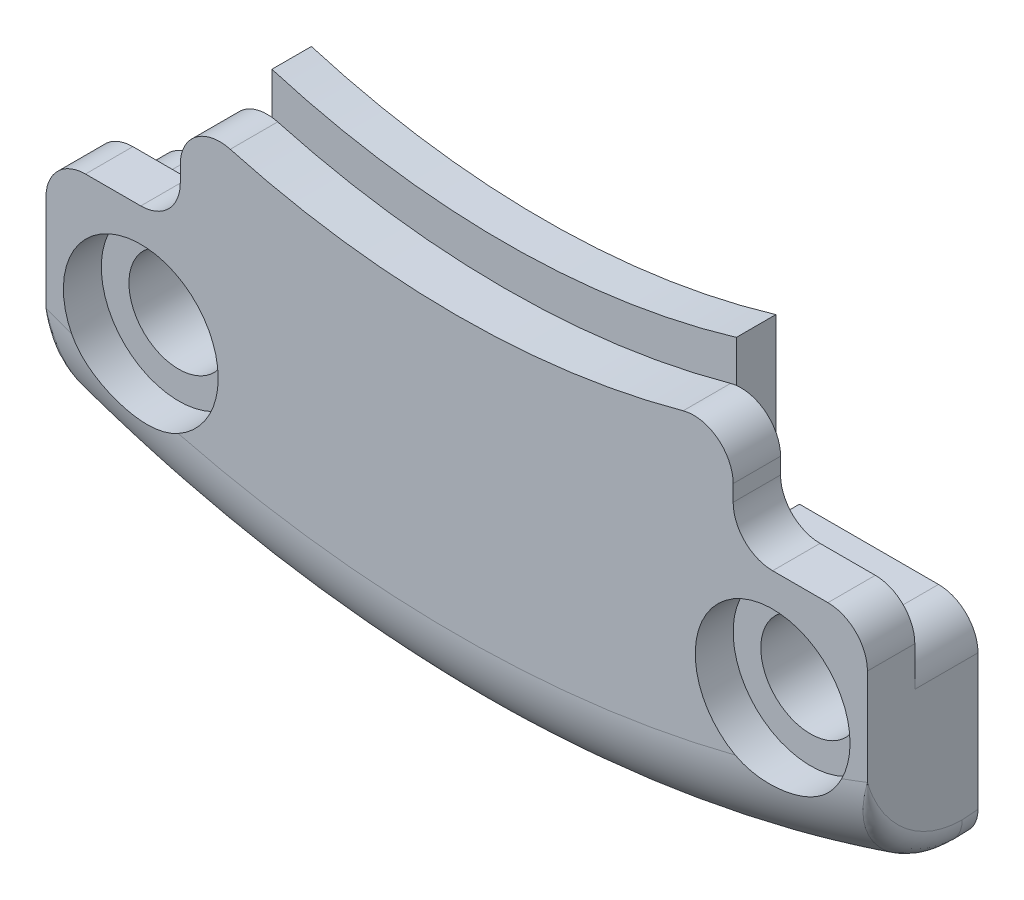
ISO-10303-21;
HEADER;
FILE_DESCRIPTION(('STEP AP214'),'2;1');
FILE_NAME('part.step','',(''),(''),'','','');
FILE_SCHEMA(('AUTOMOTIVE_DESIGN { 1 0 10303 214 1 1 1 1 }'));
ENDSEC;
DATA;
#1=APPLICATION_CONTEXT('core data for automotive mechanical design processes');
#2=APPLICATION_PROTOCOL_DEFINITION('international standard','automotive_design',2000,#1);
#3=PRODUCT_CONTEXT('',#1,'mechanical');
#4=PRODUCT('Part','Part','',(#3));
#5=PRODUCT_RELATED_PRODUCT_CATEGORY('part','',(#4));
#6=PRODUCT_DEFINITION_FORMATION('','',#4);
#7=PRODUCT_DEFINITION_CONTEXT('part definition',#1,'design');
#8=PRODUCT_DEFINITION('design','',#6,#7);
#9=PRODUCT_DEFINITION_SHAPE('','',#8);
#10=(LENGTH_UNIT() NAMED_UNIT(*) SI_UNIT(.MILLI.,.METRE.));
#11=(NAMED_UNIT(*) PLANE_ANGLE_UNIT() SI_UNIT($,.RADIAN.));
#12=(NAMED_UNIT(*) SI_UNIT($,.STERADIAN.) SOLID_ANGLE_UNIT());
#13=UNCERTAINTY_MEASURE_WITH_UNIT(LENGTH_MEASURE(1.E-05),#10,'distance_accuracy_value','');
#14=(GEOMETRIC_REPRESENTATION_CONTEXT(3) GLOBAL_UNCERTAINTY_ASSIGNED_CONTEXT((#13)) GLOBAL_UNIT_ASSIGNED_CONTEXT((#10,
#11,#12)) REPRESENTATION_CONTEXT('',''));
#15=CARTESIAN_POINT('',(0.,0.,0.));
#16=DIRECTION('',(0.,0.,1.));
#17=DIRECTION('',(1.,0.,0.));
#18=AXIS2_PLACEMENT_3D('',#15,#16,#17);
#19=CARTESIAN_POINT('',(0.,0.,1.778));
#20=DIRECTION('',(0.,0.,-1.));
#21=DIRECTION('',(-1.,0.,0.));
#22=AXIS2_PLACEMENT_3D('',#19,#20,#21);
#23=CYLINDRICAL_SURFACE('',#22,19.685);
#24=CARTESIAN_POINT('',(0.,0.,-1.778));
#25=DIRECTION('',(0.,0.,-1.));
#26=DIRECTION('',(-1.,0.,0.));
#27=AXIS2_PLACEMENT_3D('',#24,#25,#26);
#28=CIRCLE('',#27,19.685);
#29=CARTESIAN_POINT('',(-3.53452817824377,-19.3650803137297,-1.778));
#30=VERTEX_POINT('',#29);
#31=CARTESIAN_POINT('',(-4.44499999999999,-19.1765794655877,-1.778));
#32=VERTEX_POINT('',#31);
#33=EDGE_CURVE('E422',#30,#32,#28,.T.);
#34=ORIENTED_EDGE('',*,*,#33,.F.);
#35=CARTESIAN_POINT('',(-2.99737076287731,-19.1020417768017,-2.55265955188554));
#36=CARTESIAN_POINT('',(-3.00888859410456,-19.456296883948,-2.5288648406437));
#37=CARTESIAN_POINT('',(-3.32317565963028,-19.4024670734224,-2.68545833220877));
#38=CARTESIAN_POINT('',(-3.04037387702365,-19.0933878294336,-2.46402199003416));
#39=CARTESIAN_POINT('',(-3.04959404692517,-19.4501622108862,-2.44130659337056));
#40=CARTESIAN_POINT('',(-3.37434300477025,-19.3936770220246,-2.58162575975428));
#41=CARTESIAN_POINT('',(-3.07588643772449,-19.0860817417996,-2.3716705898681));
#42=CARTESIAN_POINT('',(-3.08283180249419,-19.4450691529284,-2.35135568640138));
#43=CARTESIAN_POINT('',(-3.41659769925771,-19.3862560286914,-2.47344269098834));
#44=CARTESIAN_POINT('',(-3.13120376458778,-19.0745621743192,-2.18230304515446));
#45=CARTESIAN_POINT('',(-3.13450750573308,-19.4370763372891,-2.16754733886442));
#46=CARTESIAN_POINT('',(-3.48241713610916,-19.3745552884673,-2.25161213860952));
#47=CARTESIAN_POINT('',(-3.15101797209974,-19.0703468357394,-2.08528974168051));
#48=CARTESIAN_POINT('',(-3.15280706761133,-19.4341975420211,-2.07392124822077));
#49=CARTESIAN_POINT('',(-3.50599311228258,-19.3702736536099,-2.13796798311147));
#50=CARTESIAN_POINT('',(-3.17427402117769,-19.0653924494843,-1.88917518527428));
#51=CARTESIAN_POINT('',(-3.17434476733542,-19.4308063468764,-1.88484069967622));
#52=CARTESIAN_POINT('',(-3.53366437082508,-19.3652413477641,-1.90823378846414));
#53=CARTESIAN_POINT('',(-3.17770367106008,-19.0646559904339,-1.79007243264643));
#54=CARTESIAN_POINT('',(-3.17750293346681,-19.4303065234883,-1.78968308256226));
#55=CARTESIAN_POINT('',(-3.53774514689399,-19.3644933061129,-1.7921419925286));
#56=CARTESIAN_POINT('',(-3.16807615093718,-19.0667138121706,-1.59273374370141));
#57=CARTESIAN_POINT('',(-3.1685972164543,-19.4317121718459,-1.5996957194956));
#58=CARTESIAN_POINT('',(-3.52628982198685,-19.3665834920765,-1.5609738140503));
#59=CARTESIAN_POINT('',(-3.15502434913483,-19.0695069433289,-1.49449753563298));
#60=CARTESIAN_POINT('',(-3.15656710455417,-19.4336123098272,-1.50517376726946));
#61=CARTESIAN_POINT('',(-3.51076010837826,-19.3694205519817,-1.44589711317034));
#62=CARTESIAN_POINT('',(-3.11294123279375,-19.078375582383,-1.30209525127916));
#63=CARTESIAN_POINT('',(-3.11743020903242,-19.4397228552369,-1.31902596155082));
#64=CARTESIAN_POINT('',(-3.46068742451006,-19.3784286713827,-1.2205115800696));
#65=CARTESIAN_POINT('',(-3.08398263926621,-19.0844361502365,-1.20791274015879));
#66=CARTESIAN_POINT('',(-3.09050996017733,-19.4439045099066,-1.22765312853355));
#67=CARTESIAN_POINT('',(-3.42623098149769,-19.3845845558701,-1.11018349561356));
#68=CARTESIAN_POINT('',(-3.0109494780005,-19.0993597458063,-1.02559597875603));
#69=CARTESIAN_POINT('',(-3.02188909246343,-19.4543663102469,-1.04947588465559));
#70=CARTESIAN_POINT('',(-3.33933232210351,-19.3997428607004,-0.896612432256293));
#71=CARTESIAN_POINT('',(-2.96684907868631,-19.1082275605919,-0.937472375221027));
#72=CARTESIAN_POINT('',(-2.98034074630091,-19.4606239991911,-0.962856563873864));
#73=CARTESIAN_POINT('',(-3.2868593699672,-19.408750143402,-0.793381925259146));
#74=CARTESIAN_POINT('',(-2.86435781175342,-19.1281732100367,-0.769065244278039));
#75=CARTESIAN_POINT('',(-2.88270476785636,-19.4749431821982,-0.795994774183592));
#76=CARTESIAN_POINT('',(-3.16490992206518,-19.4290094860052,-0.596105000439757));
#77=CARTESIAN_POINT('',(-2.80584078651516,-19.1392703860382,-0.688860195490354));
#78=CARTESIAN_POINT('',(-2.82668494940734,-19.4829945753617,-0.715882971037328));
#79=CARTESIAN_POINT('',(-3.0952833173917,-19.4402811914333,-0.502150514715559));
#80=CARTESIAN_POINT('',(-2.67649399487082,-19.1627801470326,-0.539481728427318));
#81=CARTESIAN_POINT('',(-2.70155373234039,-19.5003476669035,-0.56550404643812));
#82=CARTESIAN_POINT('',(-2.9413797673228,-19.4641606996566,-0.327164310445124));
#83=CARTESIAN_POINT('',(-2.60568365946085,-19.1751906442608,-0.470291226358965));
#84=CARTESIAN_POINT('',(-2.63263540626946,-19.5096288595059,-0.495185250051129));
#85=CARTESIAN_POINT('',(-2.85712594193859,-19.4767663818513,-0.246112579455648));
#86=CARTESIAN_POINT('',(-2.45249125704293,-19.2006639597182,-0.343693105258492));
#87=CARTESIAN_POINT('',(-2.48221784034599,-19.528985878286,-0.365626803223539));
#88=CARTESIAN_POINT('',(-2.67484964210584,-19.5026403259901,-0.0978119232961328));
#89=CARTESIAN_POINT('',(-2.36995451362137,-19.2137336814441,-0.286473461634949));
#90=CARTESIAN_POINT('',(-2.40064589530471,-19.5390671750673,-0.306427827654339));
#91=CARTESIAN_POINT('',(-2.57664312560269,-19.5159155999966,-0.0307831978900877));
#92=CARTESIAN_POINT('',(-2.19640705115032,-19.2394821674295,-0.186691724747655));
#93=CARTESIAN_POINT('',(-2.22793535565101,-19.5592274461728,-0.202529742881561));
#94=CARTESIAN_POINT('',(-2.37014731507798,-19.5420690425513,0.0861039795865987));
#95=CARTESIAN_POINT('',(-2.10539445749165,-19.2521608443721,-0.144132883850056));
#96=CARTESIAN_POINT('',(-2.13680807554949,-19.569315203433,-0.157654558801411));
#97=CARTESIAN_POINT('',(-2.26185579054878,-19.5549471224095,0.135958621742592));
#98=CARTESIAN_POINT('',(-1.91343495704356,-19.2768655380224,-0.0734626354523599));
#99=CARTESIAN_POINT('',(-1.94372056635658,-19.5892507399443,-0.0825951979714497));
#100=CARTESIAN_POINT('',(-2.03345237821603,-19.580040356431,0.218743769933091));
#101=CARTESIAN_POINT('',(-1.81223267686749,-19.2888427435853,-0.0460229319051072));
#102=CARTESIAN_POINT('',(-1.84134246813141,-19.5990961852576,-0.052881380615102));
#103=CARTESIAN_POINT('',(-1.91303663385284,-19.592205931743,0.250887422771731));
#104=CARTESIAN_POINT('',(-1.65793721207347,-19.3053560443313,-0.0184701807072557));
#105=CARTESIAN_POINT('',(-1.68459556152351,-19.6129060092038,-0.0223999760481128));
#106=CARTESIAN_POINT('',(-1.72944785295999,-19.6089789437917,0.283163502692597));
#107=CARTESIAN_POINT('',(-1.60602981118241,-19.3106235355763,-0.0115536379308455));
#108=CARTESIAN_POINT('',(-1.63184551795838,-19.6173481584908,-0.0145797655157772));
#109=CARTESIAN_POINT('',(-1.66768572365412,-19.6143292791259,0.291265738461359));
#110=CARTESIAN_POINT('',(-1.50176404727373,-19.320619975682,-0.0023185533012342));
#111=CARTESIAN_POINT('',(-1.52578496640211,-19.6258574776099,-0.00370938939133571));
#112=CARTESIAN_POINT('',(-1.54362488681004,-19.62448293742,0.302083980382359));
#113=CARTESIAN_POINT('',(-1.44940563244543,-19.3253488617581,-5.46979342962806E-07));
#114=CARTESIAN_POINT('',(-1.47244702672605,-19.6299279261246,-0.000644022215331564));
#115=CARTESIAN_POINT('',(-1.4813261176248,-19.6292861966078,0.304799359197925));
#116=CARTESIAN_POINT('',(-1.397,-19.3297838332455,0.));
#117=CARTESIAN_POINT('',(-1.41897116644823,-19.6337909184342,0.));
#118=CARTESIAN_POINT('',(-1.41897116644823,-19.6337909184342,0.3048));
#119=(BOUNDED_SURFACE() B_SPLINE_SURFACE(3,2,((#35,#36,#37),(#38,#39,#40),(#41,#42,#43),(#44,
#45,#46),(#47,#48,#49),(#50,#51,#52),(#53,#54,#55),(#56,#57,#58),(#59,#60,#61),(#62,#63,#64),
(#65,#66,#67),(#68,#69,#70),(#71,#72,#73),(#74,#75,#76),(#77,#78,#79),(#80,#81,#82),(#83,#84,
#85),(#86,#87,#88),(#89,#90,#91),(#92,#93,#94),(#95,#96,#97),(#98,#99,#100),(#101,#102,#103),
(#104,#105,#106),(#107,#108,#109),(#110,#111,#112),(#113,#114,#115),(#116,#117,#118)),
.UNSPECIFIED.,.F.,.F.,.F.) B_SPLINE_SURFACE_WITH_KNOTS((4,2,2,2,2,2,2,2,2,2,2,2,2,4),(3,3),(0.,
0.346770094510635,0.69333147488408,1.04015069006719,1.38685697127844,1.73199125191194,
2.07771727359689,2.4265834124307,2.7749030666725,3.12833837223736,3.48185203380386,
3.85001367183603,4.03451310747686,4.2190340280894),(0.,1.),
.UNSPECIFIED.) GEOMETRIC_REPRESENTATION_ITEM() RATIONAL_B_SPLINE_SURFACE(((1.,0.651171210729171,
1.),(1.,0.648695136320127,1.),(1.,0.646581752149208,1.),(1.,0.643229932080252,1.),(1.,
0.64199097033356,1.),(1.,0.640533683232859,1.),(1.,0.640316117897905,1.),(1.,0.640922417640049,
1.),(1.,0.64174594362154,1.),(1.,0.644341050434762,1.),(1.,0.646108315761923,1.),(1.,
0.650410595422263,1.),(1.,0.652946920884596,1.),(1.,0.658565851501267,1.),(1.,0.661653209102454,
1.),(1.,0.668069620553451,1.),(1.,0.671398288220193,1.),(1.,0.678070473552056,1.),(1.,
0.681413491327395,1.),(1.,0.687801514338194,1.),(1.,0.690846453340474,1.),(1.,0.696540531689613,
1.),(1.,0.69916804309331,1.),(1.,0.702566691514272,1.),(1.,0.703610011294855,1.),(1.,
0.705504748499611,1.),(1.,0.706356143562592,1.),(1.,0.707106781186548,1.))) REPRESENTATION_ITEM('') SURFACE());
#120=CARTESIAN_POINT('',(-3.32317565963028,-19.4024670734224,-2.68545833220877));
#121=CARTESIAN_POINT('',(-3.37434300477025,-19.3936770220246,-2.58162575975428));
#122=CARTESIAN_POINT('',(-3.41659769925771,-19.3862560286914,-2.47344269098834));
#123=CARTESIAN_POINT('',(-3.48241713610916,-19.3745552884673,-2.25161213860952));
#124=CARTESIAN_POINT('',(-3.50599311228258,-19.3702736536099,-2.13796798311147));
#125=CARTESIAN_POINT('',(-3.53366437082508,-19.3652413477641,-1.90823378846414));
#126=CARTESIAN_POINT('',(-3.53774514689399,-19.3644933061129,-1.7921419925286));
#127=CARTESIAN_POINT('',(-3.52628982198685,-19.3665834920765,-1.5609738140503));
#128=CARTESIAN_POINT('',(-3.51076010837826,-19.3694205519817,-1.44589711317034));
#129=CARTESIAN_POINT('',(-3.46068742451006,-19.3784286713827,-1.2205115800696));
#130=CARTESIAN_POINT('',(-3.42623098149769,-19.3845845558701,-1.11018349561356));
#131=CARTESIAN_POINT('',(-3.33933232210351,-19.3997428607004,-0.896612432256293));
#132=CARTESIAN_POINT('',(-3.2868593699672,-19.408750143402,-0.793381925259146));
#133=CARTESIAN_POINT('',(-3.16490992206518,-19.4290094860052,-0.596105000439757));
#134=CARTESIAN_POINT('',(-3.0952833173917,-19.4402811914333,-0.502150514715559));
#135=CARTESIAN_POINT('',(-2.9413797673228,-19.4641606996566,-0.327164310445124));
#136=CARTESIAN_POINT('',(-2.85712594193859,-19.4767663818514,-0.246112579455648));
#137=CARTESIAN_POINT('',(-2.67484964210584,-19.5026403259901,-0.0978119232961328));
#138=CARTESIAN_POINT('',(-2.57664312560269,-19.5159155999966,-0.0307831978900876));
#139=CARTESIAN_POINT('',(-2.37014731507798,-19.5420690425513,0.0861039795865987));
#140=CARTESIAN_POINT('',(-2.26185579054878,-19.5549471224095,0.135958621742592));
#141=CARTESIAN_POINT('',(-2.03345237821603,-19.580040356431,0.218743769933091));
#142=CARTESIAN_POINT('',(-1.91303663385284,-19.592205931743,0.250887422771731));
#143=CARTESIAN_POINT('',(-1.72944785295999,-19.6089789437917,0.283163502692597));
#144=CARTESIAN_POINT('',(-1.66768572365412,-19.6143292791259,0.291265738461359));
#145=CARTESIAN_POINT('',(-1.54362488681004,-19.62448293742,0.302083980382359));
#146=CARTESIAN_POINT('',(-1.4813261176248,-19.6292861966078,0.304799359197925));
#147=CARTESIAN_POINT('',(-1.41897116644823,-19.6337909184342,0.3048));
#148=B_SPLINE_CURVE_WITH_KNOTS('',3,(#120,#121,#122,#123,#124,#125,#126,#127,#128,#129,#130,
#131,#132,#133,#134,#135,#136,#137,#138,#139,#140,#141,#142,#143,#144,#145,#146,#147),
.UNSPECIFIED.,.F.,.F.,(4,2,2,2,2,2,2,2,2,2,2,2,2,4),(0.,0.346770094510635,0.69333147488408,
1.04015069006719,1.38685697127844,1.73199125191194,2.07771727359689,2.4265834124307,
2.7749030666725,3.12833837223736,3.48185203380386,3.85001367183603,4.03451310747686,
4.2190340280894),.UNSPECIFIED.);
#149=CARTESIAN_POINT('',(-1.88336173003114,-19.5946975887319,0.254));
#150=VERTEX_POINT('',#149);
#151=EDGE_CURVE('E594',#30,#150,#148,.T.);
#152=ORIENTED_EDGE('',*,*,#151,.T.);
#153=CARTESIAN_POINT('',(0.,0.,0.254));
#154=DIRECTION('',(0.,0.,1.));
#155=DIRECTION('',(1.,0.,0.));
#156=AXIS2_PLACEMENT_3D('',#153,#154,#155);
#157=CIRCLE('',#156,19.685);
#158=CARTESIAN_POINT('',(-6.27524470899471,-18.6579883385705,0.254));
#159=VERTEX_POINT('',#158);
#160=EDGE_CURVE('E596',#150,#159,#157,.F.);
#161=ORIENTED_EDGE('',*,*,#160,.T.);
#162=CARTESIAN_POINT('',(-6.2574834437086,-18.663952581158,-0.0126999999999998));
#163=CARTESIAN_POINT('',(-6.2574834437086,-18.663952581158,0.03175));
#164=CARTESIAN_POINT('',(-6.26105338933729,-18.6627559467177,0.0761999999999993));
#165=CARTESIAN_POINT('',(-6.27035546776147,-18.6596326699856,0.165099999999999));
#166=CARTESIAN_POINT('',(-6.27524451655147,-18.657988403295,0.209550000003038));
#167=CARTESIAN_POINT('',(-6.2752447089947,-18.6579883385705,0.254));
#168=(BOUNDED_CURVE() B_SPLINE_CURVE(3,(#162,#163,#164,#165,#166,#167),.UNSPECIFIED.,.F.,
.F.) B_SPLINE_CURVE_WITH_KNOTS((4,2,4),(0.001524,0.00165735,0.0017907),
.UNSPECIFIED.) CURVE() GEOMETRIC_REPRESENTATION_ITEM() RATIONAL_B_SPLINE_CURVE((1.,1.,1.,1.,1.,1.)) REPRESENTATION_ITEM(''));
#169=CARTESIAN_POINT('',(-6.25757843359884,-18.6639207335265,0.));
#170=VERTEX_POINT('',#169);
#171=EDGE_CURVE('E924',#159,#170,#168,.F.);
#172=ORIENTED_EDGE('',*,*,#171,.T.);
#173=CARTESIAN_POINT('',(0.,0.,0.));
#174=DIRECTION('',(0.,0.,1.));
#175=DIRECTION('',(1.,0.,0.));
#176=AXIS2_PLACEMENT_3D('',#173,#174,#175);
#177=CIRCLE('',#176,19.685);
#178=CARTESIAN_POINT('',(-4.445,-19.1765794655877,0.));
#179=VERTEX_POINT('',#178);
#180=EDGE_CURVE('E917',#170,#179,#177,.T.);
#181=ORIENTED_EDGE('',*,*,#180,.T.);
#182=DIRECTION('',(0.,0.,1.));
#183=VECTOR('',#182,1.);
#184=CARTESIAN_POINT('',(-4.44499999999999,-19.1765794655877,-1.778));
#185=LINE('',#184,#183);
#186=EDGE_CURVE('E446',#32,#179,#185,.T.);
#187=ORIENTED_EDGE('',*,*,#186,.F.);
#188=EDGE_LOOP('',(#34,#152,#161,#172,#181,#187));
#189=FACE_BOUND('',#188,.T.);
#190=ADVANCED_FACE('F37',(#189),#23,.T.);
#191=CARTESIAN_POINT('',(0.,0.,-1.778));
#192=DIRECTION('',(0.,0.,-1.));
#193=DIRECTION('',(-1.,0.,0.));
#194=AXIS2_PLACEMENT_3D('',#191,#192,#193);
#195=PLANE('',#194);
#196=CARTESIAN_POINT('',(0.,0.,-1.778));
#197=DIRECTION('',(0.,0.,1.));
#198=DIRECTION('',(-1.,0.,0.));
#199=AXIS2_PLACEMENT_3D('',#196,#197,#198);
#200=CIRCLE('',#199,18.3272045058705);
#201=CARTESIAN_POINT('',(-4.445,-17.78,-1.778));
#202=VERTEX_POINT('',#201);
#203=CARTESIAN_POINT('',(-3.42287413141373,-18.0047315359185,-1.778));
#204=VERTEX_POINT('',#203);
#205=EDGE_CURVE('E416',#202,#204,#200,.T.);
#206=ORIENTED_EDGE('',*,*,#205,.T.);
#207=CARTESIAN_POINT('',(-3.4798,-18.3041684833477,-1.778));
#208=DIRECTION('',(0.,0.,-1.));
#209=DIRECTION('',(-1.,0.,0.));
#210=AXIS2_PLACEMENT_3D('',#207,#208,#209);
#211=CIRCLE('',#210,0.3048);
#212=CARTESIAN_POINT('',(-3.175,-18.3041684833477,-1.778));
#213=VERTEX_POINT('',#212);
#214=EDGE_CURVE('E696',#204,#213,#211,.T.);
#215=ORIENTED_EDGE('',*,*,#214,.T.);
#216=DIRECTION('',(0.,1.,0.));
#217=VECTOR('',#216,1.);
#218=CARTESIAN_POINT('',(-3.175,-19.685025,-1.778));
#219=LINE('',#218,#217);
#220=CARTESIAN_POINT('',(-3.175,-19.0652339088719,-1.778));
#221=VERTEX_POINT('',#220);
#222=EDGE_CURVE('E1077',#221,#213,#219,.T.);
#223=ORIENTED_EDGE('',*,*,#222,.F.);
#224=CARTESIAN_POINT('',(-3.4798,-19.0652339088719,-1.778));
#225=DIRECTION('',(0.,0.,-1.));
#226=DIRECTION('',(-1.,0.,0.));
#227=AXIS2_PLACEMENT_3D('',#224,#225,#226);
#228=CIRCLE('',#227,0.3048);
#229=EDGE_CURVE('E718',#221,#30,#228,.T.);
#230=ORIENTED_EDGE('',*,*,#229,.T.);
#231=ORIENTED_EDGE('',*,*,#33,.T.);
#232=DIRECTION('',(0.,1.,0.));
#233=VECTOR('',#232,1.);
#234=CARTESIAN_POINT('',(-4.445,-17.78,-1.778));
#235=LINE('',#234,#233);
#236=EDGE_CURVE('E425',#32,#202,#235,.T.);
#237=ORIENTED_EDGE('',*,*,#236,.T.);
#238=EDGE_LOOP('',(#206,#215,#223,#230,#231,#237));
#239=FACE_BOUND('',#238,.T.);
#240=ADVANCED_FACE('F1087',(#239),#195,.T.);
#241=CARTESIAN_POINT('',(0.,0.,0.));
#242=DIRECTION('',(0.,0.,1.));
#243=DIRECTION('',(1.,0.,0.));
#244=AXIS2_PLACEMENT_3D('',#241,#242,#243);
#245=PLANE('',#244);
#246=CARTESIAN_POINT('',(5.08,-16.51,0.));
#247=DIRECTION('',(0.,0.,1.));
#248=DIRECTION('',(1.,0.,0.));
#249=AXIS2_PLACEMENT_3D('',#246,#247,#248);
#250=CIRCLE('',#249,0.800099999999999);
#251=CARTESIAN_POINT('',(5.8801,-16.51,0.));
#252=VERTEX_POINT('',#251);
#253=EDGE_CURVE('E862',#252,#252,#250,.T.);
#254=ORIENTED_EDGE('',*,*,#253,.T.);
#255=EDGE_LOOP('',(#254));
#256=FACE_BOUND('',#255,.T.);
#257=CARTESIAN_POINT('',(0.,0.,0.));
#258=DIRECTION('',(0.,0.,1.));
#259=DIRECTION('',(-1.,0.,0.));
#260=AXIS2_PLACEMENT_3D('',#257,#258,#259);
#261=CIRCLE('',#260,18.3272045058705);
#262=CARTESIAN_POINT('',(3.7338,-17.9428303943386,0.));
#263=VERTEX_POINT('',#262);
#264=CARTESIAN_POINT('',(4.445,-17.78,0.));
#265=VERTEX_POINT('',#264);
#266=EDGE_CURVE('E407',#263,#265,#261,.T.);
#267=ORIENTED_EDGE('',*,*,#266,.F.);
#268=DIRECTION('',(0.,-1.,0.));
#269=VECTOR('',#268,1.);
#270=CARTESIAN_POINT('',(3.7338,-12.5367977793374,0.));
#271=LINE('',#270,#269);
#272=CARTESIAN_POINT('',(3.7338,-15.367,0.));
#273=VERTEX_POINT('',#272);
#274=EDGE_CURVE('E346',#273,#263,#271,.T.);
#275=ORIENTED_EDGE('',*,*,#274,.F.);
#276=DIRECTION('',(-1.,0.,0.));
#277=VECTOR('',#276,1.);
#278=CARTESIAN_POINT('',(6.604,-15.367,0.));
#279=LINE('',#278,#277);
#280=CARTESIAN_POINT('',(5.969,-15.367,0.));
#281=VERTEX_POINT('',#280);
#282=EDGE_CURVE('E382',#281,#273,#279,.T.);
#283=ORIENTED_EDGE('',*,*,#282,.F.);
#284=CARTESIAN_POINT('',(5.969,-16.002,0.));
#285=DIRECTION('',(0.,0.,1.));
#286=DIRECTION('',(1.,0.,0.));
#287=AXIS2_PLACEMENT_3D('',#284,#285,#286);
#288=CIRCLE('',#287,0.635);
#289=CARTESIAN_POINT('',(6.604,-16.002,0.));
#290=VERTEX_POINT('',#289);
#291=EDGE_CURVE('E1258',#281,#290,#288,.F.);
#292=ORIENTED_EDGE('',*,*,#291,.T.);
#293=DIRECTION('',(0.,1.,0.));
#294=VECTOR('',#293,1.);
#295=CARTESIAN_POINT('',(6.604,-18.5441745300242,0.));
#296=LINE('',#295,#294);
#297=CARTESIAN_POINT('',(6.604,-18.1823997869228,0.));
#298=VERTEX_POINT('',#297);
#299=EDGE_CURVE('E870',#298,#290,#296,.T.);
#300=ORIENTED_EDGE('',*,*,#299,.F.);
#301=CARTESIAN_POINT('',(6.25757843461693,-18.6639207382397,-3.41692898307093E-08));
#302=CARTESIAN_POINT('',(6.604,-18.5477736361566,1.14864462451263E-07));
#303=CARTESIAN_POINT('',(6.604,-18.1823997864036,-3.41692898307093E-08));
#304=(BOUNDED_CURVE() B_SPLINE_CURVE(2,(#301,#302,#303),.UNSPECIFIED.,.F.,
.F.) B_SPLINE_CURVE_WITH_KNOTS((3,3),(0.,1.),
.UNSPECIFIED.) CURVE() GEOMETRIC_REPRESENTATION_ITEM() RATIONAL_B_SPLINE_CURVE((1.,
0.811752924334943,1.)) REPRESENTATION_ITEM(''));
#305=CARTESIAN_POINT('',(6.25757843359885,-18.6639207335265,0.));
#306=VERTEX_POINT('',#305);
#307=EDGE_CURVE('E1181',#298,#306,#304,.F.);
#308=ORIENTED_EDGE('',*,*,#307,.T.);
#309=CARTESIAN_POINT('',(4.445,-19.1765794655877,0.));
#310=VERTEX_POINT('',#309);
#311=EDGE_CURVE('E439',#310,#306,#177,.T.);
#312=ORIENTED_EDGE('',*,*,#311,.F.);
#313=DIRECTION('',(0.,-1.,0.));
#314=VECTOR('',#313,1.);
#315=CARTESIAN_POINT('',(4.445,-17.78,0.));
#316=LINE('',#315,#314);
#317=EDGE_CURVE('E430',#265,#310,#316,.T.);
#318=ORIENTED_EDGE('',*,*,#317,.F.);
#319=EDGE_LOOP('',(#267,#275,#283,#292,#300,#308,#312,#318));
#320=FACE_BOUND('',#319,.T.);
#321=ADVANCED_FACE('F520',(#256,#320),#245,.F.);
#322=CARTESIAN_POINT('',(-3.7338,-13.9882529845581,9.49378355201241));
#323=DIRECTION('',(-1.,0.,0.));
#324=DIRECTION('',(0.,0.,1.));
#325=AXIS2_PLACEMENT_3D('',#322,#323,#324);
#326=PLANE('',#325);
#327=DIRECTION('',(0.,0.,-1.));
#328=VECTOR('',#327,1.);
#329=CARTESIAN_POINT('',(-3.73379999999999,-12.5367977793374,9.49378355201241));
#330=LINE('',#329,#328);
#331=CARTESIAN_POINT('',(-3.73379999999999,-12.5367977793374,1.016));
#332=VERTEX_POINT('',#331);
#333=CARTESIAN_POINT('',(-3.7338,-12.5367977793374,0.381));
#334=VERTEX_POINT('',#333);
#335=EDGE_CURVE('E403',#332,#334,#330,.T.);
#336=ORIENTED_EDGE('',*,*,#335,.T.);
#337=DIRECTION('',(0.,1.,0.));
#338=VECTOR('',#337,1.);
#339=CARTESIAN_POINT('',(-3.7338,-12.5367977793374,0.381));
#340=LINE('',#339,#338);
#341=CARTESIAN_POINT('',(-3.7338,-15.367,0.381));
#342=VERTEX_POINT('',#341);
#343=EDGE_CURVE('E355',#342,#334,#340,.T.);
#344=ORIENTED_EDGE('',*,*,#343,.F.);
#345=DIRECTION('',(0.,0.,-1.));
#346=VECTOR('',#345,1.);
#347=CARTESIAN_POINT('',(-3.7338,-15.367,1.016));
#348=LINE('',#347,#346);
#349=CARTESIAN_POINT('',(-3.7338,-15.367,1.016));
#350=VERTEX_POINT('',#349);
#351=EDGE_CURVE('E379',#350,#342,#348,.T.);
#352=ORIENTED_EDGE('',*,*,#351,.F.);
#353=DIRECTION('',(0.,-1.,0.));
#354=VECTOR('',#353,1.);
#355=CARTESIAN_POINT('',(-3.7338,-15.367,1.016));
#356=LINE('',#355,#354);
#357=CARTESIAN_POINT('',(-3.7338,-13.2055959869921,1.016));
#358=VERTEX_POINT('',#357);
#359=EDGE_CURVE('E371',#358,#350,#356,.T.);
#360=ORIENTED_EDGE('',*,*,#359,.F.);
#361=DIRECTION('',(0.,1.,0.));
#362=VECTOR('',#361,1.);
#363=CARTESIAN_POINT('',(-3.7338,-13.9882529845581,1.016));
#364=LINE('',#363,#362);
#365=EDGE_CURVE('E401',#358,#332,#364,.T.);
#366=ORIENTED_EDGE('',*,*,#365,.T.);
#367=EDGE_LOOP('',(#336,#344,#352,#360,#366));
#368=FACE_BOUND('',#367,.T.);
#369=ADVANCED_FACE('F1100',(#368),#326,.T.);
#370=CARTESIAN_POINT('',(3.7338,-13.9882529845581,9.49378355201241));
#371=DIRECTION('',(1.,0.,0.));
#372=DIRECTION('',(0.,0.,-1.));
#373=AXIS2_PLACEMENT_3D('',#370,#371,#372);
#374=PLANE('',#373);
#375=DIRECTION('',(0.,0.,-1.));
#376=VECTOR('',#375,1.);
#377=CARTESIAN_POINT('',(3.7338,-15.367,1.016));
#378=LINE('',#377,#376);
#379=CARTESIAN_POINT('',(3.7338,-15.367,1.016));
#380=VERTEX_POINT('',#379);
#381=CARTESIAN_POINT('',(3.7338,-15.367,0.381));
#382=VERTEX_POINT('',#381);
#383=EDGE_CURVE('E397',#380,#382,#378,.T.);
#384=ORIENTED_EDGE('',*,*,#383,.T.);
#385=DIRECTION('',(0.,-1.,0.));
#386=VECTOR('',#385,1.);
#387=CARTESIAN_POINT('',(3.7338,-12.5367977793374,0.381));
#388=LINE('',#387,#386);
#389=CARTESIAN_POINT('',(3.7338,-12.5367977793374,0.381));
#390=VERTEX_POINT('',#389);
#391=EDGE_CURVE('E337',#390,#382,#388,.T.);
#392=ORIENTED_EDGE('',*,*,#391,.F.);
#393=DIRECTION('',(0.,0.,-1.));
#394=VECTOR('',#393,1.);
#395=CARTESIAN_POINT('',(3.7338,-12.5367977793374,9.49378355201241));
#396=LINE('',#395,#394);
#397=CARTESIAN_POINT('',(3.7338,-12.5367977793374,1.016));
#398=VERTEX_POINT('',#397);
#399=EDGE_CURVE('E408',#398,#390,#396,.T.);
#400=ORIENTED_EDGE('',*,*,#399,.F.);
#401=DIRECTION('',(0.,-1.,0.));
#402=VECTOR('',#401,1.);
#403=CARTESIAN_POINT('',(3.7338,-13.9882529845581,1.016));
#404=LINE('',#403,#402);
#405=CARTESIAN_POINT('',(3.7338,-13.2055959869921,1.016));
#406=VERTEX_POINT('',#405);
#407=EDGE_CURVE('E405',#398,#406,#404,.T.);
#408=ORIENTED_EDGE('',*,*,#407,.T.);
#409=DIRECTION('',(0.,1.,0.));
#410=VECTOR('',#409,1.);
#411=CARTESIAN_POINT('',(3.7338,-13.1980071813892,1.016));
#412=LINE('',#411,#410);
#413=EDGE_CURVE('E385',#380,#406,#412,.T.);
#414=ORIENTED_EDGE('',*,*,#413,.F.);
#415=EDGE_LOOP('',(#384,#392,#400,#408,#414));
#416=FACE_BOUND('',#415,.T.);
#417=ADVANCED_FACE('F1136',(#416),#374,.T.);
#418=CARTESIAN_POINT('',(0.,0.,9.49378355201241));
#419=DIRECTION('',(0.,0.,-1.));
#420=DIRECTION('',(-1.,0.,0.));
#421=AXIS2_PLACEMENT_3D('',#418,#419,#420);
#422=CYLINDRICAL_SURFACE('',#421,13.081);
#423=ORIENTED_EDGE('',*,*,#399,.T.);
#424=CARTESIAN_POINT('',(0.,0.,0.380999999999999));
#425=DIRECTION('',(0.,0.,-1.));
#426=DIRECTION('',(-1.,0.,0.));
#427=AXIS2_PLACEMENT_3D('',#424,#425,#426);
#428=CIRCLE('',#427,13.081);
#429=EDGE_CURVE('E1073',#390,#334,#428,.T.);
#430=ORIENTED_EDGE('',*,*,#429,.T.);
#431=ORIENTED_EDGE('',*,*,#335,.F.);
#432=CARTESIAN_POINT('',(0.,0.,1.016));
#433=DIRECTION('',(0.,0.,1.));
#434=DIRECTION('',(1.,0.,0.));
#435=AXIS2_PLACEMENT_3D('',#432,#433,#434);
#436=CIRCLE('',#435,13.081);
#437=EDGE_CURVE('E409',#332,#398,#436,.T.);
#438=ORIENTED_EDGE('',*,*,#437,.T.);
#439=EDGE_LOOP('',(#423,#430,#431,#438));
#440=FACE_BOUND('',#439,.T.);
#441=ADVANCED_FACE('F1132',(#440),#422,.F.);
#442=CARTESIAN_POINT('',(0.,0.,1.778));
#443=DIRECTION('',(0.,0.,-1.));
#444=DIRECTION('',(-1.,0.,0.));
#445=AXIS2_PLACEMENT_3D('',#442,#443,#444);
#446=CYLINDRICAL_SURFACE('',#445,13.716);
#447=CARTESIAN_POINT('',(0.,0.,1.778));
#448=DIRECTION('',(0.,0.,-1.));
#449=DIRECTION('',(1.,0.,0.));
#450=AXIS2_PLACEMENT_3D('',#447,#448,#449);
#451=CIRCLE('',#450,13.716);
#452=CARTESIAN_POINT('',(3.64141592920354,-13.2237946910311,1.778));
#453=VERTEX_POINT('',#452);
#454=CARTESIAN_POINT('',(-3.64141592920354,-13.2237946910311,1.778));
#455=VERTEX_POINT('',#454);
#456=EDGE_CURVE('E866',#453,#455,#451,.T.);
#457=ORIENTED_EDGE('',*,*,#456,.F.);
#458=DIRECTION('',(0.,0.,-1.));
#459=VECTOR('',#458,1.);
#460=CARTESIAN_POINT('',(3.64141592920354,-13.2237946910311,1.778));
#461=LINE('',#460,#459);
#462=CARTESIAN_POINT('',(3.64141592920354,-13.2237946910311,1.016));
#463=VERTEX_POINT('',#462);
#464=EDGE_CURVE('E1038',#453,#463,#461,.T.);
#465=ORIENTED_EDGE('',*,*,#464,.T.);
#466=CARTESIAN_POINT('',(0.,0.,1.016));
#467=DIRECTION('',(0.,0.,1.));
#468=DIRECTION('',(1.,0.,0.));
#469=AXIS2_PLACEMENT_3D('',#466,#467,#468);
#470=CIRCLE('',#469,13.716);
#471=CARTESIAN_POINT('',(-3.64141592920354,-13.2237946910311,1.016));
#472=VERTEX_POINT('',#471);
#473=EDGE_CURVE('E457',#463,#472,#470,.F.);
#474=ORIENTED_EDGE('',*,*,#473,.T.);
#475=DIRECTION('',(0.,0.,-1.));
#476=VECTOR('',#475,1.);
#477=CARTESIAN_POINT('',(-3.64141592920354,-13.2237946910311,1.778));
#478=LINE('',#477,#476);
#479=EDGE_CURVE('E1036',#472,#455,#478,.F.);
#480=ORIENTED_EDGE('',*,*,#479,.T.);
#481=EDGE_LOOP('',(#457,#465,#474,#480));
#482=FACE_BOUND('',#481,.T.);
#483=ADVANCED_FACE('F1616',(#482),#446,.F.);
#484=CARTESIAN_POINT('',(-4.445,-12.9757709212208,1.778));
#485=DIRECTION('',(1.,0.,0.));
#486=DIRECTION('',(0.,0.,-1.));
#487=AXIS2_PLACEMENT_3D('',#484,#485,#486);
#488=PLANE('',#487);
#489=DIRECTION('',(0.,-1.,0.));
#490=VECTOR('',#489,1.);
#491=CARTESIAN_POINT('',(-4.445,-12.9757709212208,1.778));
#492=LINE('',#491,#490);
#493=CARTESIAN_POINT('',(-4.445,-13.8360074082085,1.778));
#494=VERTEX_POINT('',#493);
#495=CARTESIAN_POINT('',(-4.445,-14.097,1.778));
#496=VERTEX_POINT('',#495);
#497=EDGE_CURVE('E869',#494,#496,#492,.T.);
#498=ORIENTED_EDGE('',*,*,#497,.F.);
#499=DIRECTION('',(0.,0.,-1.));
#500=VECTOR('',#499,1.);
#501=CARTESIAN_POINT('',(-4.445,-13.8360074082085,1.778));
#502=LINE('',#501,#500);
#503=CARTESIAN_POINT('',(-4.445,-13.8360074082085,1.016));
#504=VERTEX_POINT('',#503);
#505=EDGE_CURVE('E1043',#494,#504,#502,.T.);
#506=ORIENTED_EDGE('',*,*,#505,.T.);
#507=DIRECTION('',(0.,1.,0.));
#508=VECTOR('',#507,1.);
#509=CARTESIAN_POINT('',(-4.445,-14.732,1.016));
#510=LINE('',#509,#508);
#511=CARTESIAN_POINT('',(-4.445,-14.097,1.016));
#512=VERTEX_POINT('',#511);
#513=EDGE_CURVE('E368',#512,#504,#510,.T.);
#514=ORIENTED_EDGE('',*,*,#513,.F.);
#515=DIRECTION('',(0.,0.,-1.));
#516=VECTOR('',#515,1.);
#517=CARTESIAN_POINT('',(-4.445,-14.097,1.778));
#518=LINE('',#517,#516);
#519=EDGE_CURVE('E1041',#512,#496,#518,.F.);
#520=ORIENTED_EDGE('',*,*,#519,.T.);
#521=EDGE_LOOP('',(#498,#506,#514,#520));
#522=FACE_BOUND('',#521,.T.);
#523=ADVANCED_FACE('F1608',(#522),#488,.F.);
#524=CARTESIAN_POINT('',(-4.445,-14.732,1.778));
#525=DIRECTION('',(0.,-1.,0.));
#526=DIRECTION('',(0.,0.,-1.));
#527=AXIS2_PLACEMENT_3D('',#524,#525,#526);
#528=PLANE('',#527);
#529=DIRECTION('',(-1.,0.,0.));
#530=VECTOR('',#529,1.);
#531=CARTESIAN_POINT('',(-4.445,-14.732,1.778));
#532=LINE('',#531,#530);
#533=CARTESIAN_POINT('',(-5.08,-14.732,1.778));
#534=VERTEX_POINT('',#533);
#535=CARTESIAN_POINT('',(-5.969,-14.732,1.778));
#536=VERTEX_POINT('',#535);
#537=EDGE_CURVE('E873',#534,#536,#532,.T.);
#538=ORIENTED_EDGE('',*,*,#537,.F.);
#539=DIRECTION('',(0.,0.,-1.));
#540=VECTOR('',#539,1.);
#541=CARTESIAN_POINT('',(-5.08,-14.732,1.016));
#542=LINE('',#541,#540);
#543=CARTESIAN_POINT('',(-5.08,-14.732,1.016));
#544=VERTEX_POINT('',#543);
#545=EDGE_CURVE('E1053',#534,#544,#542,.T.);
#546=ORIENTED_EDGE('',*,*,#545,.T.);
#547=DIRECTION('',(1.,0.,0.));
#548=VECTOR('',#547,1.);
#549=CARTESIAN_POINT('',(-6.604,-14.732,1.016));
#550=LINE('',#549,#548);
#551=CARTESIAN_POINT('',(-5.969,-14.732,1.016));
#552=VERTEX_POINT('',#551);
#553=EDGE_CURVE('E365',#552,#544,#550,.T.);
#554=ORIENTED_EDGE('',*,*,#553,.F.);
#555=DIRECTION('',(0.,0.,-1.));
#556=VECTOR('',#555,1.);
#557=CARTESIAN_POINT('',(-5.969,-14.732,1.778));
#558=LINE('',#557,#556);
#559=EDGE_CURVE('E1051',#552,#536,#558,.F.);
#560=ORIENTED_EDGE('',*,*,#559,.T.);
#561=EDGE_LOOP('',(#538,#546,#554,#560));
#562=FACE_BOUND('',#561,.T.);
#563=ADVANCED_FACE('F1599',(#562),#528,.F.);
#564=CARTESIAN_POINT('',(4.445,-14.732,1.778));
#565=DIRECTION('',(0.,-1.,0.));
#566=DIRECTION('',(0.,0.,-1.));
#567=AXIS2_PLACEMENT_3D('',#564,#565,#566);
#568=PLANE('',#567);
#569=DIRECTION('',(-1.,0.,0.));
#570=VECTOR('',#569,1.);
#571=CARTESIAN_POINT('',(4.445,-14.732,1.778));
#572=LINE('',#571,#570);
#573=CARTESIAN_POINT('',(5.969,-14.732,1.778));
#574=VERTEX_POINT('',#573);
#575=CARTESIAN_POINT('',(5.08,-14.732,1.778));
#576=VERTEX_POINT('',#575);
#577=EDGE_CURVE('E877',#574,#576,#572,.T.);
#578=ORIENTED_EDGE('',*,*,#577,.F.);
#579=DIRECTION('',(0.,0.,-1.));
#580=VECTOR('',#579,1.);
#581=CARTESIAN_POINT('',(5.969,-14.732,1.778));
#582=LINE('',#581,#580);
#583=CARTESIAN_POINT('',(5.969,-14.732,1.016));
#584=VERTEX_POINT('',#583);
#585=EDGE_CURVE('E1725',#574,#584,#582,.T.);
#586=ORIENTED_EDGE('',*,*,#585,.T.);
#587=DIRECTION('',(1.,0.,0.));
#588=VECTOR('',#587,1.);
#589=CARTESIAN_POINT('',(4.445,-14.732,1.016));
#590=LINE('',#589,#588);
#591=CARTESIAN_POINT('',(5.08,-14.732,1.016));
#592=VERTEX_POINT('',#591);
#593=EDGE_CURVE('E391',#592,#584,#590,.T.);
#594=ORIENTED_EDGE('',*,*,#593,.F.);
#595=DIRECTION('',(0.,0.,-1.));
#596=VECTOR('',#595,1.);
#597=CARTESIAN_POINT('',(5.08,-14.732,1.778));
#598=LINE('',#597,#596);
#599=EDGE_CURVE('E1723',#592,#576,#598,.F.);
#600=ORIENTED_EDGE('',*,*,#599,.T.);
#601=EDGE_LOOP('',(#578,#586,#594,#600));
#602=FACE_BOUND('',#601,.T.);
#603=ADVANCED_FACE('F1590',(#602),#568,.F.);
#604=CARTESIAN_POINT('',(4.445,-12.9757709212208,1.778));
#605=DIRECTION('',(-1.,0.,0.));
#606=DIRECTION('',(0.,0.,1.));
#607=AXIS2_PLACEMENT_3D('',#604,#605,#606);
#608=PLANE('',#607);
#609=DIRECTION('',(0.,1.,0.));
#610=VECTOR('',#609,1.);
#611=CARTESIAN_POINT('',(4.445,-12.9757709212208,1.778));
#612=LINE('',#611,#610);
#613=CARTESIAN_POINT('',(4.445,-14.097,1.778));
#614=VERTEX_POINT('',#613);
#615=CARTESIAN_POINT('',(4.445,-13.8360074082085,1.778));
#616=VERTEX_POINT('',#615);
#617=EDGE_CURVE('E461',#614,#616,#612,.T.);
#618=ORIENTED_EDGE('',*,*,#617,.F.);
#619=DIRECTION('',(0.,0.,-1.));
#620=VECTOR('',#619,1.);
#621=CARTESIAN_POINT('',(4.445,-14.097,1.016));
#622=LINE('',#621,#620);
#623=CARTESIAN_POINT('',(4.445,-14.097,1.016));
#624=VERTEX_POINT('',#623);
#625=EDGE_CURVE('E1033',#614,#624,#622,.T.);
#626=ORIENTED_EDGE('',*,*,#625,.T.);
#627=DIRECTION('',(0.,-1.,0.));
#628=VECTOR('',#627,1.);
#629=CARTESIAN_POINT('',(4.445,-12.9757709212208,1.016));
#630=LINE('',#629,#628);
#631=CARTESIAN_POINT('',(4.445,-13.8360074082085,1.016));
#632=VERTEX_POINT('',#631);
#633=EDGE_CURVE('E388',#632,#624,#630,.T.);
#634=ORIENTED_EDGE('',*,*,#633,.F.);
#635=DIRECTION('',(0.,0.,-1.));
#636=VECTOR('',#635,1.);
#637=CARTESIAN_POINT('',(4.445,-13.8360074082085,1.778));
#638=LINE('',#637,#636);
#639=EDGE_CURVE('E1031',#632,#616,#638,.F.);
#640=ORIENTED_EDGE('',*,*,#639,.T.);
#641=EDGE_LOOP('',(#618,#626,#634,#640));
#642=FACE_BOUND('',#641,.T.);
#643=ADVANCED_FACE('F518',(#642),#608,.F.);
#644=DIRECTION('',(-1.,0.,0.));
#645=VECTOR('',#644,1.);
#646=CARTESIAN_POINT('',(-3.7338,-15.367,0.));
#647=LINE('',#646,#645);
#648=CARTESIAN_POINT('',(-3.7338,-15.367,0.));
#649=VERTEX_POINT('',#648);
#650=CARTESIAN_POINT('',(-5.969,-15.367,0.));
#651=VERTEX_POINT('',#650);
#652=EDGE_CURVE('E363',#649,#651,#647,.T.);
#653=ORIENTED_EDGE('',*,*,#652,.F.);
#654=DIRECTION('',(0.,1.,0.));
#655=VECTOR('',#654,1.);
#656=CARTESIAN_POINT('',(-3.7338,-12.5367977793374,0.));
#657=LINE('',#656,#655);
#658=CARTESIAN_POINT('',(-3.7338,-17.9428303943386,0.));
#659=VERTEX_POINT('',#658);
#660=EDGE_CURVE('E340',#659,#649,#657,.T.);
#661=ORIENTED_EDGE('',*,*,#660,.F.);
#662=CARTESIAN_POINT('',(-4.445,-17.78,0.));
#663=VERTEX_POINT('',#662);
#664=EDGE_CURVE('E428',#663,#659,#261,.T.);
#665=ORIENTED_EDGE('',*,*,#664,.F.);
#666=DIRECTION('',(0.,1.,0.));
#667=VECTOR('',#666,1.);
#668=CARTESIAN_POINT('',(-4.445,-17.78,0.));
#669=LINE('',#668,#667);
#670=EDGE_CURVE('E438',#179,#663,#669,.T.);
#671=ORIENTED_EDGE('',*,*,#670,.F.);
#672=ORIENTED_EDGE('',*,*,#180,.F.);
#673=CARTESIAN_POINT('',(-6.604,-18.1823997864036,-3.41692898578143E-08));
#674=CARTESIAN_POINT('',(-6.604,-18.5477736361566,1.1486446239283E-07));
#675=CARTESIAN_POINT('',(-6.25757843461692,-18.6639207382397,-3.41692898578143E-08));
#676=(BOUNDED_CURVE() B_SPLINE_CURVE(2,(#673,#674,#675),.UNSPECIFIED.,.F.,
.F.) B_SPLINE_CURVE_WITH_KNOTS((3,3),(0.,1.),
.UNSPECIFIED.) CURVE() GEOMETRIC_REPRESENTATION_ITEM() RATIONAL_B_SPLINE_CURVE((1.,
0.811752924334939,1.)) REPRESENTATION_ITEM(''));
#677=CARTESIAN_POINT('',(-6.604,-18.1823997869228,0.));
#678=VERTEX_POINT('',#677);
#679=EDGE_CURVE('E934',#170,#678,#676,.F.);
#680=ORIENTED_EDGE('',*,*,#679,.T.);
#681=DIRECTION('',(0.,-1.,0.));
#682=VECTOR('',#681,1.);
#683=CARTESIAN_POINT('',(-6.604,-18.5441745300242,0.));
#684=LINE('',#683,#682);
#685=CARTESIAN_POINT('',(-6.604,-16.002,0.));
#686=VERTEX_POINT('',#685);
#687=EDGE_CURVE('E865',#686,#678,#684,.T.);
#688=ORIENTED_EDGE('',*,*,#687,.F.);
#689=CARTESIAN_POINT('',(-5.969,-16.002,0.));
#690=DIRECTION('',(0.,0.,1.));
#691=DIRECTION('',(1.,0.,0.));
#692=AXIS2_PLACEMENT_3D('',#689,#690,#691);
#693=CIRCLE('',#692,0.635);
#694=EDGE_CURVE('E1717',#686,#651,#693,.F.);
#695=ORIENTED_EDGE('',*,*,#694,.T.);
#696=EDGE_LOOP('',(#653,#661,#665,#671,#672,#680,#688,#695));
#697=FACE_BOUND('',#696,.T.);
#698=CARTESIAN_POINT('',(-5.08,-16.51,0.));
#699=DIRECTION('',(0.,0.,1.));
#700=DIRECTION('',(1.,0.,0.));
#701=AXIS2_PLACEMENT_3D('',#698,#699,#700);
#702=CIRCLE('',#701,0.800099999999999);
#703=CARTESIAN_POINT('',(-4.2799,-16.51,0.));
#704=VERTEX_POINT('',#703);
#705=EDGE_CURVE('E859',#704,#704,#702,.T.);
#706=ORIENTED_EDGE('',*,*,#705,.T.);
#707=EDGE_LOOP('',(#706));
#708=FACE_BOUND('',#707,.T.);
#709=ADVANCED_FACE('F505',(#697,#708),#245,.F.);
#710=CARTESIAN_POINT('',(-5.08,-16.51,0.));
#711=DIRECTION('',(0.,0.,1.));
#712=DIRECTION('',(1.,0.,0.));
#713=AXIS2_PLACEMENT_3D('',#710,#711,#712);
#714=CYLINDRICAL_SURFACE('',#713,0.800099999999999);
#715=ORIENTED_EDGE('',*,*,#705,.F.);
#716=EDGE_LOOP('',(#715));
#717=FACE_BOUND('',#716,.T.);
#718=CARTESIAN_POINT('',(-5.08,-16.51,1.1684));
#719=DIRECTION('',(0.,0.,1.));
#720=DIRECTION('',(1.,0.,0.));
#721=AXIS2_PLACEMENT_3D('',#718,#719,#720);
#722=CIRCLE('',#721,0.800099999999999);
#723=CARTESIAN_POINT('',(-4.2799,-16.51,1.1684));
#724=VERTEX_POINT('',#723);
#725=EDGE_CURVE('E850',#724,#724,#722,.F.);
#726=ORIENTED_EDGE('',*,*,#725,.F.);
#727=EDGE_LOOP('',(#726));
#728=FACE_BOUND('',#727,.T.);
#729=ADVANCED_FACE('F501',(#717,#728),#714,.F.);
#730=CARTESIAN_POINT('',(5.08,-16.51,0.));
#731=DIRECTION('',(0.,0.,1.));
#732=DIRECTION('',(1.,0.,0.));
#733=AXIS2_PLACEMENT_3D('',#730,#731,#732);
#734=CYLINDRICAL_SURFACE('',#733,0.800099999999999);
#735=ORIENTED_EDGE('',*,*,#253,.F.);
#736=EDGE_LOOP('',(#735));
#737=FACE_BOUND('',#736,.T.);
#738=CARTESIAN_POINT('',(5.08,-16.51,1.1684));
#739=DIRECTION('',(0.,0.,1.));
#740=DIRECTION('',(1.,0.,0.));
#741=AXIS2_PLACEMENT_3D('',#738,#739,#740);
#742=CIRCLE('',#741,0.800099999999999);
#743=CARTESIAN_POINT('',(5.8801,-16.51,1.1684));
#744=VERTEX_POINT('',#743);
#745=EDGE_CURVE('E855',#744,#744,#742,.F.);
#746=ORIENTED_EDGE('',*,*,#745,.F.);
#747=EDGE_LOOP('',(#746));
#748=FACE_BOUND('',#747,.T.);
#749=ADVANCED_FACE('F504',(#737,#748),#734,.F.);
#750=CARTESIAN_POINT('',(-6.604,-18.5441745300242,1.778));
#751=DIRECTION('',(1.,0.,0.));
#752=DIRECTION('',(0.,0.,-1.));
#753=AXIS2_PLACEMENT_3D('',#750,#751,#752);
#754=PLANE('',#753);
#755=DIRECTION('',(0.,1.,0.));
#756=VECTOR('',#755,1.);
#757=CARTESIAN_POINT('',(-6.604,-15.367,1.016));
#758=LINE('',#757,#756);
#759=CARTESIAN_POINT('',(-6.604,-15.367,1.016));
#760=VERTEX_POINT('',#759);
#761=CARTESIAN_POINT('',(-6.604,-16.002,1.016));
#762=VERTEX_POINT('',#761);
#763=EDGE_CURVE('E1738',#760,#762,#758,.F.);
#764=ORIENTED_EDGE('',*,*,#763,.T.);
#765=DIRECTION('',(0.,0.,-1.));
#766=VECTOR('',#765,1.);
#767=CARTESIAN_POINT('',(-6.604,-16.002,1.778));
#768=LINE('',#767,#766);
#769=EDGE_CURVE('E1736',#762,#686,#768,.T.);
#770=ORIENTED_EDGE('',*,*,#769,.T.);
#771=ORIENTED_EDGE('',*,*,#687,.T.);
#772=CARTESIAN_POINT('',(-6.604,-18.2005666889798,0.254));
#773=CARTESIAN_POINT('',(-6.604,-18.2005664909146,0.209550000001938));
#774=CARTESIAN_POINT('',(-6.604,-18.1955348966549,0.165099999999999));
#775=CARTESIAN_POINT('',(-6.604,-18.1859698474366,0.0761999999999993));
#776=CARTESIAN_POINT('',(-6.604,-18.1823021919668,0.03175));
#777=CARTESIAN_POINT('',(-6.604,-18.1823021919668,-0.0126999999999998));
#778=(BOUNDED_CURVE() B_SPLINE_CURVE(3,(#772,#773,#774,#775,#776,#777),.UNSPECIFIED.,.F.,
.F.) B_SPLINE_CURVE_WITH_KNOTS((4,2,4),(0.001524,0.00165735,0.0017907),
.UNSPECIFIED.) CURVE() GEOMETRIC_REPRESENTATION_ITEM() RATIONAL_B_SPLINE_CURVE((1.,1.,1.,1.,1.,1.)) REPRESENTATION_ITEM(''));
#779=CARTESIAN_POINT('',(-6.604,-18.2005666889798,0.254));
#780=VERTEX_POINT('',#779);
#781=EDGE_CURVE('E942',#678,#780,#778,.F.);
#782=ORIENTED_EDGE('',*,*,#781,.T.);
#783=CARTESIAN_POINT('',(-6.604,-16.9177157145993,1.778));
#784=CARTESIAN_POINT('',(-6.604,-17.1240325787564,1.71813210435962));
#785=CARTESIAN_POINT('',(-6.604,-17.3103400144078,1.62875350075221));
#786=CARTESIAN_POINT('',(-6.604,-17.6292251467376,1.41558947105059));
#787=CARTESIAN_POINT('',(-6.604,-17.7650771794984,1.29027830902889));
#788=CARTESIAN_POINT('',(-6.604,-17.9815220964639,1.01946460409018));
#789=CARTESIAN_POINT('',(-6.604,-18.064304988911,0.872132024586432));
#790=CARTESIAN_POINT('',(-6.604,-18.1735352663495,0.568413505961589));
#791=CARTESIAN_POINT('',(-6.604,-18.2005666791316,0.410412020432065));
#792=CARTESIAN_POINT('',(-6.604,-18.2005666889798,0.254));
#793=(BOUNDED_CURVE() B_SPLINE_CURVE(3,(#783,#784,#785,#786,#787,#788,#789,#790,#791,#792),
.UNSPECIFIED.,.F.,.F.) B_SPLINE_CURVE_WITH_KNOTS((4,2,2,2,4),(0.,0.000615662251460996,
0.00123132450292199,0.00184698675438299,0.00246264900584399),
.UNSPECIFIED.) CURVE() GEOMETRIC_REPRESENTATION_ITEM() RATIONAL_B_SPLINE_CURVE((1.,1.,1.,1.,1.,
1.,1.,1.,1.,1.)) REPRESENTATION_ITEM(''));
#794=CARTESIAN_POINT('',(-6.604,-16.9177157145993,1.778));
#795=VERTEX_POINT('',#794);
#796=EDGE_CURVE('E1001',#780,#795,#793,.F.);
#797=ORIENTED_EDGE('',*,*,#796,.T.);
#798=DIRECTION('',(0.,-1.,0.));
#799=VECTOR('',#798,1.);
#800=CARTESIAN_POINT('',(-6.604,-18.5441745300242,1.778));
#801=LINE('',#800,#799);
#802=CARTESIAN_POINT('',(-6.604,-15.367,1.778));
#803=VERTEX_POINT('',#802);
#804=EDGE_CURVE('E876',#803,#795,#801,.T.);
#805=ORIENTED_EDGE('',*,*,#804,.F.);
#806=DIRECTION('',(0.,0.,-1.));
#807=VECTOR('',#806,1.);
#808=CARTESIAN_POINT('',(-6.604,-15.367,1.778));
#809=LINE('',#808,#807);
#810=EDGE_CURVE('E895',#803,#760,#809,.T.);
#811=ORIENTED_EDGE('',*,*,#810,.T.);
#812=EDGE_LOOP('',(#764,#770,#771,#782,#797,#805,#811));
#813=FACE_BOUND('',#812,.T.);
#814=ADVANCED_FACE('F509',(#813),#754,.F.);
#815=CARTESIAN_POINT('',(6.27524470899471,-18.6579883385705,0.254));
#816=VERTEX_POINT('',#815);
#817=CARTESIAN_POINT('',(1.88336173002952,-19.594697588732,0.254));
#818=VERTEX_POINT('',#817);
#819=EDGE_CURVE('E1150',#816,#818,#157,.F.);
#820=ORIENTED_EDGE('',*,*,#819,.T.);
#821=CARTESIAN_POINT('',(1.397,-19.3297838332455,0.));
#822=CARTESIAN_POINT('',(1.41897116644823,-19.6337909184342,0.));
#823=CARTESIAN_POINT('',(1.41897116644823,-19.6337909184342,0.3048));
#824=CARTESIAN_POINT('',(1.49741057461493,-19.3213240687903,8.25051404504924E-05));
#825=CARTESIAN_POINT('',(1.52160975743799,-19.62640769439,-0.00109356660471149));
#826=CARTESIAN_POINT('',(1.53844489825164,-19.6251981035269,0.304896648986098));
#827=CARTESIAN_POINT('',(1.59770900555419,-19.3117135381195,-0.00850025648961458));
#828=CARTESIAN_POINT('',(1.62371970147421,-19.6182079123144,-0.0113555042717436));
#829=CARTESIAN_POINT('',(1.65778519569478,-19.6154364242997,0.294842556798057));
#830=CARTESIAN_POINT('',(1.79522861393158,-19.2907384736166,-0.0423021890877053));
#831=CARTESIAN_POINT('',(1.8240720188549,-19.6006706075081,-0.0488298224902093));
#832=CARTESIAN_POINT('',(1.89280431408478,-19.5941314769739,0.2552460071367));
#833=CARTESIAN_POINT('',(1.89245271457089,-19.2793756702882,-0.0675050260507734));
#834=CARTESIAN_POINT('',(1.92248432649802,-19.5913105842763,-0.0761652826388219));
#835=CARTESIAN_POINT('',(2.00848661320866,-19.5825899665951,0.225722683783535));
#836=CARTESIAN_POINT('',(2.08120056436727,-19.2554220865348,-0.133863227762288));
#837=CARTESIAN_POINT('',(2.1125331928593,-19.5719255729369,-0.146796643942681));
#838=CARTESIAN_POINT('',(2.23306863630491,-19.5582596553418,0.147988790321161));
#839=CARTESIAN_POINT('',(2.17272297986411,-19.2428310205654,-0.175022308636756));
#840=CARTESIAN_POINT('',(2.20426010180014,-19.5618802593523,-0.190277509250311));
#841=CARTESIAN_POINT('',(2.34196677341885,-19.5454705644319,0.0997738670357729));
#842=CARTESIAN_POINT('',(2.34751825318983,-19.217188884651,-0.272082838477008));
#843=CARTESIAN_POINT('',(2.37839688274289,-19.5417500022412,-0.291505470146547));
#844=CARTESIAN_POINT('',(2.54994729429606,-19.5194251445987,-0.0139256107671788));
#845=CARTESIAN_POINT('',(2.43079183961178,-19.2041378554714,-0.327982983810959));
#846=CARTESIAN_POINT('',(2.46080242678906,-19.5316552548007,-0.349431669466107));
#847=CARTESIAN_POINT('',(2.64903054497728,-19.5061688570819,-0.0794086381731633));
#848=CARTESIAN_POINT('',(2.58716182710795,-19.1783740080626,-0.453279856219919));
#849=CARTESIAN_POINT('',(2.61455171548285,-19.5120234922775,-0.477863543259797));
#850=CARTESIAN_POINT('',(2.8350877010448,-19.4799998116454,-0.226184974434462));
#851=CARTESIAN_POINT('',(2.6602100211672,-19.1656630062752,-0.522737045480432));
#852=CARTESIAN_POINT('',(2.68573799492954,-19.5024940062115,-0.54855876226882));
#853=CARTESIAN_POINT('',(2.92200424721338,-19.467088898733,-0.307549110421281));
#854=CARTESIAN_POINT('',(2.79372416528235,-19.1415350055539,-0.673202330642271));
#855=CARTESIAN_POINT('',(2.81504601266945,-19.4846471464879,-0.700212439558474));
#856=CARTESIAN_POINT('',(3.08086633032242,-19.442581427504,-0.483808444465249));
#857=CARTESIAN_POINT('',(2.85416883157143,-19.1301202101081,-0.754229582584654));
#858=CARTESIAN_POINT('',(2.8729669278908,-19.4763505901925,-0.781234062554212));
#859=CARTESIAN_POINT('',(3.1527865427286,-19.4309871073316,-0.578726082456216));
#860=CARTESIAN_POINT('',(2.96039535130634,-19.1095141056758,-0.925250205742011));
#861=CARTESIAN_POINT('',(2.97424697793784,-19.4615355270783,-0.950829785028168));
#862=CARTESIAN_POINT('',(3.27918038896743,-19.4100569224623,-0.779064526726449));
#863=CARTESIAN_POINT('',(3.00621888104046,-19.100316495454,-1.01521711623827));
#864=CARTESIAN_POINT('',(3.0174384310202,-19.4550394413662,-1.03931425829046));
#865=CARTESIAN_POINT('',(3.33370361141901,-19.4007146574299,-0.884454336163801));
#866=CARTESIAN_POINT('',(3.08197670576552,-19.0848551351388,-1.20159974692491));
#867=CARTESIAN_POINT('',(3.08864715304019,-19.4441934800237,-1.2215336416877));
#868=CARTESIAN_POINT('',(3.42384421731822,-19.3850101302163,-1.10278827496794));
#869=CARTESIAN_POINT('',(3.11193951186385,-19.0785861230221,-1.29800354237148));
#870=CARTESIAN_POINT('',(3.11650014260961,-19.4398677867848,-1.31507240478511));
#871=CARTESIAN_POINT('',(3.45949552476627,-19.3786425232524,-1.21571843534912));
#872=CARTESIAN_POINT('',(3.15487208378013,-19.0695395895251,-1.49332833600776));
#873=CARTESIAN_POINT('',(3.15642724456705,-19.4336344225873,-1.50405079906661));
#874=CARTESIAN_POINT('',(3.51057893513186,-19.3694537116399,-1.44452747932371));
#875=CARTESIAN_POINT('',(3.16805657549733,-19.0667179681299,-1.59220066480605));
#876=CARTESIAN_POINT('',(3.16857902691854,-19.4317150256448,-1.59918305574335));
#877=CARTESIAN_POINT('',(3.52626653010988,-19.3665877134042,-1.56034935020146));
#878=CARTESIAN_POINT('',(3.17773356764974,-19.0646496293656,-1.7908173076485));
#879=CARTESIAN_POINT('',(3.17753071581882,-19.4303021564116,-1.79040069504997));
#880=CARTESIAN_POINT('',(3.5377807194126,-19.3644868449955,-1.79301456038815));
#881=CARTESIAN_POINT('',(3.17422180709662,-19.0654038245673,-1.89056183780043));
#882=CARTESIAN_POINT('',(3.17429734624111,-19.4308139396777,-1.88617219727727));
#883=CARTESIAN_POINT('',(3.53360224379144,-19.3652529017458,-1.90985815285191));
#884=CARTESIAN_POINT('',(3.15070813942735,-19.0704125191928,-2.08694880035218));
#885=CARTESIAN_POINT('',(3.15251956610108,-19.4342426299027,-2.07552305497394));
#886=CARTESIAN_POINT('',(3.50562445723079,-19.3703403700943,-2.13991145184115));
#887=CARTESIAN_POINT('',(3.13087944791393,-19.0746302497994,-2.18361278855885));
#888=CARTESIAN_POINT('',(3.13420502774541,-19.4371234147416,-2.16881687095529));
#889=CARTESIAN_POINT('',(3.48203124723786,-19.374624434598,-2.25314640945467));
#890=CARTESIAN_POINT('',(3.07564271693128,-19.0861320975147,-2.37230149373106));
#891=CARTESIAN_POINT('',(3.08260367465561,-19.4451042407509,-2.3519730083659));
#892=CARTESIAN_POINT('',(3.41630770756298,-19.3863071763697,-2.47418174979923));
#893=CARTESIAN_POINT('',(3.04022577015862,-19.0934179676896,-2.46432352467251));
#894=CARTESIAN_POINT('',(3.04945448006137,-19.4501834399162,-2.44160668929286));
#895=CARTESIAN_POINT('',(3.37416677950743,-19.3937076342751,-2.58197898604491));
#896=CARTESIAN_POINT('',(2.99737076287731,-19.1020417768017,-2.55265955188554));
#897=CARTESIAN_POINT('',(3.00888859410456,-19.456296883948,-2.5288648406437));
#898=CARTESIAN_POINT('',(3.32317565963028,-19.4024670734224,-2.68545833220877));
#899=(BOUNDED_SURFACE() B_SPLINE_SURFACE(3,2,((#821,#822,#823),(#824,#825,#826),(#827,#828,
#829),(#830,#831,#832),(#833,#834,#835),(#836,#837,#838),(#839,#840,#841),(#842,#843,#844),
(#845,#846,#847),(#848,#849,#850),(#851,#852,#853),(#854,#855,#856),(#857,#858,#859),(#860,#861,
#862),(#863,#864,#865),(#866,#867,#868),(#869,#870,#871),(#872,#873,#874),(#875,#876,#877),
(#878,#879,#880),(#881,#882,#883),(#884,#885,#886),(#887,#888,#889),(#890,#891,#892),(#893,#894,
#895),(#896,#897,#898)),.UNSPECIFIED.,.F.,.F.,.F.) B_SPLINE_SURFACE_WITH_KNOTS((4,2,2,2,2,2,2,2,
2,2,2,2,4),(3,3),(0.,0.353279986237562,0.706213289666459,1.0592288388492,1.41221317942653,
1.76680930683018,2.12199948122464,2.47616797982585,2.82969764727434,3.17865584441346,
3.52770310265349,3.87309206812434,4.21867864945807),(0.,1.),
.UNSPECIFIED.) GEOMETRIC_REPRESENTATION_ITEM() RATIONAL_B_SPLINE_SURFACE(((1.,0.707106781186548,
1.),(1.,0.705681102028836,1.),(1.,0.703862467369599,1.),(1.,0.699569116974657,1.),(1.,
0.697095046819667,1.),(1.,0.691616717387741,1.),(1.,0.688612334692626,1.),(1.,0.682286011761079,
1.),(1.,0.67896409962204,1.),(1.,0.672244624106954,1.),(1.,0.668846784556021,1.),(1.,
0.662279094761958,1.),(1.,0.65910963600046,1.),(1.,0.653313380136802,1.),(1.,0.650685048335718,
1.),(1.,0.646230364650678,1.),(1.,0.644402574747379,1.),(1.,0.641755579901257,1.),(1.,
0.640923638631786,1.),(1.,0.640314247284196,1.),(1.,0.640537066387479,1.),(1.,0.642010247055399,
1.),(1.,0.643249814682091,1.),(1.,0.646596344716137,1.),(1.,0.648703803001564,1.),(1.,
0.651171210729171,1.))) REPRESENTATION_ITEM('') SURFACE());
#900=CARTESIAN_POINT('',(1.41897116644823,-19.6337909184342,0.3048));
#901=CARTESIAN_POINT('',(1.53844489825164,-19.6251981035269,0.304896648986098));
#902=CARTESIAN_POINT('',(1.65778519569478,-19.6154364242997,0.294842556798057));
#903=CARTESIAN_POINT('',(1.89280431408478,-19.5941314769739,0.2552460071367));
#904=CARTESIAN_POINT('',(2.00848661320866,-19.5825899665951,0.225722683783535));
#905=CARTESIAN_POINT('',(2.23306863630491,-19.5582596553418,0.147988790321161));
#906=CARTESIAN_POINT('',(2.34196677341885,-19.5454705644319,0.0997738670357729));
#907=CARTESIAN_POINT('',(2.54994729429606,-19.5194251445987,-0.0139256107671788));
#908=CARTESIAN_POINT('',(2.64903054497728,-19.5061688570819,-0.0794086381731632));
#909=CARTESIAN_POINT('',(2.8350877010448,-19.4799998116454,-0.226184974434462));
#910=CARTESIAN_POINT('',(2.92200424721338,-19.467088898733,-0.307549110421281));
#911=CARTESIAN_POINT('',(3.08086633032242,-19.442581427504,-0.483808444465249));
#912=CARTESIAN_POINT('',(3.1527865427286,-19.4309871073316,-0.578726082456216));
#913=CARTESIAN_POINT('',(3.27918038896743,-19.4100569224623,-0.779064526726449));
#914=CARTESIAN_POINT('',(3.33370361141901,-19.4007146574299,-0.884454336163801));
#915=CARTESIAN_POINT('',(3.42384421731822,-19.3850101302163,-1.10278827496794));
#916=CARTESIAN_POINT('',(3.45949552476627,-19.3786425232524,-1.21571843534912));
#917=CARTESIAN_POINT('',(3.51057893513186,-19.3694537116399,-1.44452747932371));
#918=CARTESIAN_POINT('',(3.52626653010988,-19.3665877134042,-1.56034935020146));
#919=CARTESIAN_POINT('',(3.5377807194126,-19.3644868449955,-1.79301456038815));
#920=CARTESIAN_POINT('',(3.53360224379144,-19.3652529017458,-1.90985815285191));
#921=CARTESIAN_POINT('',(3.50562445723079,-19.3703403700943,-2.13991145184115));
#922=CARTESIAN_POINT('',(3.48203124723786,-19.374624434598,-2.25314640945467));
#923=CARTESIAN_POINT('',(3.41630770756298,-19.3863071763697,-2.47418174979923));
#924=CARTESIAN_POINT('',(3.37416677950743,-19.3937076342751,-2.58197898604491));
#925=CARTESIAN_POINT('',(3.32317565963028,-19.4024670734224,-2.68545833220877));
#926=B_SPLINE_CURVE_WITH_KNOTS('',3,(#900,#901,#902,#903,#904,#905,#906,#907,#908,#909,#910,
#911,#912,#913,#914,#915,#916,#917,#918,#919,#920,#921,#922,#923,#924,#925),.UNSPECIFIED.,.F.,
.F.,(4,2,2,2,2,2,2,2,2,2,2,2,4),(0.,0.353279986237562,0.706213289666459,1.0592288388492,
1.41221317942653,1.76680930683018,2.12199948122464,2.47616797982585,2.82969764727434,
3.17865584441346,3.52770310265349,3.87309206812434,4.21867864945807),.UNSPECIFIED.);
#927=CARTESIAN_POINT('',(3.53452817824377,-19.3650803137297,-1.778));
#928=VERTEX_POINT('',#927);
#929=EDGE_CURVE('E587',#818,#928,#926,.T.);
#930=ORIENTED_EDGE('',*,*,#929,.T.);
#931=CARTESIAN_POINT('',(4.445,-19.1765794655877,-1.778));
#932=VERTEX_POINT('',#931);
#933=EDGE_CURVE('E423',#932,#928,#28,.T.);
#934=ORIENTED_EDGE('',*,*,#933,.F.);
#935=DIRECTION('',(0.,0.,1.));
#936=VECTOR('',#935,1.);
#937=CARTESIAN_POINT('',(4.445,-19.1765794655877,-1.778));
#938=LINE('',#937,#936);
#939=EDGE_CURVE('E442',#932,#310,#938,.T.);
#940=ORIENTED_EDGE('',*,*,#939,.T.);
#941=ORIENTED_EDGE('',*,*,#311,.T.);
#942=CARTESIAN_POINT('',(6.27524470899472,-18.6579883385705,0.254000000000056));
#943=CARTESIAN_POINT('',(6.27524451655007,-18.6579884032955,0.209550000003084));
#944=CARTESIAN_POINT('',(6.27035546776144,-18.6596326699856,0.165100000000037));
#945=CARTESIAN_POINT('',(6.26105338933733,-18.6627559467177,0.0762000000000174));
#946=CARTESIAN_POINT('',(6.25748344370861,-18.663952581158,0.0317500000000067));
#947=CARTESIAN_POINT('',(6.25748344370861,-18.663952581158,-0.0127000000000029));
#948=(BOUNDED_CURVE() B_SPLINE_CURVE(3,(#942,#943,#944,#945,#946,#947),.UNSPECIFIED.,.F.,
.F.) B_SPLINE_CURVE_WITH_KNOTS((4,2,4),(0.00152399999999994,0.00165734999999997,0.0017907),
.UNSPECIFIED.) CURVE() GEOMETRIC_REPRESENTATION_ITEM() RATIONAL_B_SPLINE_CURVE((1.,1.,1.,1.,1.,1.)) REPRESENTATION_ITEM(''));
#949=EDGE_CURVE('E544',#306,#816,#948,.F.);
#950=ORIENTED_EDGE('',*,*,#949,.T.);
#951=EDGE_LOOP('',(#820,#930,#934,#940,#941,#950));
#952=FACE_BOUND('',#951,.T.);
#953=ADVANCED_FACE('F551',(#952),#23,.T.);
#954=CARTESIAN_POINT('',(6.604,-18.5441745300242,1.778));
#955=DIRECTION('',(-1.,0.,0.));
#956=DIRECTION('',(0.,0.,1.));
#957=AXIS2_PLACEMENT_3D('',#954,#955,#956);
#958=PLANE('',#957);
#959=ORIENTED_EDGE('',*,*,#299,.T.);
#960=DIRECTION('',(0.,0.,-1.));
#961=VECTOR('',#960,1.);
#962=CARTESIAN_POINT('',(6.604,-16.002,1.778));
#963=LINE('',#962,#961);
#964=CARTESIAN_POINT('',(6.604,-16.002,1.016));
#965=VERTEX_POINT('',#964);
#966=EDGE_CURVE('E1712',#290,#965,#963,.F.);
#967=ORIENTED_EDGE('',*,*,#966,.T.);
#968=DIRECTION('',(0.,-1.,0.));
#969=VECTOR('',#968,1.);
#970=CARTESIAN_POINT('',(6.604,-14.732,1.016));
#971=LINE('',#970,#969);
#972=CARTESIAN_POINT('',(6.604,-15.367,1.016));
#973=VERTEX_POINT('',#972);
#974=EDGE_CURVE('E1711',#965,#973,#971,.F.);
#975=ORIENTED_EDGE('',*,*,#974,.T.);
#976=DIRECTION('',(0.,0.,-1.));
#977=VECTOR('',#976,1.);
#978=CARTESIAN_POINT('',(6.604,-15.367,1.778));
#979=LINE('',#978,#977);
#980=CARTESIAN_POINT('',(6.604,-15.367,1.778));
#981=VERTEX_POINT('',#980);
#982=EDGE_CURVE('E1193',#973,#981,#979,.F.);
#983=ORIENTED_EDGE('',*,*,#982,.T.);
#984=DIRECTION('',(0.,1.,0.));
#985=VECTOR('',#984,1.);
#986=CARTESIAN_POINT('',(6.604,-18.5441745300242,1.778));
#987=LINE('',#986,#985);
#988=CARTESIAN_POINT('',(6.604,-16.9177157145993,1.778));
#989=VERTEX_POINT('',#988);
#990=EDGE_CURVE('E880',#989,#981,#987,.T.);
#991=ORIENTED_EDGE('',*,*,#990,.F.);
#992=CARTESIAN_POINT('',(6.604,-18.2005666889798,0.254000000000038));
#993=CARTESIAN_POINT('',(6.604,-18.200566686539,0.413362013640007));
#994=CARTESIAN_POINT('',(6.604,-18.1731929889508,0.56942111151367));
#995=CARTESIAN_POINT('',(6.604,-18.0911109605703,0.79703202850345));
#996=CARTESIAN_POINT('',(6.604,-18.0561238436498,0.872682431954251));
#997=CARTESIAN_POINT('',(6.604,-17.9742656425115,1.01748816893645));
#998=CARTESIAN_POINT('',(6.604,-17.9270826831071,1.08752238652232));
#999=CARTESIAN_POINT('',(6.604,-17.8179208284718,1.22352463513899));
#1000=CARTESIAN_POINT('',(6.604,-17.7562192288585,1.28898228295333));
#1001=CARTESIAN_POINT('',(6.604,-17.6222058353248,1.4114365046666));
#1002=CARTESIAN_POINT('',(6.604,-17.5491668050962,1.46906007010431));
#1003=CARTESIAN_POINT('',(6.604,-17.3078339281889,1.62946014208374));
#1004=CARTESIAN_POINT('',(6.604,-17.1249339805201,1.71792841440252));
#1005=CARTESIAN_POINT('',(6.604,-16.9177157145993,1.778));
#1006=(BOUNDED_CURVE() B_SPLINE_CURVE(3,(#992,#993,#994,#995,#996,#997,#998,#999,#1000,#1001,
#1002,#1003,#1004,#1005),.UNSPECIFIED.,.F.,.F.) B_SPLINE_CURVE_WITH_KNOTS((4,2,2,2,2,2,4),(0.,
0.000615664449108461,0.000923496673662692,0.00123132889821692,0.00153916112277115,
0.00184699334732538,0.00246265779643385),
.UNSPECIFIED.) CURVE() GEOMETRIC_REPRESENTATION_ITEM() RATIONAL_B_SPLINE_CURVE((1.,1.,1.,1.,1.,
1.,1.,1.,1.,1.,1.,1.,1.,1.)) REPRESENTATION_ITEM(''));
#1007=CARTESIAN_POINT('',(6.604,-18.2005666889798,0.254000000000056));
#1008=VERTEX_POINT('',#1007);
#1009=EDGE_CURVE('E1182',#989,#1008,#1006,.F.);
#1010=ORIENTED_EDGE('',*,*,#1009,.T.);
#1011=CARTESIAN_POINT('',(6.604,-18.1823021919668,-0.0127000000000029));
#1012=CARTESIAN_POINT('',(6.604,-18.1823021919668,0.0317500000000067));
#1013=CARTESIAN_POINT('',(6.604,-18.1859698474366,0.0762000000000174));
#1014=CARTESIAN_POINT('',(6.604,-18.1955348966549,0.165100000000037));
#1015=CARTESIAN_POINT('',(6.604,-18.2005664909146,0.209550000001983));
#1016=CARTESIAN_POINT('',(6.604,-18.2005666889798,0.254000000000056));
#1017=(BOUNDED_CURVE() B_SPLINE_CURVE(3,(#1011,#1012,#1013,#1014,#1015,#1016),.UNSPECIFIED.,.F.,
.F.) B_SPLINE_CURVE_WITH_KNOTS((4,2,4),(0.00152399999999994,0.00165734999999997,0.0017907),
.UNSPECIFIED.) CURVE() GEOMETRIC_REPRESENTATION_ITEM() RATIONAL_B_SPLINE_CURVE((1.,1.,1.,1.,1.,1.)) REPRESENTATION_ITEM(''));
#1018=EDGE_CURVE('E944',#1008,#298,#1017,.F.);
#1019=ORIENTED_EDGE('',*,*,#1018,.T.);
#1020=EDGE_LOOP('',(#959,#967,#975,#983,#991,#1010,#1019));
#1021=FACE_BOUND('',#1020,.T.);
#1022=ADVANCED_FACE('F513',(#1021),#958,.F.);
#1023=CARTESIAN_POINT('',(0.,0.,1.778));
#1024=DIRECTION('',(0.,0.,1.));
#1025=DIRECTION('',(1.,0.,0.));
#1026=AXIS2_PLACEMENT_3D('',#1023,#1024,#1025);
#1027=PLANE('',#1026);
#1028=ORIENTED_EDGE('',*,*,#990,.T.);
#1029=CARTESIAN_POINT('',(5.969,-15.367,1.778));
#1030=DIRECTION('',(0.,0.,1.));
#1031=DIRECTION('',(1.,0.,0.));
#1032=AXIS2_PLACEMENT_3D('',#1029,#1030,#1031);
#1033=CIRCLE('',#1032,0.635);
#1034=EDGE_CURVE('E1029',#981,#574,#1033,.T.);
#1035=ORIENTED_EDGE('',*,*,#1034,.T.);
#1036=ORIENTED_EDGE('',*,*,#577,.T.);
#1037=CARTESIAN_POINT('',(5.08,-14.097,1.778));
#1038=DIRECTION('',(0.,0.,1.));
#1039=DIRECTION('',(1.,0.,0.));
#1040=AXIS2_PLACEMENT_3D('',#1037,#1038,#1039);
#1041=CIRCLE('',#1040,0.635);
#1042=EDGE_CURVE('E1062',#576,#614,#1041,.F.);
#1043=ORIENTED_EDGE('',*,*,#1042,.T.);
#1044=ORIENTED_EDGE('',*,*,#617,.T.);
#1045=CARTESIAN_POINT('',(3.81,-13.8360074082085,1.778));
#1046=DIRECTION('',(0.,0.,1.));
#1047=DIRECTION('',(1.,0.,0.));
#1048=AXIS2_PLACEMENT_3D('',#1045,#1046,#1047);
#1049=CIRCLE('',#1048,0.635);
#1050=EDGE_CURVE('E1022',#616,#453,#1049,.T.);
#1051=ORIENTED_EDGE('',*,*,#1050,.T.);
#1052=ORIENTED_EDGE('',*,*,#456,.T.);
#1053=CARTESIAN_POINT('',(-3.81,-13.8360074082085,1.778));
#1054=DIRECTION('',(0.,0.,1.));
#1055=DIRECTION('',(1.,0.,0.));
#1056=AXIS2_PLACEMENT_3D('',#1053,#1054,#1055);
#1057=CIRCLE('',#1056,0.635);
#1058=EDGE_CURVE('E1019',#455,#494,#1057,.T.);
#1059=ORIENTED_EDGE('',*,*,#1058,.T.);
#1060=ORIENTED_EDGE('',*,*,#497,.T.);
#1061=CARTESIAN_POINT('',(-5.08,-14.097,1.778));
#1062=DIRECTION('',(0.,0.,1.));
#1063=DIRECTION('',(1.,0.,0.));
#1064=AXIS2_PLACEMENT_3D('',#1061,#1062,#1063);
#1065=CIRCLE('',#1064,0.635);
#1066=EDGE_CURVE('E1071',#496,#534,#1065,.F.);
#1067=ORIENTED_EDGE('',*,*,#1066,.T.);
#1068=ORIENTED_EDGE('',*,*,#537,.T.);
#1069=CARTESIAN_POINT('',(-5.969,-15.367,1.778));
#1070=DIRECTION('',(0.,0.,1.));
#1071=DIRECTION('',(1.,0.,0.));
#1072=AXIS2_PLACEMENT_3D('',#1069,#1070,#1071);
#1073=CIRCLE('',#1072,0.635);
#1074=EDGE_CURVE('E1015',#536,#803,#1073,.T.);
#1075=ORIENTED_EDGE('',*,*,#1074,.T.);
#1076=ORIENTED_EDGE('',*,*,#804,.T.);
#1077=CARTESIAN_POINT('',(0.,0.,1.778));
#1078=DIRECTION('',(0.,0.,1.));
#1079=DIRECTION('',(1.,0.,0.));
#1080=AXIS2_PLACEMENT_3D('',#1077,#1078,#1079);
#1081=CIRCLE('',#1080,18.161);
#1082=CARTESIAN_POINT('',(-6.18964112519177,-17.0736716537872,1.778));
#1083=VERTEX_POINT('',#1082);
#1084=EDGE_CURVE('E464',#795,#1083,#1081,.T.);
#1085=ORIENTED_EDGE('',*,*,#1084,.T.);
#1086=CARTESIAN_POINT('',(-5.08,-16.51,1.778));
#1087=DIRECTION('',(0.,0.,1.));
#1088=DIRECTION('',(1.,0.,0.));
#1089=AXIS2_PLACEMENT_3D('',#1086,#1087,#1088);
#1090=CIRCLE('',#1089,1.2446);
#1091=CARTESIAN_POINT('',(-4.47917167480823,-17.5999699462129,1.778));
#1092=VERTEX_POINT('',#1091);
#1093=EDGE_CURVE('E844',#1092,#1083,#1090,.T.);
#1094=ORIENTED_EDGE('',*,*,#1093,.F.);
#1095=CARTESIAN_POINT('',(0.,0.,1.778));
#1096=DIRECTION('',(0.,0.,1.));
#1097=DIRECTION('',(1.,0.,0.));
#1098=AXIS2_PLACEMENT_3D('',#1095,#1096,#1097);
#1099=CIRCLE('',#1098,18.161);
#1100=CARTESIAN_POINT('',(4.47917167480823,-17.5999699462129,1.778));
#1101=VERTEX_POINT('',#1100);
#1102=EDGE_CURVE('E462',#1092,#1101,#1099,.T.);
#1103=ORIENTED_EDGE('',*,*,#1102,.T.);
#1104=CARTESIAN_POINT('',(5.08,-16.51,1.778));
#1105=DIRECTION('',(0.,0.,1.));
#1106=DIRECTION('',(1.,0.,0.));
#1107=AXIS2_PLACEMENT_3D('',#1104,#1105,#1106);
#1108=CIRCLE('',#1107,1.2446);
#1109=CARTESIAN_POINT('',(6.18964112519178,-17.0736716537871,1.778));
#1110=VERTEX_POINT('',#1109);
#1111=EDGE_CURVE('E856',#1110,#1101,#1108,.T.);
#1112=ORIENTED_EDGE('',*,*,#1111,.F.);
#1113=CARTESIAN_POINT('',(0.,0.,1.778));
#1114=DIRECTION('',(0.,0.,1.));
#1115=DIRECTION('',(1.,0.,0.));
#1116=AXIS2_PLACEMENT_3D('',#1113,#1114,#1115);
#1117=CIRCLE('',#1116,18.161);
#1118=EDGE_CURVE('E460',#1110,#989,#1117,.T.);
#1119=ORIENTED_EDGE('',*,*,#1118,.T.);
#1120=EDGE_LOOP('',(#1028,#1035,#1036,#1043,#1044,#1051,#1052,#1059,#1060,#1067,#1068,#1075,
#1076,#1085,#1094,#1103,#1112,#1119));
#1121=FACE_BOUND('',#1120,.T.);
#1122=ADVANCED_FACE('F495',(#1121),#1027,.T.);
#1123=CARTESIAN_POINT('',(5.08,-16.51,1.1684));
#1124=DIRECTION('',(0.,0.,1.));
#1125=DIRECTION('',(1.,0.,0.));
#1126=AXIS2_PLACEMENT_3D('',#1123,#1124,#1125);
#1127=PLANE('',#1126);
#1128=CARTESIAN_POINT('',(5.08,-16.51,1.1684));
#1129=DIRECTION('',(0.,0.,1.));
#1130=DIRECTION('',(1.,0.,0.));
#1131=AXIS2_PLACEMENT_3D('',#1128,#1129,#1130);
#1132=CIRCLE('',#1131,1.2446);
#1133=CARTESIAN_POINT('',(6.3246,-16.51,1.1684));
#1134=VERTEX_POINT('',#1133);
#1135=EDGE_CURVE('E852',#1134,#1134,#1132,.T.);
#1136=ORIENTED_EDGE('',*,*,#1135,.T.);
#1137=EDGE_LOOP('',(#1136));
#1138=FACE_BOUND('',#1137,.T.);
#1139=ORIENTED_EDGE('',*,*,#745,.T.);
#1140=EDGE_LOOP('',(#1139));
#1141=FACE_BOUND('',#1140,.T.);
#1142=ADVANCED_FACE('F492',(#1138,#1141),#1127,.T.);
#1143=CARTESIAN_POINT('',(5.08,-16.51,1.1684));
#1144=DIRECTION('',(0.,0.,1.));
#1145=DIRECTION('',(1.,0.,0.));
#1146=AXIS2_PLACEMENT_3D('',#1143,#1144,#1145);
#1147=CYLINDRICAL_SURFACE('',#1146,1.2446);
#1148=ORIENTED_EDGE('',*,*,#1135,.F.);
#1149=EDGE_LOOP('',(#1148));
#1150=FACE_BOUND('',#1149,.T.);
#1151=ORIENTED_EDGE('',*,*,#1111,.T.);
#1152=CARTESIAN_POINT('',(4.47917167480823,-17.5999699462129,1.778));
#1153=CARTESIAN_POINT('',(4.50964127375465,-17.616766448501,1.77799866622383));
#1154=CARTESIAN_POINT('',(4.54079486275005,-17.6322720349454,1.77744309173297));
#1155=CARTESIAN_POINT('',(4.60425623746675,-17.6606105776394,1.77550056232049));
#1156=CARTESIAN_POINT('',(4.63656356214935,-17.6734445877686,1.77411393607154));
#1157=CARTESIAN_POINT('',(4.73484246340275,-17.7077900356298,1.76912656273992));
#1158=CARTESIAN_POINT('',(4.80225595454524,-17.7251915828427,1.76469679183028));
#1159=CARTESIAN_POINT('',(4.93894920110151,-17.7485254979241,1.75564053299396));
#1160=CARTESIAN_POINT('',(5.00822793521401,-17.7544640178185,1.75101415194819));
#1161=CARTESIAN_POINT('',(5.14688026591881,-17.7547311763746,1.74316560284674));
#1162=CARTESIAN_POINT('',(5.21625381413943,-17.7490644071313,1.73994287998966));
#1163=CARTESIAN_POINT('',(5.35350172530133,-17.726178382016,1.73590765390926));
#1164=CARTESIAN_POINT('',(5.42136697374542,-17.7089021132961,1.73510715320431));
#1165=CARTESIAN_POINT('',(5.55323844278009,-17.6632319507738,1.7362003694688));
#1166=CARTESIAN_POINT('',(5.61724392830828,-17.6348359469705,1.73809459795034));
#1167=CARTESIAN_POINT('',(5.73834546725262,-17.5684378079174,1.74392726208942));
#1168=CARTESIAN_POINT('',(5.79555010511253,-17.5306294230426,1.74782597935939));
#1169=CARTESIAN_POINT('',(5.90294364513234,-17.446192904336,1.75641309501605));
#1170=CARTESIAN_POINT('',(5.95313456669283,-17.3995673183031,1.76110126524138));
#1171=CARTESIAN_POINT('',(6.03689287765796,-17.3078179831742,1.76879935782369));
#1172=CARTESIAN_POINT('',(6.07182524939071,-17.2639456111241,1.77195945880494));
#1173=CARTESIAN_POINT('',(6.13551136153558,-17.1718684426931,1.77655241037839));
#1174=CARTESIAN_POINT('',(6.16426681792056,-17.1236648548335,1.77798574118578));
#1175=CARTESIAN_POINT('',(6.18964112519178,-17.0736716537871,1.778));
#1176=B_SPLINE_CURVE_WITH_KNOTS('',3,(#1152,#1153,#1154,#1155,#1156,#1157,#1158,#1159,#1160,
#1161,#1162,#1163,#1164,#1165,#1166,#1167,#1168,#1169,#1170,#1171,#1172,#1173,#1174,#1175),
.UNSPECIFIED.,.F.,.F.,(4,2,2,2,2,2,2,2,2,2,2,4),(0.,0.10429909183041,0.208556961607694,
0.416785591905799,0.624902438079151,0.832936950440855,1.04200063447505,1.25110400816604,
1.45621518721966,1.66126718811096,1.82926205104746,1.99721018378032),.UNSPECIFIED.);
#1177=EDGE_CURVE('E473',#1101,#1110,#1176,.T.);
#1178=ORIENTED_EDGE('',*,*,#1177,.T.);
#1179=EDGE_LOOP('',(#1151,#1178));
#1180=FACE_BOUND('',#1179,.T.);
#1181=ADVANCED_FACE('F494',(#1150,#1180),#1147,.F.);
#1182=CARTESIAN_POINT('',(-5.08,-16.51,1.1684));
#1183=DIRECTION('',(0.,0.,1.));
#1184=DIRECTION('',(1.,0.,0.));
#1185=AXIS2_PLACEMENT_3D('',#1182,#1183,#1184);
#1186=PLANE('',#1185);
#1187=CARTESIAN_POINT('',(-5.08,-16.51,1.1684));
#1188=DIRECTION('',(0.,0.,1.));
#1189=DIRECTION('',(1.,0.,0.));
#1190=AXIS2_PLACEMENT_3D('',#1187,#1188,#1189);
#1191=CIRCLE('',#1190,1.2446);
#1192=CARTESIAN_POINT('',(-3.8354,-16.51,1.1684));
#1193=VERTEX_POINT('',#1192);
#1194=EDGE_CURVE('E846',#1193,#1193,#1191,.T.);
#1195=ORIENTED_EDGE('',*,*,#1194,.T.);
#1196=EDGE_LOOP('',(#1195));
#1197=FACE_BOUND('',#1196,.T.);
#1198=ORIENTED_EDGE('',*,*,#725,.T.);
#1199=EDGE_LOOP('',(#1198));
#1200=FACE_BOUND('',#1199,.T.);
#1201=ADVANCED_FACE('F489',(#1197,#1200),#1186,.T.);
#1202=CARTESIAN_POINT('',(-5.08,-16.51,1.1684));
#1203=DIRECTION('',(0.,0.,1.));
#1204=DIRECTION('',(1.,0.,0.));
#1205=AXIS2_PLACEMENT_3D('',#1202,#1203,#1204);
#1206=CYLINDRICAL_SURFACE('',#1205,1.2446);
#1207=ORIENTED_EDGE('',*,*,#1194,.F.);
#1208=EDGE_LOOP('',(#1207));
#1209=FACE_BOUND('',#1208,.T.);
#1210=ORIENTED_EDGE('',*,*,#1093,.T.);
#1211=CARTESIAN_POINT('',(-6.18964112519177,-17.0736716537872,1.778));
#1212=CARTESIAN_POINT('',(-6.17388430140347,-17.1046916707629,1.77799866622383));
#1213=CARTESIAN_POINT('',(-6.15683609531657,-17.1350285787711,1.77744309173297));
#1214=CARTESIAN_POINT('',(-6.12028267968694,-17.1941409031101,1.77550056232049));
#1215=CARTESIAN_POINT('',(-6.10077844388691,-17.2229169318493,1.77411393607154));
#1216=CARTESIAN_POINT('',(-6.03880684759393,-17.3065702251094,1.76912656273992));
#1217=CARTESIAN_POINT('',(-5.99283655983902,-17.3588590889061,1.76469679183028));
#1218=CARTESIAN_POINT('',(-5.8929049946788,-17.4550006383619,1.75564053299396));
#1219=CARTESIAN_POINT('',(-5.83894802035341,-17.4988578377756,1.7510141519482));
#1220=CARTESIAN_POINT('',(-5.72442898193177,-17.5770238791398,1.74316560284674));
#1221=CARTESIAN_POINT('',(-5.66386953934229,-17.6113364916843,1.73994287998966));
#1222=CARTESIAN_POINT('',(-5.53749615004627,-17.6695647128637,1.73590765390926));
#1223=CARTESIAN_POINT('',(-5.47165769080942,-17.6934280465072,1.73510715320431));
#1224=CARTESIAN_POINT('',(-5.33692238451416,-17.7297907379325,1.7362003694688));
#1225=CARTESIAN_POINT('',(-5.26802495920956,-17.7422879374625,1.73809459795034));
#1226=CARTESIAN_POINT('',(-5.13054419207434,-17.7554535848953,1.74392726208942));
#1227=CARTESIAN_POINT('',(-5.06197996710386,-17.7563433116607,1.74782597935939));
#1228=CARTESIAN_POINT('',(-4.92569559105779,-17.746884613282,1.75641309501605));
#1229=CARTESIAN_POINT('',(-4.85797520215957,-17.7365394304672,1.76110126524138));
#1230=CARTESIAN_POINT('',(-4.73712681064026,-17.707746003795,1.76879935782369));
#1231=CARTESIAN_POINT('',(-4.68357340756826,-17.6911000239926,1.77195945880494));
#1232=CARTESIAN_POINT('',(-4.57914097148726,-17.6507516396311,1.77655241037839));
#1233=CARTESIAN_POINT('',(-4.52826119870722,-17.6270511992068,1.77798574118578));
#1234=CARTESIAN_POINT('',(-4.47917167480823,-17.5999699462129,1.778));
#1235=B_SPLINE_CURVE_WITH_KNOTS('',3,(#1211,#1212,#1213,#1214,#1215,#1216,#1217,#1218,#1219,
#1220,#1221,#1222,#1223,#1224,#1225,#1226,#1227,#1228,#1229,#1230,#1231,#1232,#1233,#1234),
.UNSPECIFIED.,.F.,.F.,(4,2,2,2,2,2,2,2,2,2,2,4),(0.,0.10429909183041,0.208556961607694,
0.416785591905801,0.624902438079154,0.832936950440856,1.04200063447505,1.25110400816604,
1.45621518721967,1.66126718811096,1.82926205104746,1.99721018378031),.UNSPECIFIED.);
#1236=EDGE_CURVE('E465',#1083,#1092,#1235,.T.);
#1237=ORIENTED_EDGE('',*,*,#1236,.T.);
#1238=EDGE_LOOP('',(#1210,#1237));
#1239=FACE_BOUND('',#1238,.T.);
#1240=ADVANCED_FACE('F484',(#1209,#1239),#1206,.F.);
#1241=CARTESIAN_POINT('',(0.,0.,-1.778));
#1242=DIRECTION('',(0.,0.,1.));
#1243=DIRECTION('',(1.,0.,0.));
#1244=AXIS2_PLACEMENT_3D('',#1241,#1242,#1243);
#1245=CYLINDRICAL_SURFACE('',#1244,18.3272045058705);
#1246=CARTESIAN_POINT('',(0.,0.,0.3048));
#1247=DIRECTION('',(0.,0.,1.));
#1248=DIRECTION('',(1.,0.,0.));
#1249=AXIS2_PLACEMENT_3D('',#1246,#1247,#1248);
#1250=CIRCLE('',#1249,18.3272045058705);
#1251=CARTESIAN_POINT('',(1.3741465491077,-18.2756161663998,0.3048));
#1252=VERTEX_POINT('',#1251);
#1253=CARTESIAN_POINT('',(-1.3741465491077,-18.2756161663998,0.3048));
#1254=VERTEX_POINT('',#1253);
#1255=EDGE_CURVE('E719',#1252,#1254,#1250,.F.);
#1256=ORIENTED_EDGE('',*,*,#1255,.T.);
#1257=CARTESIAN_POINT('',(-0.815809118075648,-18.6182352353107,-0.0976723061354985));
#1258=CARTESIAN_POINT('',(-0.805211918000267,-18.3097849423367,-0.101337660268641));
#1259=CARTESIAN_POINT('',(-0.704460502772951,-18.3136604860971,0.190383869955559));
#1260=CARTESIAN_POINT('',(-0.909194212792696,-18.6140681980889,-0.065284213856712));
#1261=CARTESIAN_POINT('',(-0.896581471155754,-18.3056957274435,-0.0690789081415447));
#1262=CARTESIAN_POINT('',(-0.812064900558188,-18.3095616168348,0.228324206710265));
#1263=CARTESIAN_POINT('',(-1.00525902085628,-18.6087349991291,-0.0408612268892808));
#1264=CARTESIAN_POINT('',(-0.990373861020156,-18.300797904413,-0.0443501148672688));
#1265=CARTESIAN_POINT('',(-0.922757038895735,-18.3043156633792,0.256933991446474));
#1266=CARTESIAN_POINT('',(-1.19990657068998,-18.5958160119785,-0.00822984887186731));
#1267=CARTESIAN_POINT('',(-1.18079588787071,-18.2893931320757,-0.0104511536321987));
#1268=CARTESIAN_POINT('',(-1.14704264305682,-18.2916080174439,0.295159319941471));
#1269=CARTESIAN_POINT('',(-1.29848681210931,-18.5882323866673,-5.94662076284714E-06));
#1270=CARTESIAN_POINT('',(-1.27722115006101,-18.2829028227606,-0.0012682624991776));
#1271=CARTESIAN_POINT('',(-1.26063322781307,-18.2841484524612,0.304793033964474));
#1272=CARTESIAN_POINT('',(-1.49736558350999,-18.5707209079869,6.05843822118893E-06));
#1273=CARTESIAN_POINT('',(-1.47248158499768,-18.2682235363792,0.00128670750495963));
#1274=CARTESIAN_POINT('',(-1.48979432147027,-18.2669234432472,0.30480709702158));
#1275=CARTESIAN_POINT('',(-1.59766156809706,-18.5607516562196,-0.00851779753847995));
#1276=CARTESIAN_POINT('',(-1.57112547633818,-18.260026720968,-0.00557567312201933));
#1277=CARTESIAN_POINT('',(-1.60536189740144,-18.2571172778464,0.294822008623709));
#1278=CARTESIAN_POINT('',(-1.79523300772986,-18.5389439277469,-0.0422773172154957));
#1279=CARTESIAN_POINT('',(-1.76646975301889,-18.2422507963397,-0.0357808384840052));
#1280=CARTESIAN_POINT('',(-1.83301659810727,-18.2356663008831,0.255275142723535));
#1281=CARTESIAN_POINT('',(-1.89250863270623,-18.5271055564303,-0.0675120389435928));
#1282=CARTESIAN_POINT('',(-1.86300652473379,-18.2326962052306,-0.0589946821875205));
#1283=CARTESIAN_POINT('',(-1.94510391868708,-18.2240215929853,0.225714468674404));
#1284=CARTESIAN_POINT('',(-2.08129554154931,-18.5021655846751,-0.133909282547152));
#1285=CARTESIAN_POINT('',(-2.05146184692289,-18.2126072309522,-0.121572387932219));
#1286=CARTESIAN_POINT('',(-2.16263650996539,-18.1994896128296,0.14793484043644));
#1287=CARTESIAN_POINT('',(-2.17280881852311,-18.4890644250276,-0.175066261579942));
#1288=CARTESIAN_POINT('',(-2.14329625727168,-18.2020934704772,-0.160768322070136));
#1289=CARTESIAN_POINT('',(-2.2680840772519,-18.1866027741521,0.099722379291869));
#1290=CARTESIAN_POINT('',(-2.34759806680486,-18.4623769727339,-0.27213087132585));
#1291=CARTESIAN_POINT('',(-2.31969810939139,-18.1806438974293,-0.254563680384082));
#1292=CARTESIAN_POINT('',(-2.46948765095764,-18.1603519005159,-0.0139818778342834));
#1293=CARTESIAN_POINT('',(-2.43087323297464,-18.4487906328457,-0.328039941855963));
#1294=CARTESIAN_POINT('',(-2.40427162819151,-18.1697182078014,-0.309006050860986));
#1295=CARTESIAN_POINT('',(-2.56544272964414,-18.1469878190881,-0.0794753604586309));
#1296=CARTESIAN_POINT('',(-2.58734076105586,-18.4219522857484,-0.453431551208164));
#1297=CARTESIAN_POINT('',(-2.5639460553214,-18.1480750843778,-0.43240562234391));
#1298=CARTESIAN_POINT('',(-2.74573482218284,-18.1205885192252,-0.226362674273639));
#1299=CARTESIAN_POINT('',(-2.66047225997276,-18.4087026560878,-0.522990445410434));
#1300=CARTESIAN_POINT('',(-2.63908723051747,-18.1373553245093,-0.50133036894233));
#1301=CARTESIAN_POINT('',(-2.83000170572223,-18.1075556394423,-0.307845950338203));
#1302=CARTESIAN_POINT('',(-2.79401089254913,-18.3835734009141,-0.673567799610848));
#1303=CARTESIAN_POINT('',(-2.77678403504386,-18.1169688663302,-0.651709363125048));
#1304=CARTESIAN_POINT('',(-2.98387362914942,-18.0828374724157,-0.484236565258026));
#1305=CARTESIAN_POINT('',(-2.85441792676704,-18.3716937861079,-0.754586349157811));
#1306=CARTESIAN_POINT('',(-2.8394961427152,-18.1072855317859,-0.733122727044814));
#1307=CARTESIAN_POINT('',(-3.05347855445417,-18.0711521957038,-0.57914400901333));
#1308=CARTESIAN_POINT('',(-2.96057041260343,-18.3502492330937,-0.925576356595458));
#1309=CARTESIAN_POINT('',(-2.94991918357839,-18.0897753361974,-0.905872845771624));
#1310=CARTESIAN_POINT('',(-3.17579437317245,-18.0500584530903,-0.779446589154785));
#1311=CARTESIAN_POINT('',(-3.0063604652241,-18.3406772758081,-1.01551946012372));
#1312=CARTESIAN_POINT('',(-2.99785436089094,-18.0819180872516,-0.997229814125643));
#1313=CARTESIAN_POINT('',(-3.22855665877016,-18.0406430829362,-0.884808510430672));
#1314=CARTESIAN_POINT('',(-3.08212568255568,-18.3245727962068,-1.20201237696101));
#1315=CARTESIAN_POINT('',(-3.07719589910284,-18.0686946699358,-1.18724472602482));
#1316=CARTESIAN_POINT('',(-3.3158582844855,-18.0248020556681,-1.10327164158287));
#1317=CARTESIAN_POINT('',(-3.11210392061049,-18.3180396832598,-1.29856090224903));
#1318=CARTESIAN_POINT('',(-3.10876674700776,-18.063302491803,-1.28604688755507));
#1319=CARTESIAN_POINT('',(-3.35040116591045,-18.0183758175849,-1.21637134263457));
#1320=CARTESIAN_POINT('',(-3.15497743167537,-18.3086298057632,-1.49399677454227));
#1321=CARTESIAN_POINT('',(-3.15386140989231,-18.0555456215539,-1.48625941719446));
#1322=CARTESIAN_POINT('',(-3.39980282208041,-18.0091198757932,-1.44531050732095));
#1323=CARTESIAN_POINT('',(-3.16811983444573,-18.3057001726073,-1.59282808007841));
#1324=CARTESIAN_POINT('',(-3.16774673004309,-18.0531201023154,-1.58781425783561));
#1325=CARTESIAN_POINT('',(-3.41494635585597,-18.0062381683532,-1.56108432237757));
#1326=CARTESIAN_POINT('',(-3.17772692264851,-18.3035613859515,-1.79135627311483));
#1327=CARTESIAN_POINT('',(-3.17787271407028,-18.0513537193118,-1.79167283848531));
#1328=CARTESIAN_POINT('',(-3.42601626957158,-18.0041343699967,-1.79364591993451));
#1329=CARTESIAN_POINT('',(-3.17418781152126,-18.3043530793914,-1.89105335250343));
#1330=CARTESIAN_POINT('',(-3.1741333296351,-18.0520093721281,-1.89421733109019));
#1331=CARTESIAN_POINT('',(-3.4219382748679,-18.0049131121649,-1.9104339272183));
#1332=CARTESIAN_POINT('',(-3.15064679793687,-18.3095759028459,-2.08725538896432));
#1333=CARTESIAN_POINT('',(-3.14933102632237,-18.0563210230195,-2.09554330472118));
#1334=CARTESIAN_POINT('',(-3.39481278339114,-18.0100504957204,-2.14027059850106));
#1335=CARTESIAN_POINT('',(-3.13083156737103,-18.3139657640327,-2.18378369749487));
#1336=CARTESIAN_POINT('',(-3.12840765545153,-18.0599528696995,-2.19458200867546));
#1337=CARTESIAN_POINT('',(-3.37198038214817,-18.0143685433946,-2.25334661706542));
#1338=CARTESIAN_POINT('',(-3.07566860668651,-18.3259290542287,-2.37220563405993));
#1339=CARTESIAN_POINT('',(-3.07050395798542,-18.0697975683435,-2.38729428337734));
#1340=CARTESIAN_POINT('',(-3.30841802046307,-18.0261361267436,-2.47406945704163));
#1341=CARTESIAN_POINT('',(-3.04031166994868,-18.3335043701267,-2.46409647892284));
#1342=CARTESIAN_POINT('',(-3.03339360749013,-18.0760318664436,-2.48113993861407));
#1343=CARTESIAN_POINT('',(-3.26767745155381,-18.0335875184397,-2.58171301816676));
#1344=CARTESIAN_POINT('',(-2.99754168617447,-18.3424679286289,-2.55230634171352));
#1345=CARTESIAN_POINT('',(-2.98877609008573,-18.0833637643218,-2.57042540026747));
#1346=CARTESIAN_POINT('',(-3.21839508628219,-18.0424044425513,-2.68504457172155));
#1347=(BOUNDED_SURFACE() B_SPLINE_SURFACE(3,2,((#1257,#1258,#1259),(#1260,#1261,#1262),(#1263,
#1264,#1265),(#1266,#1267,#1268),(#1269,#1270,#1271),(#1272,#1273,#1274),(#1275,#1276,#1277),
(#1278,#1279,#1280),(#1281,#1282,#1283),(#1284,#1285,#1286),(#1287,#1288,#1289),(#1290,#1291,
#1292),(#1293,#1294,#1295),(#1296,#1297,#1298),(#1299,#1300,#1301),(#1302,#1303,#1304),(#1305,
#1306,#1307),(#1308,#1309,#1310),(#1311,#1312,#1313),(#1314,#1315,#1316),(#1317,#1318,#1319),
(#1320,#1321,#1322),(#1323,#1324,#1325),(#1326,#1327,#1328),(#1329,#1330,#1331),(#1332,#1333,
#1334),(#1335,#1336,#1337),(#1338,#1339,#1340),(#1341,#1342,#1343),(#1344,#1345,#1346)),
.UNSPECIFIED.,.F.,.F.,.F.) B_SPLINE_SURFACE_WITH_KNOTS((4,2,2,2,2,2,2,2,2,2,2,2,2,2,4),(3,3),
(0.,0.347107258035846,0.693881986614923,1.04717730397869,1.40045270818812,1.75360524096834,
2.10679225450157,2.46201436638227,2.81723925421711,3.17136964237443,3.52543117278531,
3.87423360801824,4.22311543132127,4.56805087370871,4.91319092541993),(0.,1.),
.UNSPECIFIED.) GEOMETRIC_REPRESENTATION_ITEM() RATIONAL_B_SPLINE_SURFACE(((1.,0.702650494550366,
1.),(1.,0.70267057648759,1.),(1.,0.703050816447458,1.),(1.,0.704535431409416,1.),(1.,
0.705639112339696,1.),(1.,0.708602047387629,1.),(1.,0.710475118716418,1.),(1.,0.714865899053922,
1.),(1.,0.717383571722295,1.),(1.,0.72288121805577,1.),(1.,0.725861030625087,1.),(1.,
0.73204815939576,1.),(1.,0.735255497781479,1.),(1.,0.741654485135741,1.),(1.,0.744845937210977,
1.),(1.,0.750927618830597,1.),(1.,0.753817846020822,1.),(1.,0.759045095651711,1.),(1.,
0.76138379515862,1.),(1.,0.765320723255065,1.),(1.,0.76691909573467,1.),(1.,0.769221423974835,
1.),(1.,0.769938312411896,1.),(1.,0.770461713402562,1.),(1.,0.770268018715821,1.),(1.,
0.768989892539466,1.),(1.,0.767915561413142,1.),(1.,0.764989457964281,1.),(1.,0.763137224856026,
1.),(1.,0.760946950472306,1.))) REPRESENTATION_ITEM('') SURFACE());
#1348=CARTESIAN_POINT('',(-0.704460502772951,-18.3136604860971,0.190383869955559));
#1349=CARTESIAN_POINT('',(-0.812064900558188,-18.3095616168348,0.228324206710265));
#1350=CARTESIAN_POINT('',(-0.922757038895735,-18.3043156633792,0.256933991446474));
#1351=CARTESIAN_POINT('',(-1.14704264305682,-18.2916080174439,0.295159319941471));
#1352=CARTESIAN_POINT('',(-1.26063322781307,-18.2841484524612,0.304793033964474));
#1353=CARTESIAN_POINT('',(-1.48979432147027,-18.2669234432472,0.30480709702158));
#1354=CARTESIAN_POINT('',(-1.60536189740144,-18.2571172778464,0.294822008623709));
#1355=CARTESIAN_POINT('',(-1.83301659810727,-18.2356663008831,0.255275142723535));
#1356=CARTESIAN_POINT('',(-1.94510391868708,-18.2240215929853,0.225714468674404));
#1357=CARTESIAN_POINT('',(-2.16263650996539,-18.1994896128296,0.14793484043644));
#1358=CARTESIAN_POINT('',(-2.2680840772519,-18.1866027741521,0.099722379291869));
#1359=CARTESIAN_POINT('',(-2.46948765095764,-18.1603519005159,-0.0139818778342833));
#1360=CARTESIAN_POINT('',(-2.56544272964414,-18.1469878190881,-0.0794753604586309));
#1361=CARTESIAN_POINT('',(-2.74573482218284,-18.1205885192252,-0.226362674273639));
#1362=CARTESIAN_POINT('',(-2.83000170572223,-18.1075556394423,-0.307845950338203));
#1363=CARTESIAN_POINT('',(-2.98387362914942,-18.0828374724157,-0.484236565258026));
#1364=CARTESIAN_POINT('',(-3.05347855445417,-18.0711521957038,-0.57914400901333));
#1365=CARTESIAN_POINT('',(-3.17579437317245,-18.0500584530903,-0.779446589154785));
#1366=CARTESIAN_POINT('',(-3.22855665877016,-18.0406430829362,-0.884808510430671));
#1367=CARTESIAN_POINT('',(-3.3158582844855,-18.0248020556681,-1.10327164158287));
#1368=CARTESIAN_POINT('',(-3.35040116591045,-18.0183758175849,-1.21637134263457));
#1369=CARTESIAN_POINT('',(-3.39980282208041,-18.0091198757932,-1.44531050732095));
#1370=CARTESIAN_POINT('',(-3.41494635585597,-18.0062381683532,-1.56108432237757));
#1371=CARTESIAN_POINT('',(-3.42601626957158,-18.0041343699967,-1.79364591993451));
#1372=CARTESIAN_POINT('',(-3.4219382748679,-18.0049131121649,-1.9104339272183));
#1373=CARTESIAN_POINT('',(-3.39481278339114,-18.0100504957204,-2.14027059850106));
#1374=CARTESIAN_POINT('',(-3.37198038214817,-18.0143685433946,-2.25334661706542));
#1375=CARTESIAN_POINT('',(-3.30841802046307,-18.0261361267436,-2.47406945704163));
#1376=CARTESIAN_POINT('',(-3.26767745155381,-18.0335875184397,-2.58171301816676));
#1377=CARTESIAN_POINT('',(-3.21839508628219,-18.0424044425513,-2.68504457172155));
#1378=B_SPLINE_CURVE_WITH_KNOTS('',3,(#1348,#1349,#1350,#1351,#1352,#1353,#1354,#1355,#1356,
#1357,#1358,#1359,#1360,#1361,#1362,#1363,#1364,#1365,#1366,#1367,#1368,#1369,#1370,#1371,#1372,
#1373,#1374,#1375,#1376,#1377),.UNSPECIFIED.,.F.,.F.,(4,2,2,2,2,2,2,2,2,2,2,2,2,2,4),(0.,
0.347107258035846,0.693881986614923,1.04717730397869,1.40045270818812,1.75360524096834,
2.10679225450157,2.46201436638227,2.81723925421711,3.17136964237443,3.52543117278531,
3.87423360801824,4.22311543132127,4.56805087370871,4.91319092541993),.UNSPECIFIED.);
#1379=EDGE_CURVE('E711',#1254,#204,#1378,.T.);
#1380=ORIENTED_EDGE('',*,*,#1379,.T.);
#1381=ORIENTED_EDGE('',*,*,#205,.F.);
#1382=DIRECTION('',(0.,0.,1.));
#1383=VECTOR('',#1382,1.);
#1384=CARTESIAN_POINT('',(-4.445,-17.78,-1.778));
#1385=LINE('',#1384,#1383);
#1386=EDGE_CURVE('E427',#202,#663,#1385,.T.);
#1387=ORIENTED_EDGE('',*,*,#1386,.T.);
#1388=ORIENTED_EDGE('',*,*,#664,.T.);
#1389=DIRECTION('',(0.,0.,-1.));
#1390=VECTOR('',#1389,1.);
#1391=CARTESIAN_POINT('',(-3.7338,-17.9428303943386,0.381));
#1392=LINE('',#1391,#1390);
#1393=CARTESIAN_POINT('',(-3.7338,-17.9428303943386,0.381));
#1394=VERTEX_POINT('',#1393);
#1395=EDGE_CURVE('E349',#1394,#659,#1392,.T.);
#1396=ORIENTED_EDGE('',*,*,#1395,.F.);
#1397=CARTESIAN_POINT('',(0.,0.,0.381));
#1398=DIRECTION('',(0.,0.,-1.));
#1399=DIRECTION('',(-1.,0.,0.));
#1400=AXIS2_PLACEMENT_3D('',#1397,#1398,#1399);
#1401=CIRCLE('',#1400,18.3272045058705);
#1402=CARTESIAN_POINT('',(3.7338,-17.9428303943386,0.381));
#1403=VERTEX_POINT('',#1402);
#1404=EDGE_CURVE('E335',#1403,#1394,#1401,.T.);
#1405=ORIENTED_EDGE('',*,*,#1404,.F.);
#1406=DIRECTION('',(0.,0.,-1.));
#1407=VECTOR('',#1406,1.);
#1408=CARTESIAN_POINT('',(3.7338,-17.9428303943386,0.381));
#1409=LINE('',#1408,#1407);
#1410=EDGE_CURVE('E343',#1403,#263,#1409,.T.);
#1411=ORIENTED_EDGE('',*,*,#1410,.T.);
#1412=ORIENTED_EDGE('',*,*,#266,.T.);
#1413=DIRECTION('',(0.,0.,1.));
#1414=VECTOR('',#1413,1.);
#1415=CARTESIAN_POINT('',(4.445,-17.78,-1.778));
#1416=LINE('',#1415,#1414);
#1417=CARTESIAN_POINT('',(4.445,-17.78,-1.778));
#1418=VERTEX_POINT('',#1417);
#1419=EDGE_CURVE('E445',#1418,#265,#1416,.T.);
#1420=ORIENTED_EDGE('',*,*,#1419,.F.);
#1421=CARTESIAN_POINT('',(3.42287413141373,-18.0047315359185,-1.778));
#1422=VERTEX_POINT('',#1421);
#1423=EDGE_CURVE('E420',#1422,#1418,#200,.T.);
#1424=ORIENTED_EDGE('',*,*,#1423,.F.);
#1425=CARTESIAN_POINT('',(2.99754168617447,-18.3424679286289,-2.55230634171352));
#1426=CARTESIAN_POINT('',(2.98877609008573,-18.0833637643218,-2.57042540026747));
#1427=CARTESIAN_POINT('',(3.21839508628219,-18.0424044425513,-2.68504457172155));
#1428=CARTESIAN_POINT('',(3.04047196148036,-18.3334704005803,-2.46376997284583));
#1429=CARTESIAN_POINT('',(3.03356125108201,-18.076004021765,-2.48081110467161));
#1430=CARTESIAN_POINT('',(3.26786214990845,-18.0335541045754,-2.58133053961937));
#1431=CARTESIAN_POINT('',(3.07593244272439,-18.3258722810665,-2.3715224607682));
#1432=CARTESIAN_POINT('',(3.07078078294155,-18.0697508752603,-2.38659876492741));
#1433=CARTESIAN_POINT('',(3.3087220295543,-18.0260802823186,-2.47326916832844));
#1434=CARTESIAN_POINT('',(3.13118275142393,-18.3138889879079,-2.18236570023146));
#1435=CARTESIAN_POINT('',(3.12877641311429,-18.0598896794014,-2.19313099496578));
#1436=CARTESIAN_POINT('',(3.37238503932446,-18.0142930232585,-2.25168553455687));
#1437=CARTESIAN_POINT('',(3.15098241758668,-18.3095017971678,-2.08545941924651));
#1438=CARTESIAN_POINT('',(3.14968432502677,-18.0562598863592,-2.093701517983));
#1439=CARTESIAN_POINT('',(3.39519950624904,-18.0099776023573,-2.13816674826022));
#1440=CARTESIAN_POINT('',(3.17424474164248,-18.3043401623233,-1.88955226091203));
#1441=CARTESIAN_POINT('',(3.17419395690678,-18.0519985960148,-1.8926733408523));
#1442=CARTESIAN_POINT('',(3.42200387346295,-18.0049004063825,-1.90867550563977));
#1443=CARTESIAN_POINT('',(3.17769482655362,-18.3035684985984,-1.79054983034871));
#1444=CARTESIAN_POINT('',(3.17783898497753,-18.0513595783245,-1.79084515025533));
#1445=CARTESIAN_POINT('',(3.42597928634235,-18.0041413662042,-1.79270122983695));
#1446=CARTESIAN_POINT('',(3.16814080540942,-18.3056955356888,-1.5934046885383));
#1447=CARTESIAN_POINT('',(3.16776877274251,-18.0531162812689,-1.58840680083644));
#1448=CARTESIAN_POINT('',(3.4149705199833,-18.0062336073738,-1.56175977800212));
#1449=CARTESIAN_POINT('',(3.15514165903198,-18.3085931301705,-1.49526172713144));
#1450=CARTESIAN_POINT('',(3.15403527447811,-18.0555151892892,-1.48756083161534));
#1451=CARTESIAN_POINT('',(3.39999205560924,-18.0090838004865,-1.44679230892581));
#1452=CARTESIAN_POINT('',(3.11318761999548,-18.3178024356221,-1.30299675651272));
#1453=CARTESIAN_POINT('',(3.10990834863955,-18.0631066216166,-1.29059680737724));
#1454=CARTESIAN_POINT('',(3.35164987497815,-18.0181424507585,-1.22156762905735));
#1455=CARTESIAN_POINT('',(3.08429830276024,-18.3241001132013,-1.2088599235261));
#1456=CARTESIAN_POINT('',(3.07948624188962,-18.0683041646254,-1.19425817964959));
#1457=CARTESIAN_POINT('',(3.31836171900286,-18.024337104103,-1.1112930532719));
#1458=CARTESIAN_POINT('',(3.01148317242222,-18.3395981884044,-1.02677077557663));
#1459=CARTESIAN_POINT('',(3.0032199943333,-18.081031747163,-1.00868868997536));
#1460=CARTESIAN_POINT('',(3.23445937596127,-18.0395816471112,-0.897988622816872));
#1461=CARTESIAN_POINT('',(2.96755486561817,-18.3487990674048,-0.938819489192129));
#1462=CARTESIAN_POINT('',(2.95722535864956,-18.0885856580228,-0.919321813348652));
#1463=CARTESIAN_POINT('',(3.18384231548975,-18.0486320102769,-0.794959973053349));
#1464=CARTESIAN_POINT('',(2.86543891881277,-18.3695002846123,-0.770655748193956));
#1465=CARTESIAN_POINT('',(2.85095118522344,-18.105495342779,-0.749325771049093));
#1466=CARTESIAN_POINT('',(3.06617766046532,-18.068994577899,-0.597968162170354));
#1467=CARTESIAN_POINT('',(2.8071158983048,-18.3810222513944,-0.69052748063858));
#1468=CARTESIAN_POINT('',(2.79036950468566,-18.1148913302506,-0.668740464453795));
#1469=CARTESIAN_POINT('',(2.9989740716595,-18.080328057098,-0.5041036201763));
#1470=CARTESIAN_POINT('',(2.67808873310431,-18.4054543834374,-0.541133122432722));
#1471=CARTESIAN_POINT('',(2.65722546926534,-18.1347222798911,-0.519393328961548));
#1472=CARTESIAN_POINT('',(2.85030055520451,-18.1043605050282,-0.32909880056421));
#1473=CARTESIAN_POINT('',(2.60738389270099,-18.4183646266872,-0.471867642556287));
#1474=CARTESIAN_POINT('',(2.58451163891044,-18.1451738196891,-0.450664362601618));
#1475=CARTESIAN_POINT('',(2.76882982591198,-18.1170595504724,-0.247959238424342));
#1476=CARTESIAN_POINT('',(2.45436543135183,-18.4448738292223,-0.345072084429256));
#1477=CARTESIAN_POINT('',(2.42817977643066,-18.1665640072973,-0.325677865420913));
#1478=CARTESIAN_POINT('',(2.59251197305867,-18.1431350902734,-0.0994272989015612));
#1479=CARTESIAN_POINT('',(2.37189223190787,-18.4584802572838,-0.287735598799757));
#1480=CARTESIAN_POINT('',(2.34432410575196,-18.177510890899,-0.269742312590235));
#1481=CARTESIAN_POINT('',(2.49748097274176,-18.1565189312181,-0.032261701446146));
#1482=CARTESIAN_POINT('',(2.19845138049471,-18.4852893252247,-0.187722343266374));
#1483=CARTESIAN_POINT('',(2.16909406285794,-18.1990612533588,-0.172908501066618));
#1484=CARTESIAN_POINT('',(2.29763110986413,-18.182889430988,0.0848966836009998));
#1485=CARTESIAN_POINT('',(2.10748368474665,-18.4984919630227,-0.145045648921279));
#1486=CARTESIAN_POINT('',(2.07770416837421,-18.2096557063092,-0.132167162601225));
#1487=CARTESIAN_POINT('',(2.19281219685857,-18.1958760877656,0.134889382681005));
#1488=CARTESIAN_POINT('',(1.91524202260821,-18.5242715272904,-0.0739812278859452));
#1489=CARTESIAN_POINT('',(1.88557771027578,-18.2304132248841,-0.0649856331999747));
#1490=CARTESIAN_POINT('',(1.97129881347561,-18.2212339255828,0.218136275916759));
#1491=CARTESIAN_POINT('',(1.81368700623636,-18.536792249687,-0.0463359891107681));
#1492=CARTESIAN_POINT('',(1.7847269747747,-18.2405086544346,-0.0394804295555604));
#1493=CARTESIAN_POINT('',(1.85428049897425,-18.2335498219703,0.250520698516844));
#1494=CARTESIAN_POINT('',(1.60711123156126,-18.5598089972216,-0.00934117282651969));
#1495=CARTESIAN_POINT('',(1.58039632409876,-18.2592542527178,-0.00623803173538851));
#1496=CARTESIAN_POINT('',(1.61625041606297,-18.2561900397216,0.293857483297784));
#1497=CARTESIAN_POINT('',(1.50208997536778,-18.5703047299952,5.76458468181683E-06));
#1498=CARTESIAN_POINT('',(1.47710081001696,-18.2678761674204,0.00134684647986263));
#1499=CARTESIAN_POINT('',(1.49523807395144,-18.2665140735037,0.304806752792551));
#1500=CARTESIAN_POINT('',(1.29772088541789,-18.5883000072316,-5.44583687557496E-06));
#1501=CARTESIAN_POINT('',(1.27646536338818,-18.2829597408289,-0.0012778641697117));
#1502=CARTESIAN_POINT('',(1.25975067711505,-18.2842149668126,0.304793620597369));
#1503=CARTESIAN_POINT('',(1.19838044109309,-18.5959331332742,-0.00835788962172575));
#1504=CARTESIAN_POINT('',(1.17930033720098,-18.289493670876,-0.0105936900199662));
#1505=CARTESIAN_POINT('',(1.14528413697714,-18.2917232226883,0.295009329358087));
#1506=CARTESIAN_POINT('',(1.00230419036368,-18.6089143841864,-0.0414885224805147));
#1507=CARTESIAN_POINT('',(0.98748419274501,-18.3009594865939,-0.0449913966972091));
#1508=CARTESIAN_POINT('',(0.919352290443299,-18.3044921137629,0.25619915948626));
#1509=CARTESIAN_POINT('',(0.905570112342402,-18.6142610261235,-0.0662773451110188));
#1510=CARTESIAN_POINT('',(0.893041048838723,-18.3058749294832,-0.0700807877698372));
#1511=CARTESIAN_POINT('',(0.8078889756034,-18.3097512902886,0.227160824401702));
#1512=CARTESIAN_POINT('',(0.811569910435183,-18.6184255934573,-0.0991445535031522));
#1513=CARTESIAN_POINT('',(0.801064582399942,-18.3099709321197,-0.102807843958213));
#1514=CARTESIAN_POINT('',(0.699575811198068,-18.3138477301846,0.188659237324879));
#1515=(BOUNDED_SURFACE() B_SPLINE_SURFACE(3,2,((#1425,#1426,#1427),(#1428,#1429,#1430),(#1431,
#1432,#1433),(#1434,#1435,#1436),(#1437,#1438,#1439),(#1440,#1441,#1442),(#1443,#1444,#1445),
(#1446,#1447,#1448),(#1449,#1450,#1451),(#1452,#1453,#1454),(#1455,#1456,#1457),(#1458,#1459,
#1460),(#1461,#1462,#1463),(#1464,#1465,#1466),(#1467,#1468,#1469),(#1470,#1471,#1472),(#1473,
#1474,#1475),(#1476,#1477,#1478),(#1479,#1480,#1481),(#1482,#1483,#1484),(#1485,#1486,#1487),
(#1488,#1489,#1490),(#1491,#1492,#1493),(#1494,#1495,#1496),(#1497,#1498,#1499),(#1500,#1501,
#1502),(#1503,#1504,#1505),(#1506,#1507,#1508),(#1509,#1510,#1511),(#1512,#1513,#1514)),
.UNSPECIFIED.,.F.,.F.,.F.) B_SPLINE_SURFACE_WITH_KNOTS((4,2,2,2,2,2,2,2,2,2,2,2,2,2,4),(3,3),
(0.,0.346421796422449,0.692625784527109,1.03909596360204,1.38546170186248,1.73040867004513,
2.07541286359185,2.42379443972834,2.77219559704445,3.12587259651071,3.47955141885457,
3.84940021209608,4.21930236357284,4.56875109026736,4.9184261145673),(0.,1.),
.UNSPECIFIED.) GEOMETRIC_REPRESENTATION_ITEM() RATIONAL_B_SPLINE_SURFACE(((1.,0.760946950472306,
1.),(1.,0.763145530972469,1.),(1.,0.765003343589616,1.),(1.,0.767934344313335,1.),(1.,
0.769008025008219,1.),(1.,0.770271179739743,1.),(1.,0.770459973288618,1.),(1.,0.769939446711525,
1.),(1.,0.769230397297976,1.),(1.,0.766977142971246,1.),(1.,0.765436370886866,1.),(1.,
0.7616475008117,1.),(1.,0.759399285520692,1.),(1.,0.754351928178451,1.),(1.,0.751547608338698,
1.),(1.,0.745630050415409,1.),(1.,0.742516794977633,1.),(1.,0.736184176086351,1.),(1.,
0.732963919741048,1.),(1.,0.726727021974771,1.),(1.,0.723710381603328,1.),(1.,0.717993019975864,
1.),(1.,0.715313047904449,1.),(1.,0.710652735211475,1.),(1.,0.708672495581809,1.),(1.,
0.705627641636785,1.),(1.,0.704518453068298,1.),(1.,0.703033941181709,1.),(1.,0.702659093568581,
1.),(1.,0.702649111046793,1.))) REPRESENTATION_ITEM('') SURFACE());
#1516=CARTESIAN_POINT('',(3.21839508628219,-18.0424044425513,-2.68504457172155));
#1517=CARTESIAN_POINT('',(3.26786214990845,-18.0335541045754,-2.58133053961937));
#1518=CARTESIAN_POINT('',(3.3087220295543,-18.0260802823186,-2.47326916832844));
#1519=CARTESIAN_POINT('',(3.37238503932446,-18.0142930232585,-2.25168553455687));
#1520=CARTESIAN_POINT('',(3.39519950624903,-18.0099776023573,-2.13816674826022));
#1521=CARTESIAN_POINT('',(3.42200387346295,-18.0049004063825,-1.90867550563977));
#1522=CARTESIAN_POINT('',(3.42597928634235,-18.0041413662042,-1.79270122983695));
#1523=CARTESIAN_POINT('',(3.41497051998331,-18.0062336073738,-1.56175977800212));
#1524=CARTESIAN_POINT('',(3.39999205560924,-18.0090838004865,-1.44679230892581));
#1525=CARTESIAN_POINT('',(3.35164987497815,-18.0181424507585,-1.22156762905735));
#1526=CARTESIAN_POINT('',(3.31836171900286,-18.024337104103,-1.1112930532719));
#1527=CARTESIAN_POINT('',(3.23445937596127,-18.0395816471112,-0.897988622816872));
#1528=CARTESIAN_POINT('',(3.18384231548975,-18.0486320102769,-0.794959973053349));
#1529=CARTESIAN_POINT('',(3.06617766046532,-18.068994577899,-0.597968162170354));
#1530=CARTESIAN_POINT('',(2.9989740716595,-18.080328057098,-0.5041036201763));
#1531=CARTESIAN_POINT('',(2.85030055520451,-18.1043605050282,-0.32909880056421));
#1532=CARTESIAN_POINT('',(2.76882982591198,-18.1170595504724,-0.247959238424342));
#1533=CARTESIAN_POINT('',(2.59251197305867,-18.1431350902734,-0.0994272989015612));
#1534=CARTESIAN_POINT('',(2.49748097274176,-18.1565189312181,-0.032261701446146));
#1535=CARTESIAN_POINT('',(2.29763110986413,-18.182889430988,0.0848966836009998));
#1536=CARTESIAN_POINT('',(2.19281219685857,-18.1958760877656,0.134889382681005));
#1537=CARTESIAN_POINT('',(1.97129881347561,-18.2212339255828,0.218136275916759));
#1538=CARTESIAN_POINT('',(1.85428049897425,-18.2335498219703,0.250520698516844));
#1539=CARTESIAN_POINT('',(1.61625041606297,-18.2561900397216,0.293857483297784));
#1540=CARTESIAN_POINT('',(1.49523807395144,-18.2665140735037,0.304806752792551));
#1541=CARTESIAN_POINT('',(1.25975067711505,-18.2842149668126,0.304793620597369));
#1542=CARTESIAN_POINT('',(1.14528413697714,-18.2917232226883,0.295009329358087));
#1543=CARTESIAN_POINT('',(0.919352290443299,-18.3044921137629,0.256199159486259));
#1544=CARTESIAN_POINT('',(0.8078889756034,-18.3097512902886,0.227160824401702));
#1545=CARTESIAN_POINT('',(0.699575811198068,-18.3138477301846,0.188659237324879));
#1546=B_SPLINE_CURVE_WITH_KNOTS('',3,(#1516,#1517,#1518,#1519,#1520,#1521,#1522,#1523,#1524,
#1525,#1526,#1527,#1528,#1529,#1530,#1531,#1532,#1533,#1534,#1535,#1536,#1537,#1538,#1539,#1540,
#1541,#1542,#1543,#1544,#1545),.UNSPECIFIED.,.F.,.F.,(4,2,2,2,2,2,2,2,2,2,2,2,2,2,4),(0.,
0.346421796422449,0.692625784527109,1.03909596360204,1.38546170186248,1.73040867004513,
2.07541286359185,2.42379443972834,2.77219559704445,3.12587259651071,3.47955141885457,
3.84940021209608,4.21930236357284,4.56875109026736,4.9184261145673),.UNSPECIFIED.);
#1547=EDGE_CURVE('E835',#1422,#1252,#1546,.T.);
#1548=ORIENTED_EDGE('',*,*,#1547,.T.);
#1549=EDGE_LOOP('',(#1256,#1380,#1381,#1387,#1388,#1396,#1405,#1411,#1412,#1420,#1424,#1548));
#1550=FACE_BOUND('',#1549,.T.);
#1551=ADVANCED_FACE('F352',(#1550),#1245,.F.);
#1552=CARTESIAN_POINT('',(4.445,-17.78,-1.778));
#1553=DIRECTION('',(-1.,0.,0.));
#1554=DIRECTION('',(0.,0.,1.));
#1555=AXIS2_PLACEMENT_3D('',#1552,#1553,#1554);
#1556=PLANE('',#1555);
#1557=ORIENTED_EDGE('',*,*,#317,.T.);
#1558=ORIENTED_EDGE('',*,*,#939,.F.);
#1559=DIRECTION('',(0.,-1.,0.));
#1560=VECTOR('',#1559,1.);
#1561=CARTESIAN_POINT('',(4.445,-17.78,-1.778));
#1562=LINE('',#1561,#1560);
#1563=EDGE_CURVE('E419',#1418,#932,#1562,.T.);
#1564=ORIENTED_EDGE('',*,*,#1563,.F.);
#1565=ORIENTED_EDGE('',*,*,#1419,.T.);
#1566=EDGE_LOOP('',(#1557,#1558,#1564,#1565));
#1567=FACE_BOUND('',#1566,.T.);
#1568=ADVANCED_FACE('F724',(#1567),#1556,.F.);
#1569=CARTESIAN_POINT('',(-4.445,-17.78,-1.778));
#1570=DIRECTION('',(1.,0.,0.));
#1571=DIRECTION('',(0.,0.,-1.));
#1572=AXIS2_PLACEMENT_3D('',#1569,#1570,#1571);
#1573=PLANE('',#1572);
#1574=ORIENTED_EDGE('',*,*,#670,.T.);
#1575=ORIENTED_EDGE('',*,*,#1386,.F.);
#1576=ORIENTED_EDGE('',*,*,#236,.F.);
#1577=ORIENTED_EDGE('',*,*,#186,.T.);
#1578=EDGE_LOOP('',(#1574,#1575,#1576,#1577));
#1579=FACE_BOUND('',#1578,.T.);
#1580=ADVANCED_FACE('F1105',(#1579),#1573,.F.);
#1581=ORIENTED_EDGE('',*,*,#933,.T.);
#1582=CARTESIAN_POINT('',(3.4798,-19.0652339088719,-1.778));
#1583=DIRECTION('',(0.,0.,-1.));
#1584=DIRECTION('',(-1.,0.,0.));
#1585=AXIS2_PLACEMENT_3D('',#1582,#1583,#1584);
#1586=CIRCLE('',#1585,0.3048);
#1587=CARTESIAN_POINT('',(3.175,-19.0652339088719,-1.778));
#1588=VERTEX_POINT('',#1587);
#1589=EDGE_CURVE('E64',#928,#1588,#1586,.T.);
#1590=ORIENTED_EDGE('',*,*,#1589,.T.);
#1591=DIRECTION('',(0.,1.,0.));
#1592=VECTOR('',#1591,1.);
#1593=CARTESIAN_POINT('',(3.175,-19.685025,-1.778));
#1594=LINE('',#1593,#1592);
#1595=CARTESIAN_POINT('',(3.175,-18.3041684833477,-1.778));
#1596=VERTEX_POINT('',#1595);
#1597=EDGE_CURVE('E839',#1596,#1588,#1594,.F.);
#1598=ORIENTED_EDGE('',*,*,#1597,.F.);
#1599=CARTESIAN_POINT('',(3.4798,-18.3041684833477,-1.778));
#1600=DIRECTION('',(0.,0.,-1.));
#1601=DIRECTION('',(-1.,0.,0.));
#1602=AXIS2_PLACEMENT_3D('',#1599,#1600,#1601);
#1603=CIRCLE('',#1602,0.3048);
#1604=EDGE_CURVE('E785',#1596,#1422,#1603,.T.);
#1605=ORIENTED_EDGE('',*,*,#1604,.T.);
#1606=ORIENTED_EDGE('',*,*,#1423,.T.);
#1607=ORIENTED_EDGE('',*,*,#1563,.T.);
#1608=EDGE_LOOP('',(#1581,#1590,#1598,#1605,#1606,#1607));
#1609=FACE_BOUND('',#1608,.T.);
#1610=ADVANCED_FACE('F837',(#1609),#195,.T.);
#1611=CARTESIAN_POINT('',(0.,0.,1.016));
#1612=DIRECTION('',(0.,0.,1.));
#1613=DIRECTION('',(1.,0.,0.));
#1614=AXIS2_PLACEMENT_3D('',#1611,#1612,#1613);
#1615=PLANE('',#1614);
#1616=ORIENTED_EDGE('',*,*,#473,.F.);
#1617=CARTESIAN_POINT('',(3.81,-13.8360074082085,1.016));
#1618=DIRECTION('',(0.,0.,1.));
#1619=DIRECTION('',(1.,0.,0.));
#1620=AXIS2_PLACEMENT_3D('',#1617,#1618,#1619);
#1621=CIRCLE('',#1620,0.635);
#1622=EDGE_CURVE('E1064',#463,#406,#1621,.F.);
#1623=ORIENTED_EDGE('',*,*,#1622,.T.);
#1624=ORIENTED_EDGE('',*,*,#407,.F.);
#1625=ORIENTED_EDGE('',*,*,#437,.F.);
#1626=ORIENTED_EDGE('',*,*,#365,.F.);
#1627=CARTESIAN_POINT('',(-3.81,-13.8360074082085,1.016));
#1628=DIRECTION('',(0.,0.,1.));
#1629=DIRECTION('',(1.,0.,0.));
#1630=AXIS2_PLACEMENT_3D('',#1627,#1628,#1629);
#1631=CIRCLE('',#1630,0.635);
#1632=EDGE_CURVE('E1067',#358,#472,#1631,.F.);
#1633=ORIENTED_EDGE('',*,*,#1632,.T.);
#1634=EDGE_LOOP('',(#1616,#1623,#1624,#1625,#1626,#1633));
#1635=FACE_BOUND('',#1634,.T.);
#1636=ADVANCED_FACE('F1104',(#1635),#1615,.T.);
#1637=CARTESIAN_POINT('',(0.,0.,0.254));
#1638=DIRECTION('',(0.,0.,1.));
#1639=DIRECTION('',(1.,0.,0.));
#1640=AXIS2_PLACEMENT_3D('',#1637,#1638,#1639);
#1641=TOROIDAL_SURFACE('',#1640,18.161,1.524);
#1642=ORIENTED_EDGE('',*,*,#160,.F.);
#1643=CARTESIAN_POINT('',(-0.80071536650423,-19.6678819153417,0.203844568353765));
#1644=CARTESIAN_POINT('',(-0.885573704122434,-19.6552337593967,-0.0751200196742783));
#1645=CARTESIAN_POINT('',(-0.877398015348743,-19.3634991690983,-0.0776183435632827));
#1646=CARTESIAN_POINT('',(-0.850839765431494,-19.6664420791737,0.222696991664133));
#1647=CARTESIAN_POINT('',(-0.930130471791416,-19.6571002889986,-0.061744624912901));
#1648=CARTESIAN_POINT('',(-0.91952077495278,-19.3619712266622,-0.0647435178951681));
#1649=CARTESIAN_POINT('',(-0.90151134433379,-19.6644017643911,0.23924161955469));
#1650=CARTESIAN_POINT('',(-0.974544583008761,-19.6581990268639,-0.0502796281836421));
#1651=CARTESIAN_POINT('',(-0.962105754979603,-19.3599227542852,-0.0534447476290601));
#1652=CARTESIAN_POINT('',(-1.00367490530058,-19.6594732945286,0.26765525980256));
#1653=CARTESIAN_POINT('',(-1.06366926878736,-19.6590426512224,-0.0308488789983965));
#1654=CARTESIAN_POINT('',(-1.04796816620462,-19.3550665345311,-0.0340403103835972));
#1655=CARTESIAN_POINT('',(-1.05516691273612,-19.6565851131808,0.279524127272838));
#1656=CARTESIAN_POINT('',(-1.10828693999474,-19.6587735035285,-0.022937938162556));
#1657=CARTESIAN_POINT('',(-1.09124561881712,-19.3522587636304,-0.0259347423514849));
#1658=CARTESIAN_POINT('',(-1.15858226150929,-19.6503209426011,0.298504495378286));
#1659=CARTESIAN_POINT('',(-1.19753793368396,-19.6570355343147,-0.0105412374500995));
#1660=CARTESIAN_POINT('',(-1.17816423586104,-19.3461724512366,-0.0129725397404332));
#1661=CARTESIAN_POINT('',(-1.21050442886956,-19.6469460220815,0.305626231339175));
#1662=CARTESIAN_POINT('',(-1.24205831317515,-19.6555626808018,-0.00608897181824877));
#1663=CARTESIAN_POINT('',(-1.22180441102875,-19.3428949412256,-0.00810891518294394));
#1664=CARTESIAN_POINT('',(-1.31460150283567,-19.6399027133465,0.315124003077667));
#1665=CARTESIAN_POINT('',(-1.33112093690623,-19.651471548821,-0.000525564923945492));
#1666=CARTESIAN_POINT('',(-1.30929625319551,-19.3360254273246,-0.00162263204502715));
#1667=CARTESIAN_POINT('',(-1.36677637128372,-19.6362343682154,0.317500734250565));
#1668=CARTESIAN_POINT('',(-1.37553783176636,-19.6488537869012,0.000562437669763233));
#1669=CARTESIAN_POINT('',(-1.35314788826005,-19.3324334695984,5.01439503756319E-07));
#1670=CARTESIAN_POINT('',(-1.49703248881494,-19.6268250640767,0.317498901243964));
#1671=CARTESIAN_POINT('',(-1.48645798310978,-19.6408983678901,-0.000843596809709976));
#1672=CARTESIAN_POINT('',(-1.46262170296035,-19.3231687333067,-7.50370116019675E-07));
#1673=CARTESIAN_POINT('',(-1.57511627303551,-19.6209592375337,0.312173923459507));
#1674=CARTESIAN_POINT('',(-1.55253742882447,-19.634882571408,-0.00539213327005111));
#1675=CARTESIAN_POINT('',(-1.5282444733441,-19.3173481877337,-0.00363732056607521));
#1676=CARTESIAN_POINT('',(-1.73026586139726,-19.6085506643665,0.290949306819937));
#1677=CARTESIAN_POINT('',(-1.68457192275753,-19.620142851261,-0.0219580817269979));
#1678=CARTESIAN_POINT('',(-1.65863054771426,-19.3050100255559,-0.0181321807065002));
#1679=CARTESIAN_POINT('',(-1.80733181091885,-19.6020080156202,0.275051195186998));
#1680=CARTESIAN_POINT('',(-1.75011268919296,-19.6114755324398,-0.0338950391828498));
#1681=CARTESIAN_POINT('',(-1.72339397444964,-19.298492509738,-0.0289894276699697));
#1682=CARTESIAN_POINT('',(-1.93419759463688,-19.5898096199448,0.239924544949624));
#1683=CARTESIAN_POINT('',(-1.85911932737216,-19.594393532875,-0.0602601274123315));
#1684=CARTESIAN_POINT('',(-1.83001725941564,-19.2864838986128,-0.0529783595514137));
#1685=CARTESIAN_POINT('',(-1.98457028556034,-19.5845784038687,0.223545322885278));
#1686=CARTESIAN_POINT('',(-1.90246570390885,-19.5868947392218,-0.072468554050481));
#1687=CARTESIAN_POINT('',(-1.87235525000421,-19.2813683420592,-0.0641641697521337));
#1688=CARTESIAN_POINT('',(-2.08409394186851,-19.5730312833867,0.186299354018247));
#1689=CARTESIAN_POINT('',(-1.98860699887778,-19.5703209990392,-0.100351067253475));
#1690=CARTESIAN_POINT('',(-1.95601912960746,-19.2702201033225,-0.0896004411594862));
#1691=CARTESIAN_POINT('',(-2.13324482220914,-19.5667153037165,0.165432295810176));
#1692=CARTESIAN_POINT('',(-2.03132632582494,-19.5612743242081,-0.115970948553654));
#1693=CARTESIAN_POINT('',(-1.99734494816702,-19.2641873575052,-0.103851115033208));
#1694=CARTESIAN_POINT('',(-2.23011656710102,-19.5525049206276,0.119315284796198));
#1695=CARTESIAN_POINT('',(-2.11603654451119,-19.5413256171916,-0.150737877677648));
#1696=CARTESIAN_POINT('',(-2.07882210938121,-19.2508172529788,-0.135345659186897));
#1697=CARTESIAN_POINT('',(-2.27783296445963,-19.5446060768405,0.0940530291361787));
#1698=CARTESIAN_POINT('',(-2.15797720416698,-19.530449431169,-0.16983784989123));
#1699=CARTESIAN_POINT('',(-2.11896977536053,-19.243476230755,-0.152597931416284));
#1700=CARTESIAN_POINT('',(-2.37133908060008,-19.5266638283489,0.0394422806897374));
#1701=CARTESIAN_POINT('',(-2.2405910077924,-19.5065048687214,-0.211450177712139));
#1702=CARTESIAN_POINT('',(-2.19769104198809,-19.2270507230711,-0.189893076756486));
#1703=CARTESIAN_POINT('',(-2.41712819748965,-19.5166197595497,0.0100925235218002));
#1704=CARTESIAN_POINT('',(-2.28124448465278,-19.4934686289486,-0.233910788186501));
#1705=CARTESIAN_POINT('',(-2.23626415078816,-19.2179656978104,-0.209936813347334));
#1706=CARTESIAN_POINT('',(-2.4617636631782,-19.5052165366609,-0.0211651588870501));
#1707=CARTESIAN_POINT('',(-2.32134786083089,-19.4790833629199,-0.258184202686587));
#1708=CARTESIAN_POINT('',(-2.27389916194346,-19.2077854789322,-0.231283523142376));
#1709=(BOUNDED_SURFACE() B_SPLINE_SURFACE(3,2,((#1643,#1644,#1645),(#1646,#1647,#1648),(#1649,
#1650,#1651),(#1652,#1653,#1654),(#1655,#1656,#1657),(#1658,#1659,#1660),(#1661,#1662,#1663),
(#1664,#1665,#1666),(#1667,#1668,#1669),(#1670,#1671,#1672),(#1673,#1674,#1675),(#1676,#1677,
#1678),(#1679,#1680,#1681),(#1682,#1683,#1684),(#1685,#1686,#1687),(#1688,#1689,#1690),(#1691,
#1692,#1693),(#1694,#1695,#1696),(#1697,#1698,#1699),(#1700,#1701,#1702),(#1703,#1704,#1705),
(#1706,#1707,#1708)),.UNSPECIFIED.,.F.,.F.,.F.) B_SPLINE_SURFACE_WITH_KNOTS((4,2,2,2,2,2,2,2,2,
2,4),(3,3),(0.,0.154812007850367,0.309628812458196,0.464110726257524,0.618569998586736,
0.849707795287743,1.080812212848,1.2353354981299,1.38986950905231,1.54484325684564,
1.69986504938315),(0.,1.),
.UNSPECIFIED.) GEOMETRIC_REPRESENTATION_ITEM() RATIONAL_B_SPLINE_SURFACE(((1.,0.722272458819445,
1.),(1.,0.718180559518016,1.),(1.,0.714397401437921,1.),(1.,0.707587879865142,1.),(1.,
0.704561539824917,1.),(1.,0.699410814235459,1.),(1.,0.697284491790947,1.),(1.,0.694008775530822,
1.),(1.,0.692859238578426,1.),(1.,0.691260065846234,1.),(1.,0.691441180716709,1.),(1.,
0.693990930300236,1.),(1.,0.69635924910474,1.),(1.,0.701837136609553,1.),(1.,0.70444102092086,
1.),(1.,0.710312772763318,1.),(1.,0.713580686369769,1.),(1.,0.720613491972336,1.),(1.,
0.724379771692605,1.),(1.,0.732207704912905,1.),(1.,0.736269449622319,1.),(1.,0.740380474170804,1.))) REPRESENTATION_ITEM('') SURFACE());
#1710=CARTESIAN_POINT('',(-2.4617636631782,-19.5052165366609,-0.0211651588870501));
#1711=CARTESIAN_POINT('',(-2.41712819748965,-19.5166197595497,0.0100925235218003));
#1712=CARTESIAN_POINT('',(-2.37133908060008,-19.5266638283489,0.0394422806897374));
#1713=CARTESIAN_POINT('',(-2.27783296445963,-19.5446060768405,0.0940530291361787));
#1714=CARTESIAN_POINT('',(-2.23011656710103,-19.5525049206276,0.119315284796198));
#1715=CARTESIAN_POINT('',(-2.13324482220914,-19.5667153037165,0.165432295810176));
#1716=CARTESIAN_POINT('',(-2.08409394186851,-19.5730312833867,0.186299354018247));
#1717=CARTESIAN_POINT('',(-1.98457028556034,-19.5845784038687,0.223545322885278));
#1718=CARTESIAN_POINT('',(-1.93419759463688,-19.5898096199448,0.239924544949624));
#1719=CARTESIAN_POINT('',(-1.80733181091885,-19.6020080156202,0.275051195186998));
#1720=CARTESIAN_POINT('',(-1.73026586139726,-19.6085506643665,0.290949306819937));
#1721=CARTESIAN_POINT('',(-1.57511627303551,-19.6209592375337,0.312173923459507));
#1722=CARTESIAN_POINT('',(-1.49703248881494,-19.6268250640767,0.317498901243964));
#1723=CARTESIAN_POINT('',(-1.36677637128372,-19.6362343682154,0.317500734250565));
#1724=CARTESIAN_POINT('',(-1.31460150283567,-19.6399027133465,0.315124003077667));
#1725=CARTESIAN_POINT('',(-1.21050442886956,-19.6469460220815,0.305626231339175));
#1726=CARTESIAN_POINT('',(-1.15858226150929,-19.6503209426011,0.298504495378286));
#1727=CARTESIAN_POINT('',(-1.05516691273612,-19.6565851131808,0.279524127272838));
#1728=CARTESIAN_POINT('',(-1.00367490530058,-19.6594732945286,0.26765525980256));
#1729=CARTESIAN_POINT('',(-0.90151134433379,-19.6644017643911,0.23924161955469));
#1730=CARTESIAN_POINT('',(-0.850839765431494,-19.6664420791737,0.222696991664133));
#1731=CARTESIAN_POINT('',(-0.80071536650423,-19.6678819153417,0.203844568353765));
#1732=B_SPLINE_CURVE_WITH_KNOTS('',3,(#1710,#1711,#1712,#1713,#1714,#1715,#1716,#1717,#1718,
#1719,#1720,#1721,#1722,#1723,#1724,#1725,#1726,#1727,#1728,#1729,#1730,#1731),.UNSPECIFIED.,
.F.,.F.,(4,2,2,2,2,2,2,2,2,2,4),(0.,0.155021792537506,0.30999554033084,0.464529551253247,
0.619052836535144,0.850157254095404,1.08129505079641,1.23575432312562,1.39023623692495,
1.54505304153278,1.69986504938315),.UNSPECIFIED.);
#1733=CARTESIAN_POINT('',(-1.41895328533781,-19.6324652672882,0.3175));
#1734=VERTEX_POINT('',#1733);
#1735=EDGE_CURVE('E764',#150,#1734,#1732,.T.);
#1736=ORIENTED_EDGE('',*,*,#1735,.T.);
#1737=CARTESIAN_POINT('',(0.,0.,0.317500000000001));
#1738=DIRECTION('',(0.,0.,-1.));
#1739=DIRECTION('',(-1.,0.,0.));
#1740=AXIS2_PLACEMENT_3D('',#1737,#1738,#1739);
#1741=CIRCLE('',#1740,19.6836765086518);
#1742=CARTESIAN_POINT('',(1.41895328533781,-19.6324652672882,0.3175));
#1743=VERTEX_POINT('',#1742);
#1744=EDGE_CURVE('E770',#1734,#1743,#1741,.F.);
#1745=ORIENTED_EDGE('',*,*,#1744,.T.);
#1746=CARTESIAN_POINT('',(2.46176366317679,-19.5052165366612,-0.0211651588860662));
#1747=CARTESIAN_POINT('',(2.32134786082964,-19.4790833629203,-0.258184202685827));
#1748=CARTESIAN_POINT('',(2.27389916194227,-19.2077854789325,-0.231283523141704));
#1749=CARTESIAN_POINT('',(2.41712819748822,-19.51661975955,0.0100925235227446));
#1750=CARTESIAN_POINT('',(2.28124448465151,-19.493468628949,-0.233910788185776));
#1751=CARTESIAN_POINT('',(2.23626415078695,-19.2179656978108,-0.20993681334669));
#1752=CARTESIAN_POINT('',(2.37133908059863,-19.5266638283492,0.03944228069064));
#1753=CARTESIAN_POINT('',(2.24059100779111,-19.5065048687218,-0.211450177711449));
#1754=CARTESIAN_POINT('',(2.19769104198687,-19.2270507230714,-0.18989307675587));
#1755=CARTESIAN_POINT('',(2.27783296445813,-19.5446060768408,0.094053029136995));
#1756=CARTESIAN_POINT('',(2.15797720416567,-19.5304494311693,-0.169837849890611));
#1757=CARTESIAN_POINT('',(2.11896977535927,-19.2434762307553,-0.152597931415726));
#1758=CARTESIAN_POINT('',(2.23011656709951,-19.5525049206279,0.11931528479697));
#1759=CARTESIAN_POINT('',(2.11603654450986,-19.541325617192,-0.150737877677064));
#1760=CARTESIAN_POINT('',(2.07882210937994,-19.250817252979,-0.135345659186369));
#1761=CARTESIAN_POINT('',(2.1332448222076,-19.5667153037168,0.165432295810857));
#1762=CARTESIAN_POINT('',(2.03132632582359,-19.5612743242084,-0.115970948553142));
#1763=CARTESIAN_POINT('',(1.99734494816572,-19.2641873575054,-0.103851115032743));
#1764=CARTESIAN_POINT('',(2.08409394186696,-19.5730312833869,0.186299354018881));
#1765=CARTESIAN_POINT('',(1.98860699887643,-19.5703209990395,-0.100351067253));
#1766=CARTESIAN_POINT('',(1.95601912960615,-19.2702201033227,-0.0896004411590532));
#1767=CARTESIAN_POINT('',(1.98457028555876,-19.5845784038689,0.223545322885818));
#1768=CARTESIAN_POINT('',(1.90246570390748,-19.586894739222,-0.0724685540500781));
#1769=CARTESIAN_POINT('',(1.87235525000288,-19.2813683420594,-0.0641641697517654));
#1770=CARTESIAN_POINT('',(1.93419759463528,-19.5898096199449,0.239924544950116));
#1771=CARTESIAN_POINT('',(1.85911932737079,-19.5943935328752,-0.0602601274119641));
#1772=CARTESIAN_POINT('',(1.8300172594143,-19.2864838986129,-0.0529783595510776));
#1773=CARTESIAN_POINT('',(1.80733181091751,-19.6020080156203,0.275051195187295));
#1774=CARTESIAN_POINT('',(1.75011268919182,-19.6114755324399,-0.0338950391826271));
#1775=CARTESIAN_POINT('',(1.72339397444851,-19.2984925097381,-0.0289894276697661));
#1776=CARTESIAN_POINT('',(1.73026586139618,-19.6085506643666,0.290949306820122));
#1777=CARTESIAN_POINT('',(1.6845719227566,-19.6201428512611,-0.0219580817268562));
#1778=CARTESIAN_POINT('',(1.65863054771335,-19.305010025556,-0.0181321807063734));
#1779=CARTESIAN_POINT('',(1.57511627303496,-19.6209592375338,0.312173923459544));
#1780=CARTESIAN_POINT('',(1.552537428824,-19.6348825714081,-0.00539213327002));
#1781=CARTESIAN_POINT('',(1.52824447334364,-19.3173481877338,-0.00363732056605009));
#1782=CARTESIAN_POINT('',(1.49703248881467,-19.6268250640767,0.317498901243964));
#1783=CARTESIAN_POINT('',(1.48645798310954,-19.6408983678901,-0.000843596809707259));
#1784=CARTESIAN_POINT('',(1.46262170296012,-19.3231687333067,-7.50370115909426E-07));
#1785=CARTESIAN_POINT('',(1.36677637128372,-19.6362343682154,0.317500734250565));
#1786=CARTESIAN_POINT('',(1.37553783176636,-19.6488537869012,0.000562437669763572));
#1787=CARTESIAN_POINT('',(1.35314788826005,-19.3324334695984,5.01439503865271E-07));
#1788=CARTESIAN_POINT('',(1.31460150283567,-19.6399027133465,0.315124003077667));
#1789=CARTESIAN_POINT('',(1.33112093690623,-19.651471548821,-0.00052556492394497));
#1790=CARTESIAN_POINT('',(1.30929625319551,-19.3360254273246,-0.00162263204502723));
#1791=CARTESIAN_POINT('',(1.21050442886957,-19.6469460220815,0.305626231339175));
#1792=CARTESIAN_POINT('',(1.24205831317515,-19.6555626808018,-0.00608897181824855));
#1793=CARTESIAN_POINT('',(1.22180441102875,-19.3428949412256,-0.00810891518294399));
#1794=CARTESIAN_POINT('',(1.15858226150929,-19.6503209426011,0.298504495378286));
#1795=CARTESIAN_POINT('',(1.19753793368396,-19.6570355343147,-0.0105412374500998));
#1796=CARTESIAN_POINT('',(1.17816423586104,-19.3461724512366,-0.0129725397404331));
#1797=CARTESIAN_POINT('',(1.05516691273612,-19.6565851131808,0.279524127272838));
#1798=CARTESIAN_POINT('',(1.10828693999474,-19.6587735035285,-0.0229379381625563));
#1799=CARTESIAN_POINT('',(1.09124561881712,-19.3522587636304,-0.0259347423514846));
#1800=CARTESIAN_POINT('',(1.00367490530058,-19.6594732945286,0.26765525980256));
#1801=CARTESIAN_POINT('',(1.06366926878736,-19.6590426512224,-0.0308488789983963));
#1802=CARTESIAN_POINT('',(1.04796816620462,-19.3550665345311,-0.0340403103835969));
#1803=CARTESIAN_POINT('',(0.90151134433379,-19.6644017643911,0.239241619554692));
#1804=CARTESIAN_POINT('',(0.974544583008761,-19.658199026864,-0.0502796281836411));
#1805=CARTESIAN_POINT('',(0.962105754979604,-19.3599227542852,-0.0534447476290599));
#1806=CARTESIAN_POINT('',(0.850839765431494,-19.6664420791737,0.222696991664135));
#1807=CARTESIAN_POINT('',(0.930130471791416,-19.6571002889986,-0.0617446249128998));
#1808=CARTESIAN_POINT('',(0.91952077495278,-19.3619712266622,-0.0647435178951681));
#1809=CARTESIAN_POINT('',(0.80071536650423,-19.6678819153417,0.203844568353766));
#1810=CARTESIAN_POINT('',(0.885573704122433,-19.6552337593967,-0.0751200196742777));
#1811=CARTESIAN_POINT('',(0.877398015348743,-19.3634991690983,-0.077618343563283));
#1812=(BOUNDED_SURFACE() B_SPLINE_SURFACE(3,2,((#1746,#1747,#1748),(#1749,#1750,#1751),(#1752,
#1753,#1754),(#1755,#1756,#1757),(#1758,#1759,#1760),(#1761,#1762,#1763),(#1764,#1765,#1766),
(#1767,#1768,#1769),(#1770,#1771,#1772),(#1773,#1774,#1775),(#1776,#1777,#1778),(#1779,#1780,
#1781),(#1782,#1783,#1784),(#1785,#1786,#1787),(#1788,#1789,#1790),(#1791,#1792,#1793),(#1794,
#1795,#1796),(#1797,#1798,#1799),(#1800,#1801,#1802),(#1803,#1804,#1805),(#1806,#1807,#1808),
(#1809,#1810,#1811)),.UNSPECIFIED.,.F.,.F.,.F.) B_SPLINE_SURFACE_WITH_KNOTS((4,2,2,2,2,2,2,2,2,
2,4),(3,3),(0.,0.155021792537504,0.309995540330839,0.464529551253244,0.61905283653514,
0.85015725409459,1.08129505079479,1.235754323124,1.39023623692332,1.54505304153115,
1.69986504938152),(0.,1.),
.UNSPECIFIED.) GEOMETRIC_REPRESENTATION_ITEM() RATIONAL_B_SPLINE_SURFACE(((1.,0.740380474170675,
1.),(1.,0.736269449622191,1.),(1.,0.732207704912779,1.),(1.,0.724379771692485,1.),(1.,
0.720613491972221,1.),(1.,0.713580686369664,1.),(1.,0.710312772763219,1.),(1.,0.704441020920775,
1.),(1.,0.701837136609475,1.),(1.,0.696359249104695,1.),(1.,0.693990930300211,1.),(1.,
0.691441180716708,1.),(1.,0.691260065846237,1.),(1.,0.692859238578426,1.),(1.,0.694008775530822,
1.),(1.,0.697284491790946,1.),(1.,0.699410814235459,1.),(1.,0.704561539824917,1.),(1.,
0.707587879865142,1.),(1.,0.714397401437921,1.),(1.,0.718180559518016,1.),(1.,0.722272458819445,1.))) REPRESENTATION_ITEM('') SURFACE());
#1813=CARTESIAN_POINT('',(0.80071536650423,-19.6678819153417,0.203844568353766));
#1814=CARTESIAN_POINT('',(0.850839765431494,-19.6664420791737,0.222696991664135));
#1815=CARTESIAN_POINT('',(0.90151134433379,-19.6644017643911,0.239241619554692));
#1816=CARTESIAN_POINT('',(1.00367490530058,-19.6594732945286,0.26765525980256));
#1817=CARTESIAN_POINT('',(1.05516691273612,-19.6565851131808,0.279524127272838));
#1818=CARTESIAN_POINT('',(1.15858226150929,-19.6503209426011,0.298504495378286));
#1819=CARTESIAN_POINT('',(1.21050442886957,-19.6469460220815,0.305626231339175));
#1820=CARTESIAN_POINT('',(1.31460150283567,-19.6399027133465,0.315124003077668));
#1821=CARTESIAN_POINT('',(1.36677637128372,-19.6362343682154,0.317500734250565));
#1822=CARTESIAN_POINT('',(1.49703248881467,-19.6268250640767,0.317498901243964));
#1823=CARTESIAN_POINT('',(1.57511627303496,-19.6209592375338,0.312173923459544));
#1824=CARTESIAN_POINT('',(1.73026586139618,-19.6085506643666,0.290949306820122));
#1825=CARTESIAN_POINT('',(1.80733181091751,-19.6020080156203,0.275051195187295));
#1826=CARTESIAN_POINT('',(1.93419759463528,-19.5898096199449,0.239924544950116));
#1827=CARTESIAN_POINT('',(1.98457028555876,-19.5845784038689,0.223545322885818));
#1828=CARTESIAN_POINT('',(2.08409394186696,-19.5730312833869,0.186299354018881));
#1829=CARTESIAN_POINT('',(2.13324482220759,-19.5667153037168,0.165432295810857));
#1830=CARTESIAN_POINT('',(2.23011656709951,-19.5525049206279,0.11931528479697));
#1831=CARTESIAN_POINT('',(2.27783296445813,-19.5446060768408,0.094053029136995));
#1832=CARTESIAN_POINT('',(2.37133908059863,-19.5266638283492,0.0394422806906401));
#1833=CARTESIAN_POINT('',(2.41712819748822,-19.51661975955,0.0100925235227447));
#1834=CARTESIAN_POINT('',(2.46176366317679,-19.5052165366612,-0.0211651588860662));
#1835=B_SPLINE_CURVE_WITH_KNOTS('',3,(#1813,#1814,#1815,#1816,#1817,#1818,#1819,#1820,#1821,
#1822,#1823,#1824,#1825,#1826,#1827,#1828,#1829,#1830,#1831,#1832,#1833,#1834),.UNSPECIFIED.,
.F.,.F.,(4,2,2,2,2,2,2,2,2,2,4),(0.,0.154812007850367,0.309628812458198,0.464110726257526,
0.618569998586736,0.849707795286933,1.08081221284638,1.23533549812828,1.38986950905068,
1.54484325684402,1.69986504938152),.UNSPECIFIED.);
#1836=EDGE_CURVE('E774',#1743,#818,#1835,.T.);
#1837=ORIENTED_EDGE('',*,*,#1836,.T.);
#1838=ORIENTED_EDGE('',*,*,#819,.F.);
#1839=CARTESIAN_POINT('',(6.604,-16.9177157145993,1.778));
#1840=CARTESIAN_POINT('',(6.54399548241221,-17.1247027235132,1.778));
#1841=CARTESIAN_POINT('',(6.49083466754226,-17.3271718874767,1.75015964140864));
#1842=CARTESIAN_POINT('',(6.42560673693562,-17.6233000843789,1.65907006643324));
#1843=CARTESIAN_POINT('',(6.40609812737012,-17.718583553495,1.62107453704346));
#1844=CARTESIAN_POINT('',(6.37167722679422,-17.9030776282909,1.52767925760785));
#1845=CARTESIAN_POINT('',(6.35683342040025,-17.9932209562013,1.47147238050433));
#1846=CARTESIAN_POINT('',(6.33138073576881,-18.1615059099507,1.34135470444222));
#1847=CARTESIAN_POINT('',(6.32072594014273,-18.2392255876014,1.26811639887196));
#1848=CARTESIAN_POINT('',(6.30321876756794,-18.3800140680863,1.10319817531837));
#1849=CARTESIAN_POINT('',(6.29640735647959,-18.4435211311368,1.01023315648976));
#1850=CARTESIAN_POINT('',(6.28026876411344,-18.598670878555,0.713937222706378));
#1851=CARTESIAN_POINT('',(6.27524471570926,-18.6579883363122,0.487862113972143));
#1852=CARTESIAN_POINT('',(6.27524470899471,-18.6579883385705,0.254000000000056));
#1853=(BOUNDED_CURVE() B_SPLINE_CURVE(3,(#1839,#1840,#1841,#1842,#1843,#1844,#1845,#1846,#1847,
#1848,#1849,#1850,#1851,#1852),.UNSPECIFIED.,.F.,.F.) B_SPLINE_CURVE_WITH_KNOTS((4,2,2,2,2,2,4),
(0.,0.000615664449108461,0.000923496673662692,0.00123132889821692,0.00153916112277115,
0.00184699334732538,0.00246265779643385),
.UNSPECIFIED.) CURVE() GEOMETRIC_REPRESENTATION_ITEM() RATIONAL_B_SPLINE_CURVE((1.,1.,1.,1.,1.,
1.,1.,1.,1.,1.,1.,1.,1.,1.)) REPRESENTATION_ITEM(''));
#1854=EDGE_CURVE('E1167',#816,#989,#1853,.F.);
#1855=ORIENTED_EDGE('',*,*,#1854,.T.);
#1856=ORIENTED_EDGE('',*,*,#1118,.F.);
#1857=ORIENTED_EDGE('',*,*,#1177,.F.);
#1858=ORIENTED_EDGE('',*,*,#1102,.F.);
#1859=ORIENTED_EDGE('',*,*,#1236,.F.);
#1860=ORIENTED_EDGE('',*,*,#1084,.F.);
#1861=CARTESIAN_POINT('',(-6.27524470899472,-18.6579883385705,0.254));
#1862=CARTESIAN_POINT('',(-6.27524471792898,-18.6579883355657,0.483572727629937));
#1863=CARTESIAN_POINT('',(-6.28031313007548,-18.5991530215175,0.712488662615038));
#1864=CARTESIAN_POINT('',(-6.30184823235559,-18.3925488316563,1.1079448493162));
#1865=CARTESIAN_POINT('',(-6.31865319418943,-18.2455069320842,1.27619181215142));
#1866=CARTESIAN_POINT('',(-6.36969400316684,-17.9112131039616,1.53496823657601));
#1867=CARTESIAN_POINT('',(-6.4038630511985,-17.7216237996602,1.62868557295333));
#1868=CARTESIAN_POINT('',(-6.49092390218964,-17.3299242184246,1.7493769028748));
#1869=CARTESIAN_POINT('',(-6.54420162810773,-17.1237930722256,1.778));
#1870=CARTESIAN_POINT('',(-6.604,-16.9177157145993,1.778));
#1871=(BOUNDED_CURVE() B_SPLINE_CURVE(3,(#1861,#1862,#1863,#1864,#1865,#1866,#1867,#1868,#1869,
#1870),.UNSPECIFIED.,.F.,.F.) B_SPLINE_CURVE_WITH_KNOTS((4,2,2,2,4),(0.,0.000615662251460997,
0.00123132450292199,0.00184698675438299,0.00246264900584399),
.UNSPECIFIED.) CURVE() GEOMETRIC_REPRESENTATION_ITEM() RATIONAL_B_SPLINE_CURVE((1.,1.,1.,1.,1.,
1.,1.,1.,1.,1.)) REPRESENTATION_ITEM(''));
#1872=EDGE_CURVE('E912',#795,#159,#1871,.F.);
#1873=ORIENTED_EDGE('',*,*,#1872,.T.);
#1874=EDGE_LOOP('',(#1642,#1736,#1745,#1837,#1838,#1855,#1856,#1857,#1858,#1859,#1860,#1873));
#1875=FACE_BOUND('',#1874,.T.);
#1876=ADVANCED_FACE('F480',(#1875),#1641,.T.);
#1877=CARTESIAN_POINT('',(-6.2752447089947,-18.6579883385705,0.254));
#1878=CARTESIAN_POINT('',(-6.27524451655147,-18.657988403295,0.209550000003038));
#1879=CARTESIAN_POINT('',(-6.27035546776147,-18.6596326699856,0.165099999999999));
#1880=CARTESIAN_POINT('',(-6.26105338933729,-18.6627559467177,0.0761999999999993));
#1881=CARTESIAN_POINT('',(-6.2574834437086,-18.663952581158,0.03175));
#1882=CARTESIAN_POINT('',(-6.2574834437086,-18.663952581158,-0.0126999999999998));
#1883=CARTESIAN_POINT('',(-6.604,-18.5474180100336,0.254));
#1884=CARTESIAN_POINT('',(-6.604,-18.5474180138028,0.209550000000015));
#1885=CARTESIAN_POINT('',(-6.60399999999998,-18.5475139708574,0.165099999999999));
#1886=CARTESIAN_POINT('',(-6.60400000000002,-18.547701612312,0.0761999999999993));
#1887=CARTESIAN_POINT('',(-6.604,-18.5477756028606,0.03175));
#1888=CARTESIAN_POINT('',(-6.604,-18.5477756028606,-0.0126999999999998));
#1889=CARTESIAN_POINT('',(-6.604,-18.2005666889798,0.254));
#1890=CARTESIAN_POINT('',(-6.604,-18.2005664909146,0.209550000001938));
#1891=CARTESIAN_POINT('',(-6.604,-18.1955348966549,0.165099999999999));
#1892=CARTESIAN_POINT('',(-6.604,-18.1859698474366,0.0761999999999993));
#1893=CARTESIAN_POINT('',(-6.604,-18.1823021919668,0.03175));
#1894=CARTESIAN_POINT('',(-6.604,-18.1823021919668,-0.0126999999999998));
#1895=(BOUNDED_SURFACE() B_SPLINE_SURFACE(2,3,((#1877,#1878,#1879,#1880,#1881,#1882),(#1883,
#1884,#1885,#1886,#1887,#1888),(#1889,#1890,#1891,#1892,#1893,#1894)),.UNSPECIFIED.,.F.,.F.,
.F.) B_SPLINE_SURFACE_WITH_KNOTS((3,3),(4,2,4),(0.,1.),(0.001524,0.00165735,0.0017907),
.UNSPECIFIED.) GEOMETRIC_REPRESENTATION_ITEM() RATIONAL_B_SPLINE_SURFACE(((1.,1.,1.,1.,1.,1.),
(0.812029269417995,0.812029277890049,0.81195280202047,0.811807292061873,0.811751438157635,
0.811751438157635),(1.,1.,1.,1.,1.,1.))) REPRESENTATION_ITEM('') SURFACE());
#1896=CARTESIAN_POINT('',(-6.604,-18.2005666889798,0.254));
#1897=CARTESIAN_POINT('',(-6.604,-18.5474180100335,0.254));
#1898=CARTESIAN_POINT('',(-6.27524470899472,-18.6579883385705,0.254));
#1899=(BOUNDED_CURVE() B_SPLINE_CURVE(2,(#1896,#1897,#1898),.UNSPECIFIED.,.F.,
.F.) B_SPLINE_CURVE_WITH_KNOTS((3,3),(0.,1.),
.UNSPECIFIED.) CURVE() GEOMETRIC_REPRESENTATION_ITEM() RATIONAL_B_SPLINE_CURVE((1.,
0.812029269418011,1.)) REPRESENTATION_ITEM(''));
#1900=EDGE_CURVE('E404',#780,#159,#1899,.T.);
#1901=ORIENTED_EDGE('',*,*,#679,.F.);
#1902=ORIENTED_EDGE('',*,*,#171,.F.);
#1903=ORIENTED_EDGE('',*,*,#1900,.F.);
#1904=ORIENTED_EDGE('',*,*,#781,.F.);
#1905=EDGE_LOOP('',(#1901,#1902,#1903,#1904));
#1906=FACE_BOUND('',#1905,.T.);
#1907=ADVANCED_FACE('F941',(#1906),#1895,.T.);
#1908=CARTESIAN_POINT('',(-6.604,-18.2005666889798,0.254));
#1909=CARTESIAN_POINT('',(-6.604,-18.2005666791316,0.410412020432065));
#1910=CARTESIAN_POINT('',(-6.604,-18.1735352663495,0.568413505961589));
#1911=CARTESIAN_POINT('',(-6.604,-18.064304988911,0.872132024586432));
#1912=CARTESIAN_POINT('',(-6.604,-17.9815220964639,1.01946460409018));
#1913=CARTESIAN_POINT('',(-6.604,-17.7650771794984,1.29027830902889));
#1914=CARTESIAN_POINT('',(-6.604,-17.6292251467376,1.41558947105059));
#1915=CARTESIAN_POINT('',(-6.604,-17.3103400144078,1.62875350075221));
#1916=CARTESIAN_POINT('',(-6.604,-17.1240325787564,1.71813210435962));
#1917=CARTESIAN_POINT('',(-6.604,-16.9177157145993,1.778));
#1918=CARTESIAN_POINT('',(-6.604,-18.5474180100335,0.254));
#1919=CARTESIAN_POINT('',(-6.604,-18.5474179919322,0.465738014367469));
#1920=CARTESIAN_POINT('',(-6.604,-18.499228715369,0.677988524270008));
#1921=CARTESIAN_POINT('',(-6.604,-18.322712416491,1.05689870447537));
#1922=CARTESIAN_POINT('',(-6.604,-18.1943199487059,1.22537759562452));
#1923=CARTESIAN_POINT('',(-6.604,-17.8893032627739,1.49641365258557));
#1924=CARTESIAN_POINT('',(-6.604,-17.7103661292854,1.60162016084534));
#1925=CARTESIAN_POINT('',(-6.604,-17.329520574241,1.74169049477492));
#1926=CARTESIAN_POINT('',(-6.604,-17.1237769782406,1.77799998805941));
#1927=CARTESIAN_POINT('',(-6.604,-16.9177157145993,1.778));
#1928=CARTESIAN_POINT('',(-6.27524470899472,-18.6579883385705,0.254));
#1929=CARTESIAN_POINT('',(-6.27524471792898,-18.6579883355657,0.483572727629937));
#1930=CARTESIAN_POINT('',(-6.28031313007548,-18.5991530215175,0.712488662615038));
#1931=CARTESIAN_POINT('',(-6.30184823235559,-18.3925488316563,1.1079448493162));
#1932=CARTESIAN_POINT('',(-6.31865319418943,-18.2455069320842,1.27619181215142));
#1933=CARTESIAN_POINT('',(-6.36969400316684,-17.9112131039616,1.53496823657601));
#1934=CARTESIAN_POINT('',(-6.4038630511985,-17.7216237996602,1.62868557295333));
#1935=CARTESIAN_POINT('',(-6.49092390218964,-17.3299242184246,1.7493769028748));
#1936=CARTESIAN_POINT('',(-6.54420162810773,-17.1237930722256,1.778));
#1937=CARTESIAN_POINT('',(-6.604,-16.9177157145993,1.778));
#1938=(BOUNDED_SURFACE() B_SPLINE_SURFACE(2,3,((#1908,#1909,#1910,#1911,#1912,#1913,#1914,#1915,
#1916,#1917),(#1918,#1919,#1920,#1921,#1922,#1923,#1924,#1925,#1926,#1927),(#1928,#1929,#1930,
#1931,#1932,#1933,#1934,#1935,#1936,#1937)),.UNSPECIFIED.,.F.,.F.,
.F.) B_SPLINE_SURFACE_WITH_KNOTS((3,3),(4,2,2,2,4),(0.,1.),(0.,0.000615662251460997,
0.00123132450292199,0.00184698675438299,0.00246264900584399),
.UNSPECIFIED.) GEOMETRIC_REPRESENTATION_ITEM() RATIONAL_B_SPLINE_SURFACE(((1.,1.,1.,1.,1.,1.,1.,
1.,1.,1.),(0.812029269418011,0.812079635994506,0.808928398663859,0.797705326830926,
0.789601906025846,0.770455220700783,0.759255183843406,0.734892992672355,0.721445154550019,
0.707106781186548),(1.,1.,1.,1.,1.,1.,1.,1.,1.,1.))) REPRESENTATION_ITEM('') SURFACE());
#1939=ORIENTED_EDGE('',*,*,#1900,.T.);
#1940=ORIENTED_EDGE('',*,*,#1872,.F.);
#1941=ORIENTED_EDGE('',*,*,#796,.F.);
#1942=EDGE_LOOP('',(#1939,#1940,#1941));
#1943=FACE_BOUND('',#1942,.T.);
#1944=ADVANCED_FACE('F963',(#1943),#1938,.T.);
#1945=CARTESIAN_POINT('',(6.604,-18.2005666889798,0.254000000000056));
#1946=CARTESIAN_POINT('',(6.604,-18.2005664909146,0.209550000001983));
#1947=CARTESIAN_POINT('',(6.604,-18.1955348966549,0.165100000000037));
#1948=CARTESIAN_POINT('',(6.604,-18.1859698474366,0.0762000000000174));
#1949=CARTESIAN_POINT('',(6.604,-18.1823021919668,0.0317500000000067));
#1950=CARTESIAN_POINT('',(6.604,-18.1823021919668,-0.0127000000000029));
#1951=CARTESIAN_POINT('',(6.604,-18.5474180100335,0.254000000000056));
#1952=CARTESIAN_POINT('',(6.604,-18.547418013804,0.209550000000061));
#1953=CARTESIAN_POINT('',(6.60399999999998,-18.5475139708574,0.165100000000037));
#1954=CARTESIAN_POINT('',(6.60400000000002,-18.547701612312,0.0762000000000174));
#1955=CARTESIAN_POINT('',(6.604,-18.5477756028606,0.0317500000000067));
#1956=CARTESIAN_POINT('',(6.604,-18.5477756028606,-0.0127000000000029));
#1957=CARTESIAN_POINT('',(6.27524470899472,-18.6579883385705,0.254000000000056));
#1958=CARTESIAN_POINT('',(6.27524451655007,-18.6579884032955,0.209550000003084));
#1959=CARTESIAN_POINT('',(6.27035546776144,-18.6596326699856,0.165100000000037));
#1960=CARTESIAN_POINT('',(6.26105338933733,-18.6627559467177,0.0762000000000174));
#1961=CARTESIAN_POINT('',(6.25748344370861,-18.663952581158,0.0317500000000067));
#1962=CARTESIAN_POINT('',(6.25748344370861,-18.663952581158,-0.0127000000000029));
#1963=(BOUNDED_SURFACE() B_SPLINE_SURFACE(2,3,((#1945,#1946,#1947,#1948,#1949,#1950),(#1951,
#1952,#1953,#1954,#1955,#1956),(#1957,#1958,#1959,#1960,#1961,#1962)),.UNSPECIFIED.,.F.,.F.,
.F.) B_SPLINE_SURFACE_WITH_KNOTS((3,3),(4,2,4),(0.,1.),(0.00152399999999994,0.00165734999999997,
0.0017907),.UNSPECIFIED.) GEOMETRIC_REPRESENTATION_ITEM() RATIONAL_B_SPLINE_SURFACE(((1.,1.,1.,
1.,1.,1.),(0.812029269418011,0.812029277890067,0.811952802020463,0.811807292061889,
0.811751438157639,0.811751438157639),(1.,1.,1.,1.,1.,1.))) REPRESENTATION_ITEM('') SURFACE());
#1964=CARTESIAN_POINT('',(6.27524470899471,-18.6579883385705,0.254000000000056));
#1965=CARTESIAN_POINT('',(6.604,-18.5474180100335,0.254000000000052));
#1966=CARTESIAN_POINT('',(6.604,-18.2005666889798,0.254000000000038));
#1967=(BOUNDED_CURVE() B_SPLINE_CURVE(2,(#1964,#1965,#1966),.UNSPECIFIED.,.F.,
.F.) B_SPLINE_CURVE_WITH_KNOTS((3,3),(0.,1.),
.UNSPECIFIED.) CURVE() GEOMETRIC_REPRESENTATION_ITEM() RATIONAL_B_SPLINE_CURVE((1.,
0.812029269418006,1.)) REPRESENTATION_ITEM(''));
#1968=EDGE_CURVE('E400',#816,#1008,#1967,.T.);
#1969=ORIENTED_EDGE('',*,*,#307,.F.);
#1970=ORIENTED_EDGE('',*,*,#1018,.F.);
#1971=ORIENTED_EDGE('',*,*,#1968,.F.);
#1972=ORIENTED_EDGE('',*,*,#949,.F.);
#1973=EDGE_LOOP('',(#1969,#1970,#1971,#1972));
#1974=FACE_BOUND('',#1973,.T.);
#1975=ADVANCED_FACE('F1224',(#1974),#1963,.T.);
#1976=CARTESIAN_POINT('',(6.604,-16.9177157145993,1.778));
#1977=CARTESIAN_POINT('',(6.604,-17.1249339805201,1.71792841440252));
#1978=CARTESIAN_POINT('',(6.604,-17.3078339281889,1.62946014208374));
#1979=CARTESIAN_POINT('',(6.604,-17.5491668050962,1.46906007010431));
#1980=CARTESIAN_POINT('',(6.604,-17.6222058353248,1.4114365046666));
#1981=CARTESIAN_POINT('',(6.604,-17.7562192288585,1.28898228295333));
#1982=CARTESIAN_POINT('',(6.604,-17.8179208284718,1.22352463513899));
#1983=CARTESIAN_POINT('',(6.604,-17.9270826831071,1.08752238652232));
#1984=CARTESIAN_POINT('',(6.604,-17.9742656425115,1.01748816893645));
#1985=CARTESIAN_POINT('',(6.604,-18.0561238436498,0.872682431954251));
#1986=CARTESIAN_POINT('',(6.604,-18.0911109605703,0.79703202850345));
#1987=CARTESIAN_POINT('',(6.604,-18.1731929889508,0.56942111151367));
#1988=CARTESIAN_POINT('',(6.604,-18.200566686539,0.413362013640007));
#1989=CARTESIAN_POINT('',(6.604,-18.2005666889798,0.254000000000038));
#1990=CARTESIAN_POINT('',(6.604,-16.9177157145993,1.778));
#1991=CARTESIAN_POINT('',(6.604,-17.1247333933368,1.77799998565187));
#1992=CARTESIAN_POINT('',(6.604,-17.3268098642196,1.7425377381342));
#1993=CARTESIAN_POINT('',(6.604,-17.6147711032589,1.63685986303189));
#1994=CARTESIAN_POINT('',(6.604,-17.7061718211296,1.59358101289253));
#1995=CARTESIAN_POINT('',(6.604,-17.8803949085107,1.49048637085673));
#1996=CARTESIAN_POINT('',(6.604,-17.9640833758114,1.42986444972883));
#1997=CARTESIAN_POINT('',(6.604,-18.1176729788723,1.29359709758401));
#1998=CARTESIAN_POINT('',(6.604,-18.1872090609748,1.21861585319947));
#1999=CARTESIAN_POINT('',(6.604,-18.3112942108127,1.05404614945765));
#2000=CARTESIAN_POINT('',(6.60399999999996,-18.3662304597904,0.9632698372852));
#2001=CARTESIAN_POINT('',(6.60400000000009,-18.4988037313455,0.679340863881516));
#2002=CARTESIAN_POINT('',(6.604,-18.5474180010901,0.469714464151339));
#2003=CARTESIAN_POINT('',(6.604,-18.5474180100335,0.254000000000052));
#2004=CARTESIAN_POINT('',(6.604,-16.9177157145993,1.778));
#2005=CARTESIAN_POINT('',(6.54399548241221,-17.1247027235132,1.778));
#2006=CARTESIAN_POINT('',(6.49083466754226,-17.3271718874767,1.75015964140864));
#2007=CARTESIAN_POINT('',(6.42560673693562,-17.6233000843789,1.65907006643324));
#2008=CARTESIAN_POINT('',(6.40609812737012,-17.718583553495,1.62107453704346));
#2009=CARTESIAN_POINT('',(6.37167722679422,-17.9030776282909,1.52767925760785));
#2010=CARTESIAN_POINT('',(6.35683342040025,-17.9932209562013,1.47147238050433));
#2011=CARTESIAN_POINT('',(6.33138073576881,-18.1615059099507,1.34135470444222));
#2012=CARTESIAN_POINT('',(6.32072594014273,-18.2392255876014,1.26811639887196));
#2013=CARTESIAN_POINT('',(6.30321876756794,-18.3800140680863,1.10319817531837));
#2014=CARTESIAN_POINT('',(6.29640735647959,-18.4435211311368,1.01023315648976));
#2015=CARTESIAN_POINT('',(6.28026876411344,-18.598670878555,0.713937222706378));
#2016=CARTESIAN_POINT('',(6.27524471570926,-18.6579883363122,0.487862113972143));
#2017=CARTESIAN_POINT('',(6.27524470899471,-18.6579883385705,0.254000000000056));
#2018=(BOUNDED_SURFACE() B_SPLINE_SURFACE(2,3,((#1976,#1977,#1978,#1979,#1980,#1981,#1982,#1983,
#1984,#1985,#1986,#1987,#1988,#1989),(#1990,#1991,#1992,#1993,#1994,#1995,#1996,#1997,#1998,
#1999,#2000,#2001,#2002,#2003),(#2004,#2005,#2006,#2007,#2008,#2009,#2010,#2011,#2012,#2013,
#2014,#2015,#2016,#2017)),.UNSPECIFIED.,.F.,.F.,.F.) B_SPLINE_SURFACE_WITH_KNOTS((3,3),(4,2,2,2,
2,2,4),(0.,1.),(0.,0.000615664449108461,0.000923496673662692,0.00123132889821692,
0.00153916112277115,0.00184699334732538,0.00246265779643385),
.UNSPECIFIED.) GEOMETRIC_REPRESENTATION_ITEM() RATIONAL_B_SPLINE_SURFACE(((1.,1.,1.,1.,1.,1.,1.,
1.,1.,1.,1.,1.,1.,1.),(0.707106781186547,0.721511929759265,0.734696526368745,0.75313795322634,
0.758912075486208,0.769883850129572,0.775140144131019,0.784788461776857,0.789156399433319,
0.796984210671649,0.800469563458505,0.80889959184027,0.81203322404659,0.812029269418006),(1.,1.,
1.,1.,1.,1.,1.,1.,1.,1.,1.,1.,1.,1.))) REPRESENTATION_ITEM('') SURFACE());
#2019=ORIENTED_EDGE('',*,*,#1009,.F.);
#2020=ORIENTED_EDGE('',*,*,#1854,.F.);
#2021=ORIENTED_EDGE('',*,*,#1968,.T.);
#2022=EDGE_LOOP('',(#2019,#2020,#2021));
#2023=FACE_BOUND('',#2022,.T.);
#2024=ADVANCED_FACE('F967',(#2023),#2018,.T.);
#2025=CARTESIAN_POINT('',(6.604,-15.367,1.016));
#2026=DIRECTION('',(0.,-1.,0.));
#2027=DIRECTION('',(0.,0.,-1.));
#2028=AXIS2_PLACEMENT_3D('',#2025,#2026,#2027);
#2029=PLANE('',#2028);
#2030=DIRECTION('',(-1.,0.,0.));
#2031=VECTOR('',#2030,1.);
#2032=CARTESIAN_POINT('',(6.604,-15.367,1.016));
#2033=LINE('',#2032,#2031);
#2034=CARTESIAN_POINT('',(5.969,-15.367,1.016));
#2035=VERTEX_POINT('',#2034);
#2036=EDGE_CURVE('E383',#2035,#380,#2033,.T.);
#2037=ORIENTED_EDGE('',*,*,#2036,.F.);
#2038=DIRECTION('',(0.,0.,-1.));
#2039=VECTOR('',#2038,1.);
#2040=CARTESIAN_POINT('',(5.969,-15.367,1.016));
#2041=LINE('',#2040,#2039);
#2042=EDGE_CURVE('E1713',#2035,#281,#2041,.T.);
#2043=ORIENTED_EDGE('',*,*,#2042,.T.);
#2044=ORIENTED_EDGE('',*,*,#282,.T.);
#2045=EDGE_CURVE('E394',#382,#273,#378,.T.);
#2046=ORIENTED_EDGE('',*,*,#2045,.F.);
#2047=ORIENTED_EDGE('',*,*,#383,.F.);
#2048=EDGE_LOOP('',(#2037,#2043,#2044,#2046,#2047));
#2049=FACE_BOUND('',#2048,.T.);
#2050=ADVANCED_FACE('F1141',(#2049),#2029,.F.);
#2051=CARTESIAN_POINT('',(0.,0.,1.016));
#2052=DIRECTION('',(0.,0.,-1.));
#2053=DIRECTION('',(-1.,0.,0.));
#2054=AXIS2_PLACEMENT_3D('',#2051,#2052,#2053);
#2055=PLANE('',#2054);
#2056=ORIENTED_EDGE('',*,*,#593,.T.);
#2057=CARTESIAN_POINT('',(5.969,-15.367,1.016));
#2058=DIRECTION('',(0.,0.,-1.));
#2059=DIRECTION('',(-1.,0.,0.));
#2060=AXIS2_PLACEMENT_3D('',#2057,#2058,#2059);
#2061=CIRCLE('',#2060,0.635);
#2062=EDGE_CURVE('E1020',#584,#973,#2061,.T.);
#2063=ORIENTED_EDGE('',*,*,#2062,.T.);
#2064=ORIENTED_EDGE('',*,*,#974,.F.);
#2065=CARTESIAN_POINT('',(5.969,-16.002,1.016));
#2066=DIRECTION('',(0.,0.,-1.));
#2067=DIRECTION('',(-1.,0.,0.));
#2068=AXIS2_PLACEMENT_3D('',#2065,#2066,#2067);
#2069=CIRCLE('',#2068,0.635);
#2070=EDGE_CURVE('E1058',#965,#2035,#2069,.F.);
#2071=ORIENTED_EDGE('',*,*,#2070,.T.);
#2072=ORIENTED_EDGE('',*,*,#2036,.T.);
#2073=ORIENTED_EDGE('',*,*,#413,.T.);
#2074=CARTESIAN_POINT('',(3.81,-13.8360074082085,1.016));
#2075=DIRECTION('',(0.,0.,-1.));
#2076=DIRECTION('',(-1.,0.,0.));
#2077=AXIS2_PLACEMENT_3D('',#2074,#2075,#2076);
#2078=CIRCLE('',#2077,0.635);
#2079=EDGE_CURVE('E1024',#406,#632,#2078,.T.);
#2080=ORIENTED_EDGE('',*,*,#2079,.T.);
#2081=ORIENTED_EDGE('',*,*,#633,.T.);
#2082=CARTESIAN_POINT('',(5.08,-14.097,1.016));
#2083=DIRECTION('',(0.,0.,-1.));
#2084=DIRECTION('',(-1.,0.,0.));
#2085=AXIS2_PLACEMENT_3D('',#2082,#2083,#2084);
#2086=CIRCLE('',#2085,0.635);
#2087=EDGE_CURVE('E1060',#624,#592,#2086,.F.);
#2088=ORIENTED_EDGE('',*,*,#2087,.T.);
#2089=EDGE_LOOP('',(#2056,#2063,#2064,#2071,#2072,#2073,#2080,#2081,#2088));
#2090=FACE_BOUND('',#2089,.T.);
#2091=ADVANCED_FACE('F1524',(#2090),#2055,.T.);
#2092=CARTESIAN_POINT('',(-3.7338,-15.367,1.016));
#2093=DIRECTION('',(0.,-1.,0.));
#2094=DIRECTION('',(0.,0.,-1.));
#2095=AXIS2_PLACEMENT_3D('',#2092,#2093,#2094);
#2096=PLANE('',#2095);
#2097=ORIENTED_EDGE('',*,*,#652,.T.);
#2098=DIRECTION('',(0.,0.,-1.));
#2099=VECTOR('',#2098,1.);
#2100=CARTESIAN_POINT('',(-5.969,-15.367,1.016));
#2101=LINE('',#2100,#2099);
#2102=CARTESIAN_POINT('',(-5.969,-15.367,1.016));
#2103=VERTEX_POINT('',#2102);
#2104=EDGE_CURVE('E1714',#651,#2103,#2101,.F.);
#2105=ORIENTED_EDGE('',*,*,#2104,.T.);
#2106=DIRECTION('',(-1.,0.,0.));
#2107=VECTOR('',#2106,1.);
#2108=CARTESIAN_POINT('',(-3.7338,-15.367,1.016));
#2109=LINE('',#2108,#2107);
#2110=EDGE_CURVE('E373',#350,#2103,#2109,.T.);
#2111=ORIENTED_EDGE('',*,*,#2110,.F.);
#2112=ORIENTED_EDGE('',*,*,#351,.T.);
#2113=EDGE_CURVE('E376',#342,#649,#348,.T.);
#2114=ORIENTED_EDGE('',*,*,#2113,.T.);
#2115=EDGE_LOOP('',(#2097,#2105,#2111,#2112,#2114));
#2116=FACE_BOUND('',#2115,.T.);
#2117=ADVANCED_FACE('F1122',(#2116),#2096,.F.);
#2118=CARTESIAN_POINT('',(0.,0.,1.016));
#2119=DIRECTION('',(0.,0.,-1.));
#2120=DIRECTION('',(-1.,0.,0.));
#2121=AXIS2_PLACEMENT_3D('',#2118,#2119,#2120);
#2122=PLANE('',#2121);
#2123=ORIENTED_EDGE('',*,*,#513,.T.);
#2124=CARTESIAN_POINT('',(-3.81,-13.8360074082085,1.016));
#2125=DIRECTION('',(0.,0.,-1.));
#2126=DIRECTION('',(-1.,0.,0.));
#2127=AXIS2_PLACEMENT_3D('',#2124,#2125,#2126);
#2128=CIRCLE('',#2127,0.635);
#2129=EDGE_CURVE('E1048',#504,#358,#2128,.T.);
#2130=ORIENTED_EDGE('',*,*,#2129,.T.);
#2131=ORIENTED_EDGE('',*,*,#359,.T.);
#2132=ORIENTED_EDGE('',*,*,#2110,.T.);
#2133=CARTESIAN_POINT('',(-5.969,-16.002,1.016));
#2134=DIRECTION('',(0.,0.,-1.));
#2135=DIRECTION('',(-1.,0.,0.));
#2136=AXIS2_PLACEMENT_3D('',#2133,#2134,#2135);
#2137=CIRCLE('',#2136,0.635);
#2138=EDGE_CURVE('E1056',#2103,#762,#2137,.F.);
#2139=ORIENTED_EDGE('',*,*,#2138,.T.);
#2140=ORIENTED_EDGE('',*,*,#763,.F.);
#2141=CARTESIAN_POINT('',(-5.969,-15.367,1.016));
#2142=DIRECTION('',(0.,0.,-1.));
#2143=DIRECTION('',(-1.,0.,0.));
#2144=AXIS2_PLACEMENT_3D('',#2141,#2142,#2143);
#2145=CIRCLE('',#2144,0.635);
#2146=EDGE_CURVE('E1046',#760,#552,#2145,.T.);
#2147=ORIENTED_EDGE('',*,*,#2146,.T.);
#2148=ORIENTED_EDGE('',*,*,#553,.T.);
#2149=CARTESIAN_POINT('',(-5.08,-14.097,1.016));
#2150=DIRECTION('',(0.,0.,-1.));
#2151=DIRECTION('',(-1.,0.,0.));
#2152=AXIS2_PLACEMENT_3D('',#2149,#2150,#2151);
#2153=CIRCLE('',#2152,0.635);
#2154=EDGE_CURVE('E1069',#544,#512,#2153,.F.);
#2155=ORIENTED_EDGE('',*,*,#2154,.T.);
#2156=EDGE_LOOP('',(#2123,#2130,#2131,#2132,#2139,#2140,#2147,#2148,#2155));
#2157=FACE_BOUND('',#2156,.T.);
#2158=ADVANCED_FACE('F1510',(#2157),#2122,.T.);
#2159=CARTESIAN_POINT('',(-5.969,-16.002,1.778));
#2160=DIRECTION('',(0.,0.,-1.));
#2161=DIRECTION('',(-1.,0.,0.));
#2162=AXIS2_PLACEMENT_3D('',#2159,#2160,#2161);
#2163=CYLINDRICAL_SURFACE('',#2162,0.635);
#2164=ORIENTED_EDGE('',*,*,#2138,.F.);
#2165=ORIENTED_EDGE('',*,*,#2104,.F.);
#2166=ORIENTED_EDGE('',*,*,#694,.F.);
#2167=ORIENTED_EDGE('',*,*,#769,.F.);
#2168=EDGE_LOOP('',(#2164,#2165,#2166,#2167));
#2169=FACE_BOUND('',#2168,.T.);
#2170=ADVANCED_FACE('F1235',(#2169),#2163,.T.);
#2171=CARTESIAN_POINT('',(5.969,-16.002,1.016));
#2172=DIRECTION('',(0.,0.,-1.));
#2173=DIRECTION('',(-1.,0.,0.));
#2174=AXIS2_PLACEMENT_3D('',#2171,#2172,#2173);
#2175=CYLINDRICAL_SURFACE('',#2174,0.635);
#2176=ORIENTED_EDGE('',*,*,#2070,.F.);
#2177=ORIENTED_EDGE('',*,*,#966,.F.);
#2178=ORIENTED_EDGE('',*,*,#291,.F.);
#2179=ORIENTED_EDGE('',*,*,#2042,.F.);
#2180=EDGE_LOOP('',(#2176,#2177,#2178,#2179));
#2181=FACE_BOUND('',#2180,.T.);
#2182=ADVANCED_FACE('F1496',(#2181),#2175,.T.);
#2183=CARTESIAN_POINT('',(5.969,-15.367,1.778));
#2184=DIRECTION('',(0.,0.,-1.));
#2185=DIRECTION('',(-1.,0.,0.));
#2186=AXIS2_PLACEMENT_3D('',#2183,#2184,#2185);
#2187=CYLINDRICAL_SURFACE('',#2186,0.635);
#2188=ORIENTED_EDGE('',*,*,#1034,.F.);
#2189=ORIENTED_EDGE('',*,*,#982,.F.);
#2190=ORIENTED_EDGE('',*,*,#2062,.F.);
#2191=ORIENTED_EDGE('',*,*,#585,.F.);
#2192=EDGE_LOOP('',(#2188,#2189,#2190,#2191));
#2193=FACE_BOUND('',#2192,.T.);
#2194=ADVANCED_FACE('F1488',(#2193),#2187,.T.);
#2195=CARTESIAN_POINT('',(5.08,-14.097,1.778));
#2196=DIRECTION('',(0.,0.,1.));
#2197=DIRECTION('',(1.,0.,0.));
#2198=AXIS2_PLACEMENT_3D('',#2195,#2196,#2197);
#2199=CYLINDRICAL_SURFACE('',#2198,0.635);
#2200=ORIENTED_EDGE('',*,*,#1042,.F.);
#2201=ORIENTED_EDGE('',*,*,#599,.F.);
#2202=ORIENTED_EDGE('',*,*,#2087,.F.);
#2203=ORIENTED_EDGE('',*,*,#625,.F.);
#2204=EDGE_LOOP('',(#2200,#2201,#2202,#2203));
#2205=FACE_BOUND('',#2204,.T.);
#2206=ADVANCED_FACE('F1480',(#2205),#2199,.F.);
#2207=CARTESIAN_POINT('',(3.81,-13.8360074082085,1.778));
#2208=DIRECTION('',(0.,0.,-1.));
#2209=DIRECTION('',(-1.,0.,0.));
#2210=AXIS2_PLACEMENT_3D('',#2207,#2208,#2209);
#2211=CYLINDRICAL_SURFACE('',#2210,0.635);
#2212=ORIENTED_EDGE('',*,*,#1050,.F.);
#2213=ORIENTED_EDGE('',*,*,#639,.F.);
#2214=ORIENTED_EDGE('',*,*,#2079,.F.);
#2215=ORIENTED_EDGE('',*,*,#1622,.F.);
#2216=ORIENTED_EDGE('',*,*,#464,.F.);
#2217=EDGE_LOOP('',(#2212,#2213,#2214,#2215,#2216));
#2218=FACE_BOUND('',#2217,.T.);
#2219=ADVANCED_FACE('F1472',(#2218),#2211,.T.);
#2220=CARTESIAN_POINT('',(-3.81,-13.8360074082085,1.778));
#2221=DIRECTION('',(0.,0.,-1.));
#2222=DIRECTION('',(-1.,0.,0.));
#2223=AXIS2_PLACEMENT_3D('',#2220,#2221,#2222);
#2224=CYLINDRICAL_SURFACE('',#2223,0.635);
#2225=ORIENTED_EDGE('',*,*,#1058,.F.);
#2226=ORIENTED_EDGE('',*,*,#479,.F.);
#2227=ORIENTED_EDGE('',*,*,#1632,.F.);
#2228=ORIENTED_EDGE('',*,*,#2129,.F.);
#2229=ORIENTED_EDGE('',*,*,#505,.F.);
#2230=EDGE_LOOP('',(#2225,#2226,#2227,#2228,#2229));
#2231=FACE_BOUND('',#2230,.T.);
#2232=ADVANCED_FACE('F1464',(#2231),#2224,.T.);
#2233=CARTESIAN_POINT('',(-5.08,-14.097,1.778));
#2234=DIRECTION('',(0.,0.,1.));
#2235=DIRECTION('',(1.,0.,0.));
#2236=AXIS2_PLACEMENT_3D('',#2233,#2234,#2235);
#2237=CYLINDRICAL_SURFACE('',#2236,0.635);
#2238=ORIENTED_EDGE('',*,*,#1066,.F.);
#2239=ORIENTED_EDGE('',*,*,#519,.F.);
#2240=ORIENTED_EDGE('',*,*,#2154,.F.);
#2241=ORIENTED_EDGE('',*,*,#545,.F.);
#2242=EDGE_LOOP('',(#2238,#2239,#2240,#2241));
#2243=FACE_BOUND('',#2242,.T.);
#2244=ADVANCED_FACE('F1458',(#2243),#2237,.F.);
#2245=CARTESIAN_POINT('',(-5.969,-15.367,1.778));
#2246=DIRECTION('',(0.,0.,-1.));
#2247=DIRECTION('',(-1.,0.,0.));
#2248=AXIS2_PLACEMENT_3D('',#2245,#2246,#2247);
#2249=CYLINDRICAL_SURFACE('',#2248,0.635);
#2250=ORIENTED_EDGE('',*,*,#1074,.F.);
#2251=ORIENTED_EDGE('',*,*,#559,.F.);
#2252=ORIENTED_EDGE('',*,*,#2146,.F.);
#2253=ORIENTED_EDGE('',*,*,#810,.F.);
#2254=EDGE_LOOP('',(#2250,#2251,#2252,#2253));
#2255=FACE_BOUND('',#2254,.T.);
#2256=ADVANCED_FACE('F1344',(#2255),#2249,.T.);
#2257=CARTESIAN_POINT('',(3.7338,-12.5367977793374,0.381));
#2258=DIRECTION('',(1.,0.,0.));
#2259=DIRECTION('',(0.,1.,0.));
#2260=AXIS2_PLACEMENT_3D('',#2257,#2258,#2259);
#2261=PLANE('',#2260);
#2262=ORIENTED_EDGE('',*,*,#274,.T.);
#2263=ORIENTED_EDGE('',*,*,#1410,.F.);
#2264=EDGE_CURVE('E330',#382,#1403,#388,.T.);
#2265=ORIENTED_EDGE('',*,*,#2264,.F.);
#2266=ORIENTED_EDGE('',*,*,#2045,.T.);
#2267=EDGE_LOOP('',(#2262,#2263,#2265,#2266));
#2268=FACE_BOUND('',#2267,.T.);
#2269=ADVANCED_FACE('F344',(#2268),#2261,.F.);
#2270=CARTESIAN_POINT('',(-3.7338,-12.5367977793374,0.381));
#2271=DIRECTION('',(-1.,0.,0.));
#2272=DIRECTION('',(0.,-1.,0.));
#2273=AXIS2_PLACEMENT_3D('',#2270,#2271,#2272);
#2274=PLANE('',#2273);
#2275=EDGE_CURVE('E350',#1394,#342,#340,.T.);
#2276=ORIENTED_EDGE('',*,*,#2275,.F.);
#2277=ORIENTED_EDGE('',*,*,#1395,.T.);
#2278=ORIENTED_EDGE('',*,*,#660,.T.);
#2279=ORIENTED_EDGE('',*,*,#2113,.F.);
#2280=EDGE_LOOP('',(#2276,#2277,#2278,#2279));
#2281=FACE_BOUND('',#2280,.T.);
#2282=ADVANCED_FACE('F1120',(#2281),#2274,.F.);
#2283=CARTESIAN_POINT('',(0.,0.,0.381));
#2284=DIRECTION('',(0.,0.,-1.));
#2285=DIRECTION('',(-1.,0.,0.));
#2286=AXIS2_PLACEMENT_3D('',#2283,#2284,#2285);
#2287=PLANE('',#2286);
#2288=ORIENTED_EDGE('',*,*,#391,.T.);
#2289=ORIENTED_EDGE('',*,*,#2264,.T.);
#2290=ORIENTED_EDGE('',*,*,#1404,.T.);
#2291=ORIENTED_EDGE('',*,*,#2275,.T.);
#2292=ORIENTED_EDGE('',*,*,#343,.T.);
#2293=ORIENTED_EDGE('',*,*,#429,.F.);
#2294=EDGE_LOOP('',(#2288,#2289,#2290,#2291,#2292,#2293));
#2295=FACE_BOUND('',#2294,.T.);
#2296=ADVANCED_FACE('F332',(#2295),#2287,.T.);
#2297=CARTESIAN_POINT('',(-1.397,-19.685025,0.));
#2298=DIRECTION('',(0.,0.,1.));
#2299=DIRECTION('',(1.,0.,0.));
#2300=AXIS2_PLACEMENT_3D('',#2297,#2298,#2299);
#2301=PLANE('',#2300);
#2302=DIRECTION('',(0.,1.,0.));
#2303=VECTOR('',#2302,1.);
#2304=CARTESIAN_POINT('',(-1.397,-19.685025,0.));
#2305=LINE('',#2304,#2303);
#2306=CARTESIAN_POINT('',(-1.397,-19.3287222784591,0.));
#2307=VERTEX_POINT('',#2306);
#2308=CARTESIAN_POINT('',(-1.397,-18.579558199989,0.));
#2309=VERTEX_POINT('',#2308);
#2310=EDGE_CURVE('E820',#2307,#2309,#2305,.T.);
#2311=ORIENTED_EDGE('',*,*,#2310,.T.);
#2312=CARTESIAN_POINT('',(0.,0.,0.));
#2313=DIRECTION('',(0.,0.,1.));
#2314=DIRECTION('',(1.,0.,0.));
#2315=AXIS2_PLACEMENT_3D('',#2312,#2313,#2314);
#2316=CIRCLE('',#2315,18.6320045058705);
#2317=CARTESIAN_POINT('',(1.397,-18.579558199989,0.));
#2318=VERTEX_POINT('',#2317);
#2319=EDGE_CURVE('E595',#2309,#2318,#2316,.T.);
#2320=ORIENTED_EDGE('',*,*,#2319,.T.);
#2321=DIRECTION('',(0.,1.,0.));
#2322=VECTOR('',#2321,1.);
#2323=CARTESIAN_POINT('',(1.397,-19.685025,0.));
#2324=LINE('',#2323,#2322);
#2325=CARTESIAN_POINT('',(1.397,-19.3287222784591,0.));
#2326=VERTEX_POINT('',#2325);
#2327=EDGE_CURVE('E361',#2326,#2318,#2324,.T.);
#2328=ORIENTED_EDGE('',*,*,#2327,.F.);
#2329=CARTESIAN_POINT('',(0.,0.,0.));
#2330=DIRECTION('',(0.,0.,1.));
#2331=DIRECTION('',(1.,0.,0.));
#2332=AXIS2_PLACEMENT_3D('',#2329,#2330,#2331);
#2333=CIRCLE('',#2332,19.3791412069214);
#2334=EDGE_CURVE('E769',#2326,#2307,#2333,.F.);
#2335=ORIENTED_EDGE('',*,*,#2334,.T.);
#2336=EDGE_LOOP('',(#2311,#2320,#2328,#2335));
#2337=FACE_BOUND('',#2336,.T.);
#2338=ADVANCED_FACE('F666',(#2337),#2301,.F.);
#2339=CARTESIAN_POINT('',(-1.397,-19.685025,-1.778));
#2340=DIRECTION('',(0.,1.,0.));
#2341=DIRECTION('',(0.,0.,1.));
#2342=AXIS2_PLACEMENT_3D('',#2339,#2340,#2341);
#2343=CYLINDRICAL_SURFACE('',#2342,1.778);
#2344=ORIENTED_EDGE('',*,*,#222,.T.);
#2345=CARTESIAN_POINT('',(-2.99754168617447,-18.3424679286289,-2.55230634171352));
#2346=CARTESIAN_POINT('',(-3.04031166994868,-18.3335043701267,-2.46409647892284));
#2347=CARTESIAN_POINT('',(-3.07566860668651,-18.3259290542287,-2.37220563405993));
#2348=CARTESIAN_POINT('',(-3.13083156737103,-18.3139657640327,-2.18378369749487));
#2349=CARTESIAN_POINT('',(-3.15064679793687,-18.3095759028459,-2.08725538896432));
#2350=CARTESIAN_POINT('',(-3.17418781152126,-18.3043530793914,-1.89105335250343));
#2351=CARTESIAN_POINT('',(-3.17772692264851,-18.3035613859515,-1.79135627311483));
#2352=CARTESIAN_POINT('',(-3.16811983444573,-18.3057001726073,-1.59282808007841));
#2353=CARTESIAN_POINT('',(-3.15497743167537,-18.3086298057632,-1.49399677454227));
#2354=CARTESIAN_POINT('',(-3.11210392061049,-18.3180396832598,-1.29856090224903));
#2355=CARTESIAN_POINT('',(-3.08212568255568,-18.3245727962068,-1.20201237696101));
#2356=CARTESIAN_POINT('',(-3.0063604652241,-18.3406772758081,-1.01551946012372));
#2357=CARTESIAN_POINT('',(-2.96057041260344,-18.3502492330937,-0.925576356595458));
#2358=CARTESIAN_POINT('',(-2.85441792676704,-18.3716937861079,-0.754586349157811));
#2359=CARTESIAN_POINT('',(-2.79401089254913,-18.3835734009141,-0.673567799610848));
#2360=CARTESIAN_POINT('',(-2.66047225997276,-18.4087026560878,-0.522990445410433));
#2361=CARTESIAN_POINT('',(-2.58734076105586,-18.4219522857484,-0.453431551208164));
#2362=CARTESIAN_POINT('',(-2.43087323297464,-18.4487906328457,-0.328039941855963));
#2363=CARTESIAN_POINT('',(-2.34759806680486,-18.4623769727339,-0.27213087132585));
#2364=CARTESIAN_POINT('',(-2.17280881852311,-18.4890644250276,-0.175066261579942));
#2365=CARTESIAN_POINT('',(-2.08129554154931,-18.5021655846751,-0.133909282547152));
#2366=CARTESIAN_POINT('',(-1.89250863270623,-18.5271055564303,-0.0675120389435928));
#2367=CARTESIAN_POINT('',(-1.79523300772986,-18.5389439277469,-0.0422773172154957));
#2368=CARTESIAN_POINT('',(-1.59766156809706,-18.5607516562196,-0.00851779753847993));
#2369=CARTESIAN_POINT('',(-1.49736558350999,-18.5707209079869,6.05843822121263E-06));
#2370=CARTESIAN_POINT('',(-1.29848681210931,-18.5882323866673,-5.94662076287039E-06));
#2371=CARTESIAN_POINT('',(-1.19990657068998,-18.5958160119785,-0.00822984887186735));
#2372=CARTESIAN_POINT('',(-1.00525902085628,-18.6087349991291,-0.0408612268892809));
#2373=CARTESIAN_POINT('',(-0.909194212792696,-18.6140681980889,-0.065284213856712));
#2374=CARTESIAN_POINT('',(-0.815809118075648,-18.6182352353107,-0.0976723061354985));
#2375=B_SPLINE_CURVE_WITH_KNOTS('',3,(#2345,#2346,#2347,#2348,#2349,#2350,#2351,#2352,#2353,
#2354,#2355,#2356,#2357,#2358,#2359,#2360,#2361,#2362,#2363,#2364,#2365,#2366,#2367,#2368,#2369,
#2370,#2371,#2372,#2373,#2374),.UNSPECIFIED.,.F.,.F.,(4,2,2,2,2,2,2,2,2,2,2,2,2,2,4),(0.,
0.345140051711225,0.690075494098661,1.03895731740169,1.38775975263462,1.7418212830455,
2.09595167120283,2.45117655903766,2.80639867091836,3.1595856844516,3.51273821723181,
3.86601362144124,4.21930893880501,4.56608366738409,4.91319092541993),.UNSPECIFIED.);
#2376=EDGE_CURVE('E672',#213,#2309,#2375,.T.);
#2377=ORIENTED_EDGE('',*,*,#2376,.T.);
#2378=ORIENTED_EDGE('',*,*,#2310,.F.);
#2379=CARTESIAN_POINT('',(-0.877398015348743,-19.3634991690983,-0.0776183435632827));
#2380=CARTESIAN_POINT('',(-0.91952077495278,-19.3619712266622,-0.0647435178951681));
#2381=CARTESIAN_POINT('',(-0.962105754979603,-19.3599227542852,-0.0534447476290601));
#2382=CARTESIAN_POINT('',(-1.04796816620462,-19.3550665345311,-0.0340403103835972));
#2383=CARTESIAN_POINT('',(-1.09124561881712,-19.3522587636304,-0.0259347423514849));
#2384=CARTESIAN_POINT('',(-1.17816423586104,-19.3461724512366,-0.0129725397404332));
#2385=CARTESIAN_POINT('',(-1.22180441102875,-19.3428949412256,-0.00810891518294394));
#2386=CARTESIAN_POINT('',(-1.30929625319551,-19.3360254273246,-0.00162263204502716));
#2387=CARTESIAN_POINT('',(-1.35314788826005,-19.3324334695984,5.01439503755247E-07));
#2388=CARTESIAN_POINT('',(-1.46262170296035,-19.3231687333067,-7.50370116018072E-07));
#2389=CARTESIAN_POINT('',(-1.5282444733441,-19.3173481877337,-0.00363732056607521));
#2390=CARTESIAN_POINT('',(-1.65863054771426,-19.3050100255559,-0.0181321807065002));
#2391=CARTESIAN_POINT('',(-1.72339397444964,-19.298492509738,-0.0289894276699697));
#2392=CARTESIAN_POINT('',(-1.83001725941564,-19.2864838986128,-0.0529783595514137));
#2393=CARTESIAN_POINT('',(-1.87235525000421,-19.2813683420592,-0.0641641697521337));
#2394=CARTESIAN_POINT('',(-1.95601912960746,-19.2702201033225,-0.0896004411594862));
#2395=CARTESIAN_POINT('',(-1.99734494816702,-19.2641873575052,-0.103851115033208));
#2396=CARTESIAN_POINT('',(-2.07882210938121,-19.2508172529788,-0.135345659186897));
#2397=CARTESIAN_POINT('',(-2.11896977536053,-19.243476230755,-0.152597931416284));
#2398=CARTESIAN_POINT('',(-2.19769104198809,-19.2270507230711,-0.189893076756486));
#2399=CARTESIAN_POINT('',(-2.23626415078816,-19.2179656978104,-0.209936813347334));
#2400=CARTESIAN_POINT('',(-2.27389916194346,-19.2077854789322,-0.231283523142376));
#2401=B_SPLINE_CURVE_WITH_KNOTS('',3,(#2379,#2380,#2381,#2382,#2383,#2384,#2385,#2386,#2387,
#2388,#2389,#2390,#2391,#2392,#2393,#2394,#2395,#2396,#2397,#2398,#2399,#2400),.UNSPECIFIED.,
.F.,.F.,(4,2,2,2,2,2,2,2,2,2,4),(0.,0.154812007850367,0.309628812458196,0.464110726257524,
0.618569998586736,0.849707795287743,1.080812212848,1.2353354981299,1.38986950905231,
1.54484325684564,1.69986504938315),.UNSPECIFIED.);
#2402=CARTESIAN_POINT('',(-1.78729268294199,-19.291295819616,-0.0433658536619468));
#2403=VERTEX_POINT('',#2402);
#2404=EDGE_CURVE('E695',#2307,#2403,#2401,.T.);
#2405=ORIENTED_EDGE('',*,*,#2404,.T.);
#2406=CARTESIAN_POINT('',(-1.397,-19.3297838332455,0.));
#2407=CARTESIAN_POINT('',(-1.44940563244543,-19.3253488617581,-5.46979342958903E-07));
#2408=CARTESIAN_POINT('',(-1.50176404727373,-19.320619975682,-0.0023185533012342));
#2409=CARTESIAN_POINT('',(-1.60602981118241,-19.3106235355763,-0.0115536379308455));
#2410=CARTESIAN_POINT('',(-1.65793721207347,-19.3053560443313,-0.0184701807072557));
#2411=CARTESIAN_POINT('',(-1.81223267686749,-19.2888427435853,-0.0460229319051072));
#2412=CARTESIAN_POINT('',(-1.91343495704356,-19.2768655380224,-0.0734626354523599));
#2413=CARTESIAN_POINT('',(-2.10539445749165,-19.2521608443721,-0.144132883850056));
#2414=CARTESIAN_POINT('',(-2.19640705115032,-19.2394821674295,-0.186691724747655));
#2415=CARTESIAN_POINT('',(-2.36995451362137,-19.2137336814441,-0.286473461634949));
#2416=CARTESIAN_POINT('',(-2.45249125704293,-19.2006639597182,-0.343693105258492));
#2417=CARTESIAN_POINT('',(-2.60568365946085,-19.1751906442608,-0.470291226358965));
#2418=CARTESIAN_POINT('',(-2.67649399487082,-19.1627801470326,-0.539481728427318));
#2419=CARTESIAN_POINT('',(-2.80584078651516,-19.1392703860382,-0.688860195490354));
#2420=CARTESIAN_POINT('',(-2.86435781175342,-19.1281732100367,-0.769065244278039));
#2421=CARTESIAN_POINT('',(-2.96684907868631,-19.1082275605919,-0.937472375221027));
#2422=CARTESIAN_POINT('',(-3.0109494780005,-19.0993597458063,-1.02559597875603));
#2423=CARTESIAN_POINT('',(-3.08398263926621,-19.0844361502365,-1.20791274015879));
#2424=CARTESIAN_POINT('',(-3.11294123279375,-19.078375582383,-1.30209525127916));
#2425=CARTESIAN_POINT('',(-3.15502434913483,-19.0695069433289,-1.49449753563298));
#2426=CARTESIAN_POINT('',(-3.16807615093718,-19.0667138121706,-1.59273374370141));
#2427=CARTESIAN_POINT('',(-3.17770367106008,-19.0646559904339,-1.79007243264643));
#2428=CARTESIAN_POINT('',(-3.17427402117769,-19.0653924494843,-1.88917518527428));
#2429=CARTESIAN_POINT('',(-3.15101797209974,-19.0703468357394,-2.08528974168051));
#2430=CARTESIAN_POINT('',(-3.13120376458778,-19.0745621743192,-2.18230304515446));
#2431=CARTESIAN_POINT('',(-3.07588643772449,-19.0860817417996,-2.3716705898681));
#2432=CARTESIAN_POINT('',(-3.04037387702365,-19.0933878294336,-2.46402199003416));
#2433=CARTESIAN_POINT('',(-2.99737076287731,-19.1020417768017,-2.55265955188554));
#2434=B_SPLINE_CURVE_WITH_KNOTS('',3,(#2406,#2407,#2408,#2409,#2410,#2411,#2412,#2413,#2414,
#2415,#2416,#2417,#2418,#2419,#2420,#2421,#2422,#2423,#2424,#2425,#2426,#2427,#2428,#2429,#2430,
#2431,#2432,#2433),.UNSPECIFIED.,.F.,.F.,(4,2,2,2,2,2,2,2,2,2,2,2,2,4),(0.,0.184520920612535,
0.369020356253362,0.737181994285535,1.09069565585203,1.4441309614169,1.79245061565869,
2.1413167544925,2.48704277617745,2.83217705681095,3.1788833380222,3.52570255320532,
3.87226393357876,4.2190340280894),.UNSPECIFIED.);
#2435=EDGE_CURVE('E688',#2403,#221,#2434,.T.);
#2436=ORIENTED_EDGE('',*,*,#2435,.T.);
#2437=EDGE_LOOP('',(#2344,#2377,#2378,#2405,#2436));
#2438=FACE_BOUND('',#2437,.T.);
#2439=ADVANCED_FACE('F662',(#2438),#2343,.F.);
#2440=CARTESIAN_POINT('',(1.397,-19.685025,-1.778));
#2441=DIRECTION('',(0.,1.,0.));
#2442=DIRECTION('',(0.,0.,1.));
#2443=AXIS2_PLACEMENT_3D('',#2440,#2441,#2442);
#2444=CYLINDRICAL_SURFACE('',#2443,1.778);
#2445=ORIENTED_EDGE('',*,*,#1597,.T.);
#2446=CARTESIAN_POINT('',(2.99737076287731,-19.1020417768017,-2.55265955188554));
#2447=CARTESIAN_POINT('',(3.04022577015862,-19.0934179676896,-2.46432352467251));
#2448=CARTESIAN_POINT('',(3.07564271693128,-19.0861320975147,-2.37230149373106));
#2449=CARTESIAN_POINT('',(3.13087944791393,-19.0746302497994,-2.18361278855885));
#2450=CARTESIAN_POINT('',(3.15070813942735,-19.0704125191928,-2.08694880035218));
#2451=CARTESIAN_POINT('',(3.17422180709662,-19.0654038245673,-1.89056183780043));
#2452=CARTESIAN_POINT('',(3.17773356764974,-19.0646496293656,-1.7908173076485));
#2453=CARTESIAN_POINT('',(3.16805657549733,-19.0667179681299,-1.59220066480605));
#2454=CARTESIAN_POINT('',(3.15487208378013,-19.0695395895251,-1.49332833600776));
#2455=CARTESIAN_POINT('',(3.11193951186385,-19.0785861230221,-1.29800354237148));
#2456=CARTESIAN_POINT('',(3.08197670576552,-19.0848551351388,-1.20159974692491));
#2457=CARTESIAN_POINT('',(3.00621888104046,-19.100316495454,-1.01521711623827));
#2458=CARTESIAN_POINT('',(2.96039535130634,-19.1095141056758,-0.925250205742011));
#2459=CARTESIAN_POINT('',(2.85416883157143,-19.1301202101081,-0.754229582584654));
#2460=CARTESIAN_POINT('',(2.79372416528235,-19.1415350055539,-0.673202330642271));
#2461=CARTESIAN_POINT('',(2.6602100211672,-19.1656630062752,-0.522737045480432));
#2462=CARTESIAN_POINT('',(2.58716182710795,-19.1783740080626,-0.453279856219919));
#2463=CARTESIAN_POINT('',(2.43079183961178,-19.2041378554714,-0.32798298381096));
#2464=CARTESIAN_POINT('',(2.34751825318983,-19.217188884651,-0.272082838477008));
#2465=CARTESIAN_POINT('',(2.17272297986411,-19.2428310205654,-0.175022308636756));
#2466=CARTESIAN_POINT('',(2.08120056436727,-19.2554220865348,-0.133863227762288));
#2467=CARTESIAN_POINT('',(1.89245271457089,-19.2793756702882,-0.0675050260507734));
#2468=CARTESIAN_POINT('',(1.79522861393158,-19.2907384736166,-0.0423021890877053));
#2469=CARTESIAN_POINT('',(1.59770900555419,-19.3117135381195,-0.00850025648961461));
#2470=CARTESIAN_POINT('',(1.49741057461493,-19.3213240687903,8.250514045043E-05));
#2471=CARTESIAN_POINT('',(1.397,-19.3297838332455,0.));
#2472=B_SPLINE_CURVE_WITH_KNOTS('',3,(#2446,#2447,#2448,#2449,#2450,#2451,#2452,#2453,#2454,
#2455,#2456,#2457,#2458,#2459,#2460,#2461,#2462,#2463,#2464,#2465,#2466,#2467,#2468,#2469,#2470,
#2471),.UNSPECIFIED.,.F.,.F.,(4,2,2,2,2,2,2,2,2,2,2,2,4),(0.,0.345586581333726,
0.690975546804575,1.04002280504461,1.38898100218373,1.74251066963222,2.09667916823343,
2.45186934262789,2.80646547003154,3.15944981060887,3.51246535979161,3.86539866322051,
4.21867864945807),.UNSPECIFIED.);
#2473=CARTESIAN_POINT('',(1.78729268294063,-19.2912958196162,-0.0433658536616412));
#2474=VERTEX_POINT('',#2473);
#2475=EDGE_CURVE('E12',#1588,#2474,#2472,.T.);
#2476=ORIENTED_EDGE('',*,*,#2475,.T.);
#2477=CARTESIAN_POINT('',(2.27389916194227,-19.2077854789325,-0.231283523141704));
#2478=CARTESIAN_POINT('',(2.23626415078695,-19.2179656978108,-0.20993681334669));
#2479=CARTESIAN_POINT('',(2.19769104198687,-19.2270507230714,-0.18989307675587));
#2480=CARTESIAN_POINT('',(2.11896977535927,-19.2434762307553,-0.152597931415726));
#2481=CARTESIAN_POINT('',(2.07882210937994,-19.250817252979,-0.135345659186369));
#2482=CARTESIAN_POINT('',(1.99734494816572,-19.2641873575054,-0.103851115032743));
#2483=CARTESIAN_POINT('',(1.95601912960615,-19.2702201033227,-0.0896004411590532));
#2484=CARTESIAN_POINT('',(1.87235525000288,-19.2813683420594,-0.0641641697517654));
#2485=CARTESIAN_POINT('',(1.8300172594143,-19.2864838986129,-0.0529783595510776));
#2486=CARTESIAN_POINT('',(1.72339397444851,-19.2984925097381,-0.0289894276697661));
#2487=CARTESIAN_POINT('',(1.65863054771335,-19.305010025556,-0.0181321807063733));
#2488=CARTESIAN_POINT('',(1.52824447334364,-19.3173481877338,-0.00363732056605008));
#2489=CARTESIAN_POINT('',(1.46262170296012,-19.3231687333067,-7.50370115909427E-07));
#2490=CARTESIAN_POINT('',(1.35314788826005,-19.3324334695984,5.01439503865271E-07));
#2491=CARTESIAN_POINT('',(1.30929625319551,-19.3360254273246,-0.00162263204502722));
#2492=CARTESIAN_POINT('',(1.22180441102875,-19.3428949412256,-0.008108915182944));
#2493=CARTESIAN_POINT('',(1.17816423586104,-19.3461724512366,-0.0129725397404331));
#2494=CARTESIAN_POINT('',(1.09124561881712,-19.3522587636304,-0.0259347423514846));
#2495=CARTESIAN_POINT('',(1.04796816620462,-19.3550665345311,-0.0340403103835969));
#2496=CARTESIAN_POINT('',(0.962105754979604,-19.3599227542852,-0.0534447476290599));
#2497=CARTESIAN_POINT('',(0.91952077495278,-19.3619712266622,-0.0647435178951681));
#2498=CARTESIAN_POINT('',(0.877398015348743,-19.3634991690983,-0.077618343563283));
#2499=B_SPLINE_CURVE_WITH_KNOTS('',3,(#2477,#2478,#2479,#2480,#2481,#2482,#2483,#2484,#2485,
#2486,#2487,#2488,#2489,#2490,#2491,#2492,#2493,#2494,#2495,#2496,#2497,#2498),.UNSPECIFIED.,
.F.,.F.,(4,2,2,2,2,2,2,2,2,2,4),(0.,0.155021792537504,0.309995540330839,0.464529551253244,
0.61905283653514,0.85015725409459,1.08129505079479,1.235754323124,1.39023623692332,
1.54505304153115,1.69986504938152),.UNSPECIFIED.);
#2500=EDGE_CURVE('E50',#2474,#2326,#2499,.T.);
#2501=ORIENTED_EDGE('',*,*,#2500,.T.);
#2502=ORIENTED_EDGE('',*,*,#2327,.T.);
#2503=CARTESIAN_POINT('',(0.811569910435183,-18.6184255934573,-0.0991445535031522));
#2504=CARTESIAN_POINT('',(0.905570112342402,-18.6142610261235,-0.0662773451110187));
#2505=CARTESIAN_POINT('',(1.00230419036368,-18.6089143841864,-0.0414885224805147));
#2506=CARTESIAN_POINT('',(1.19838044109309,-18.5959331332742,-0.00835788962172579));
#2507=CARTESIAN_POINT('',(1.29772088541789,-18.5883000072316,-5.44583687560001E-06));
#2508=CARTESIAN_POINT('',(1.50208997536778,-18.5703047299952,5.76458468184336E-06));
#2509=CARTESIAN_POINT('',(1.60711123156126,-18.5598089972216,-0.00934117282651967));
#2510=CARTESIAN_POINT('',(1.81368700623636,-18.536792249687,-0.0463359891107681));
#2511=CARTESIAN_POINT('',(1.91524202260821,-18.5242715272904,-0.0739812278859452));
#2512=CARTESIAN_POINT('',(2.10748368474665,-18.4984919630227,-0.145045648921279));
#2513=CARTESIAN_POINT('',(2.19845138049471,-18.4852893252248,-0.187722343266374));
#2514=CARTESIAN_POINT('',(2.37189223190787,-18.4584802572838,-0.287735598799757));
#2515=CARTESIAN_POINT('',(2.45436543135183,-18.4448738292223,-0.345072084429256));
#2516=CARTESIAN_POINT('',(2.60738389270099,-18.4183646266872,-0.471867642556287));
#2517=CARTESIAN_POINT('',(2.67808873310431,-18.4054543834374,-0.541133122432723));
#2518=CARTESIAN_POINT('',(2.8071158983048,-18.3810222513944,-0.69052748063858));
#2519=CARTESIAN_POINT('',(2.86543891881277,-18.3695002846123,-0.770655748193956));
#2520=CARTESIAN_POINT('',(2.96755486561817,-18.3487990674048,-0.938819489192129));
#2521=CARTESIAN_POINT('',(3.01148317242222,-18.3395981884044,-1.02677077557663));
#2522=CARTESIAN_POINT('',(3.08429830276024,-18.3241001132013,-1.2088599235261));
#2523=CARTESIAN_POINT('',(3.11318761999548,-18.3178024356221,-1.30299675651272));
#2524=CARTESIAN_POINT('',(3.15514165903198,-18.3085931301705,-1.49526172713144));
#2525=CARTESIAN_POINT('',(3.16814080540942,-18.3056955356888,-1.5934046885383));
#2526=CARTESIAN_POINT('',(3.17769482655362,-18.3035684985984,-1.79054983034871));
#2527=CARTESIAN_POINT('',(3.17424474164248,-18.3043401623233,-1.88955226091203));
#2528=CARTESIAN_POINT('',(3.15098241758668,-18.3095017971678,-2.08545941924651));
#2529=CARTESIAN_POINT('',(3.13118275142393,-18.3138889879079,-2.18236570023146));
#2530=CARTESIAN_POINT('',(3.07593244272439,-18.3258722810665,-2.3715224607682));
#2531=CARTESIAN_POINT('',(3.04047196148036,-18.3334704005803,-2.46376997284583));
#2532=CARTESIAN_POINT('',(2.99754168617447,-18.3424679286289,-2.55230634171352));
#2533=B_SPLINE_CURVE_WITH_KNOTS('',3,(#2503,#2504,#2505,#2506,#2507,#2508,#2509,#2510,#2511,
#2512,#2513,#2514,#2515,#2516,#2517,#2518,#2519,#2520,#2521,#2522,#2523,#2524,#2525,#2526,#2527,
#2528,#2529,#2530,#2531,#2532),.UNSPECIFIED.,.F.,.F.,(4,2,2,2,2,2,2,2,2,2,2,2,2,2,4),(0.,
0.349675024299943,0.699123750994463,1.06902590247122,1.43887469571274,1.79255351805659,
2.14623051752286,2.49463167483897,2.84301325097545,3.18801744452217,3.53296441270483,
3.87933015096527,4.22580033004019,4.57200431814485,4.9184261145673),.UNSPECIFIED.);
#2534=EDGE_CURVE('E788',#2318,#1596,#2533,.T.);
#2535=ORIENTED_EDGE('',*,*,#2534,.T.);
#2536=EDGE_LOOP('',(#2445,#2476,#2501,#2502,#2535));
#2537=FACE_BOUND('',#2536,.T.);
#2538=ADVANCED_FACE('F628',(#2537),#2444,.F.);
#2539=ORIENTED_EDGE('',*,*,#1604,.F.);
#2540=ORIENTED_EDGE('',*,*,#2534,.F.);
#2541=CARTESIAN_POINT('',(1.397,-18.579558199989,0.3048));
#2542=DIRECTION('',(-0.997185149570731,-0.0749785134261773,0.));
#2543=DIRECTION('',(0.0749785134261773,-0.997185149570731,0.));
#2544=AXIS2_PLACEMENT_3D('',#2541,#2542,#2543);
#2545=CIRCLE('',#2544,0.3048);
#2546=EDGE_CURVE('E747',#1252,#2318,#2545,.T.);
#2547=ORIENTED_EDGE('',*,*,#2546,.F.);
#2548=ORIENTED_EDGE('',*,*,#1547,.F.);
#2549=EDGE_LOOP('',(#2539,#2540,#2547,#2548));
#2550=FACE_BOUND('',#2549,.T.);
#2551=ADVANCED_FACE('F729',(#2550),#1515,.T.);
#2552=CARTESIAN_POINT('',(0.,0.,0.3048));
#2553=DIRECTION('',(0.,0.,1.));
#2554=DIRECTION('',(1.,0.,0.));
#2555=AXIS2_PLACEMENT_3D('',#2552,#2553,#2554);
#2556=TOROIDAL_SURFACE('',#2555,18.6320045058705,0.3048);
#2557=ORIENTED_EDGE('',*,*,#2546,.T.);
#2558=ORIENTED_EDGE('',*,*,#2319,.F.);
#2559=CARTESIAN_POINT('',(-1.397,-18.579558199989,0.3048));
#2560=DIRECTION('',(-0.997185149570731,0.0749785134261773,0.));
#2561=DIRECTION('',(-0.0749785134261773,-0.997185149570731,0.));
#2562=AXIS2_PLACEMENT_3D('',#2559,#2560,#2561);
#2563=CIRCLE('',#2562,0.3048);
#2564=EDGE_CURVE('E641',#1254,#2309,#2563,.T.);
#2565=ORIENTED_EDGE('',*,*,#2564,.F.);
#2566=ORIENTED_EDGE('',*,*,#1255,.F.);
#2567=EDGE_LOOP('',(#2557,#2558,#2565,#2566));
#2568=FACE_BOUND('',#2567,.T.);
#2569=ADVANCED_FACE('F735',(#2568),#2556,.T.);
#2570=ORIENTED_EDGE('',*,*,#2564,.T.);
#2571=ORIENTED_EDGE('',*,*,#2376,.F.);
#2572=ORIENTED_EDGE('',*,*,#214,.F.);
#2573=ORIENTED_EDGE('',*,*,#1379,.F.);
#2574=EDGE_LOOP('',(#2570,#2571,#2572,#2573));
#2575=FACE_BOUND('',#2574,.T.);
#2576=ADVANCED_FACE('F681',(#2575),#1347,.T.);
#2577=ORIENTED_EDGE('',*,*,#1589,.F.);
#2578=ORIENTED_EDGE('',*,*,#929,.F.);
#2579=CARTESIAN_POINT('',(1.85420000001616,-19.2912958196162,0.253999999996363));
#2580=DIRECTION('',(-0.971348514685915,-0.0933620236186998,0.218553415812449));
#2581=DIRECTION('',(0.219512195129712,0.,0.975609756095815));
#2582=AXIS2_PLACEMENT_3D('',#2579,#2580,#2581);
#2583=CIRCLE('',#2582,0.3048);
#2584=EDGE_CURVE('E637',#2474,#818,#2583,.T.);
#2585=ORIENTED_EDGE('',*,*,#2584,.F.);
#2586=ORIENTED_EDGE('',*,*,#2475,.F.);
#2587=EDGE_LOOP('',(#2577,#2578,#2585,#2586));
#2588=FACE_BOUND('',#2587,.T.);
#2589=ADVANCED_FACE('F582',(#2588),#899,.T.);
#2590=ORIENTED_EDGE('',*,*,#2584,.T.);
#2591=ORIENTED_EDGE('',*,*,#1836,.F.);
#2592=CARTESIAN_POINT('',(1.397,-19.3287222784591,0.3048));
#2593=DIRECTION('',(-0.997398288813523,-0.0720878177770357,0.));
#2594=DIRECTION('',(0.0720878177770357,-0.997398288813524,0.));
#2595=AXIS2_PLACEMENT_3D('',#2592,#2593,#2594);
#2596=CIRCLE('',#2595,0.3048);
#2597=EDGE_CURVE('E642',#2326,#1743,#2596,.T.);
#2598=ORIENTED_EDGE('',*,*,#2597,.F.);
#2599=ORIENTED_EDGE('',*,*,#2500,.F.);
#2600=EDGE_LOOP('',(#2590,#2591,#2598,#2599));
#2601=FACE_BOUND('',#2600,.T.);
#2602=ADVANCED_FACE('F618',(#2601),#1812,.T.);
#2603=CARTESIAN_POINT('',(0.,0.,0.3048));
#2604=DIRECTION('',(0.,0.,1.));
#2605=DIRECTION('',(1.,0.,0.));
#2606=AXIS2_PLACEMENT_3D('',#2603,#2604,#2605);
#2607=TOROIDAL_SURFACE('',#2606,19.3791412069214,0.3048);
#2608=ORIENTED_EDGE('',*,*,#2597,.T.);
#2609=ORIENTED_EDGE('',*,*,#1744,.F.);
#2610=CARTESIAN_POINT('',(-1.397,-19.3287222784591,0.3048));
#2611=DIRECTION('',(-0.997398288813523,0.0720878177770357,0.));
#2612=DIRECTION('',(-0.0720878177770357,-0.997398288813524,0.));
#2613=AXIS2_PLACEMENT_3D('',#2610,#2611,#2612);
#2614=CIRCLE('',#2613,0.3048);
#2615=EDGE_CURVE('E645',#2307,#1734,#2614,.T.);
#2616=ORIENTED_EDGE('',*,*,#2615,.F.);
#2617=ORIENTED_EDGE('',*,*,#2334,.F.);
#2618=EDGE_LOOP('',(#2608,#2609,#2616,#2617));
#2619=FACE_BOUND('',#2618,.T.);
#2620=ADVANCED_FACE('F623',(#2619),#2607,.T.);
#2621=ORIENTED_EDGE('',*,*,#2615,.T.);
#2622=ORIENTED_EDGE('',*,*,#1735,.F.);
#2623=CARTESIAN_POINT('',(-1.85420000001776,-19.291295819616,0.253999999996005));
#2624=DIRECTION('',(-0.971348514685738,0.0933620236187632,-0.218553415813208));
#2625=DIRECTION('',(-0.219512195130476,0.,0.975609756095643));
#2626=AXIS2_PLACEMENT_3D('',#2623,#2624,#2625);
#2627=CIRCLE('',#2626,0.3048);
#2628=EDGE_CURVE('E748',#2403,#150,#2627,.T.);
#2629=ORIENTED_EDGE('',*,*,#2628,.F.);
#2630=ORIENTED_EDGE('',*,*,#2404,.F.);
#2631=EDGE_LOOP('',(#2621,#2622,#2629,#2630));
#2632=FACE_BOUND('',#2631,.T.);
#2633=ADVANCED_FACE('F655',(#2632),#1709,.T.);
#2634=ORIENTED_EDGE('',*,*,#229,.F.);
#2635=ORIENTED_EDGE('',*,*,#2435,.F.);
#2636=ORIENTED_EDGE('',*,*,#2628,.T.);
#2637=ORIENTED_EDGE('',*,*,#151,.F.);
#2638=EDGE_LOOP('',(#2634,#2635,#2636,#2637));
#2639=FACE_BOUND('',#2638,.T.);
#2640=ADVANCED_FACE('F575',(#2639),#119,.T.);
#2641=CLOSED_SHELL('',(#190,#240,#321,#369,#417,#441,#483,#523,#563,#603,#643,#709,#729,#749,
#814,#953,#1022,#1122,#1142,#1181,#1201,#1240,#1551,#1568,#1580,#1610,#1636,#1876,#1907,#1944,
#1975,#2024,#2050,#2091,#2117,#2158,#2170,#2182,#2194,#2206,#2219,#2232,#2244,#2256,#2269,#2282,
#2296,#2338,#2439,#2538,#2551,#2569,#2576,#2589,#2602,#2620,#2633,#2640));
#2642=MANIFOLD_SOLID_BREP('B2',#2641);
#2643=ADVANCED_BREP_SHAPE_REPRESENTATION('',(#18,#2642),#14);
#2644=SHAPE_DEFINITION_REPRESENTATION(#9,#2643);
ENDSEC;
END-ISO-10303-21;
